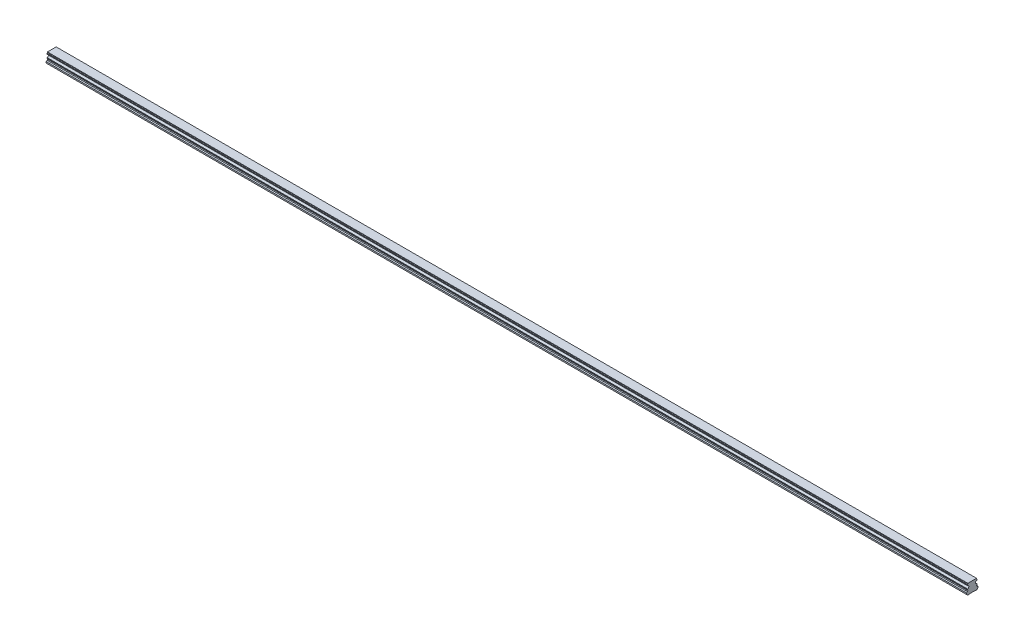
ISO-10303-21;
HEADER;
FILE_DESCRIPTION(('STEP AP214'),'2;1');
FILE_NAME('part.step','',(''),(''),'','','');
FILE_SCHEMA(('AUTOMOTIVE_DESIGN { 1 0 10303 214 1 1 1 1 }'));
ENDSEC;
DATA;
#1=APPLICATION_CONTEXT('core data for automotive mechanical design processes');
#2=APPLICATION_PROTOCOL_DEFINITION('international standard','automotive_design',2000,#1);
#3=PRODUCT_CONTEXT('',#1,'mechanical');
#4=PRODUCT('Part','Part','',(#3));
#5=PRODUCT_RELATED_PRODUCT_CATEGORY('part','',(#4));
#6=PRODUCT_DEFINITION_FORMATION('','',#4);
#7=PRODUCT_DEFINITION_CONTEXT('part definition',#1,'design');
#8=PRODUCT_DEFINITION('design','',#6,#7);
#9=PRODUCT_DEFINITION_SHAPE('','',#8);
#10=(LENGTH_UNIT() NAMED_UNIT(*) SI_UNIT(.MILLI.,.METRE.));
#11=(NAMED_UNIT(*) PLANE_ANGLE_UNIT() SI_UNIT($,.RADIAN.));
#12=(NAMED_UNIT(*) SI_UNIT($,.STERADIAN.) SOLID_ANGLE_UNIT());
#13=UNCERTAINTY_MEASURE_WITH_UNIT(LENGTH_MEASURE(1.E-05),#10,'distance_accuracy_value','');
#14=(GEOMETRIC_REPRESENTATION_CONTEXT(3) GLOBAL_UNCERTAINTY_ASSIGNED_CONTEXT((#13)) GLOBAL_UNIT_ASSIGNED_CONTEXT((#10,
#11,#12)) REPRESENTATION_CONTEXT('',''));
#15=CARTESIAN_POINT('',(0.,0.,0.));
#16=DIRECTION('',(0.,0.,1.));
#17=DIRECTION('',(1.,0.,0.));
#18=AXIS2_PLACEMENT_3D('',#15,#16,#17);
#19=CARTESIAN_POINT('',(1950.,0.499999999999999,0.));
#20=DIRECTION('',(0.,-1.,0.));
#21=DIRECTION('',(0.,0.,-1.));
#22=AXIS2_PLACEMENT_3D('',#19,#20,#21);
#23=CONICAL_SURFACE('',#22,3.5,0.785398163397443);
#24=CARTESIAN_POINT('',(1950.,1.00000000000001,0.));
#25=DIRECTION('',(0.,1.,0.));
#26=DIRECTION('',(0.,0.,1.));
#27=AXIS2_PLACEMENT_3D('',#24,#25,#26);
#28=CIRCLE('',#27,3.);
#29=CARTESIAN_POINT('',(1950.,1.00000000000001,3.));
#30=VERTEX_POINT('',#29);
#31=EDGE_CURVE('E11',#30,#30,#28,.F.);
#32=ORIENTED_EDGE('',*,*,#31,.F.);
#33=EDGE_LOOP('',(#32));
#34=FACE_BOUND('',#33,.T.);
#35=CARTESIAN_POINT('',(1950.,0.499999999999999,0.));
#36=DIRECTION('',(0.,1.,0.));
#37=DIRECTION('',(0.,0.,1.));
#38=AXIS2_PLACEMENT_3D('',#35,#36,#37);
#39=CIRCLE('',#38,3.5);
#40=CARTESIAN_POINT('',(1950.,0.5,3.5));
#41=VERTEX_POINT('',#40);
#42=EDGE_CURVE('E795',#41,#41,#39,.T.);
#43=ORIENTED_EDGE('',*,*,#42,.F.);
#44=EDGE_LOOP('',(#43));
#45=FACE_BOUND('',#44,.T.);
#46=ADVANCED_FACE('F39',(#34,#45),#23,.F.);
#47=CARTESIAN_POINT('',(1950.,12.,0.));
#48=DIRECTION('',(0.,-1.,0.));
#49=DIRECTION('',(0.,0.,-1.));
#50=AXIS2_PLACEMENT_3D('',#47,#48,#49);
#51=CYLINDRICAL_SURFACE('',#50,3.);
#52=ORIENTED_EDGE('',*,*,#31,.T.);
#53=EDGE_LOOP('',(#52));
#54=FACE_BOUND('',#53,.T.);
#55=CARTESIAN_POINT('',(1950.,12.,0.));
#56=DIRECTION('',(0.,-1.,0.));
#57=DIRECTION('',(0.,0.,-1.));
#58=AXIS2_PLACEMENT_3D('',#55,#56,#57);
#59=CIRCLE('',#58,3.);
#60=CARTESIAN_POINT('',(1950.,12.,-3.));
#61=VERTEX_POINT('',#60);
#62=EDGE_CURVE('E49',#61,#61,#59,.T.);
#63=ORIENTED_EDGE('',*,*,#62,.F.);
#64=EDGE_LOOP('',(#63));
#65=FACE_BOUND('',#64,.T.);
#66=ADVANCED_FACE('F1167',(#54,#65),#51,.F.);
#67=CARTESIAN_POINT('',(1950.,12.,0.));
#68=DIRECTION('',(0.,-1.,0.));
#69=DIRECTION('',(0.,0.,-1.));
#70=AXIS2_PLACEMENT_3D('',#67,#68,#69);
#71=PLANE('',#70);
#72=CARTESIAN_POINT('',(1950.,12.,0.));
#73=DIRECTION('',(0.,-1.,0.));
#74=DIRECTION('',(0.,0.,-1.));
#75=AXIS2_PLACEMENT_3D('',#72,#73,#74);
#76=CIRCLE('',#75,2.5);
#77=CARTESIAN_POINT('',(1950.,12.,-2.5));
#78=VERTEX_POINT('',#77);
#79=EDGE_CURVE('E42',#78,#78,#76,.T.);
#80=ORIENTED_EDGE('',*,*,#79,.F.);
#81=EDGE_LOOP('',(#80));
#82=FACE_BOUND('',#81,.T.);
#83=ORIENTED_EDGE('',*,*,#62,.T.);
#84=EDGE_LOOP('',(#83));
#85=FACE_BOUND('',#84,.T.);
#86=ADVANCED_FACE('F1172',(#82,#85),#71,.T.);
#87=CARTESIAN_POINT('',(1890.,0.499999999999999,0.));
#88=DIRECTION('',(0.,-1.,0.));
#89=DIRECTION('',(0.,0.,-1.));
#90=AXIS2_PLACEMENT_3D('',#87,#88,#89);
#91=CONICAL_SURFACE('',#90,3.5,0.785398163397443);
#92=CARTESIAN_POINT('',(1890.,1.00000000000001,0.));
#93=DIRECTION('',(0.,1.,0.));
#94=DIRECTION('',(0.,0.,1.));
#95=AXIS2_PLACEMENT_3D('',#92,#93,#94);
#96=CIRCLE('',#95,3.);
#97=CARTESIAN_POINT('',(1890.,1.00000000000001,3.));
#98=VERTEX_POINT('',#97);
#99=EDGE_CURVE('E791',#98,#98,#96,.F.);
#100=ORIENTED_EDGE('',*,*,#99,.F.);
#101=EDGE_LOOP('',(#100));
#102=FACE_BOUND('',#101,.T.);
#103=CARTESIAN_POINT('',(1890.,0.499999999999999,0.));
#104=DIRECTION('',(0.,1.,0.));
#105=DIRECTION('',(0.,0.,1.));
#106=AXIS2_PLACEMENT_3D('',#103,#104,#105);
#107=CIRCLE('',#106,3.5);
#108=CARTESIAN_POINT('',(1890.,0.5,3.5));
#109=VERTEX_POINT('',#108);
#110=EDGE_CURVE('E783',#109,#109,#107,.T.);
#111=ORIENTED_EDGE('',*,*,#110,.F.);
#112=EDGE_LOOP('',(#111));
#113=FACE_BOUND('',#112,.T.);
#114=ADVANCED_FACE('F1607',(#102,#113),#91,.F.);
#115=CARTESIAN_POINT('',(1890.,12.,0.));
#116=DIRECTION('',(0.,-1.,0.));
#117=DIRECTION('',(0.,0.,-1.));
#118=AXIS2_PLACEMENT_3D('',#115,#116,#117);
#119=CYLINDRICAL_SURFACE('',#118,3.);
#120=ORIENTED_EDGE('',*,*,#99,.T.);
#121=EDGE_LOOP('',(#120));
#122=FACE_BOUND('',#121,.T.);
#123=CARTESIAN_POINT('',(1890.,12.,0.));
#124=DIRECTION('',(0.,-1.,0.));
#125=DIRECTION('',(0.,0.,-1.));
#126=AXIS2_PLACEMENT_3D('',#123,#124,#125);
#127=CIRCLE('',#126,3.);
#128=CARTESIAN_POINT('',(1890.,12.,-3.));
#129=VERTEX_POINT('',#128);
#130=EDGE_CURVE('E787',#129,#129,#127,.T.);
#131=ORIENTED_EDGE('',*,*,#130,.F.);
#132=EDGE_LOOP('',(#131));
#133=FACE_BOUND('',#132,.T.);
#134=ADVANCED_FACE('F1603',(#122,#133),#119,.F.);
#135=CARTESIAN_POINT('',(1890.,12.,0.));
#136=DIRECTION('',(0.,-1.,0.));
#137=DIRECTION('',(0.,0.,-1.));
#138=AXIS2_PLACEMENT_3D('',#135,#136,#137);
#139=PLANE('',#138);
#140=CARTESIAN_POINT('',(1890.,12.,0.));
#141=DIRECTION('',(0.,-1.,0.));
#142=DIRECTION('',(0.,0.,-1.));
#143=AXIS2_PLACEMENT_3D('',#140,#141,#142);
#144=CIRCLE('',#143,2.5);
#145=CARTESIAN_POINT('',(1890.,12.,-2.5));
#146=VERTEX_POINT('',#145);
#147=EDGE_CURVE('E922',#146,#146,#144,.T.);
#148=ORIENTED_EDGE('',*,*,#147,.F.);
#149=EDGE_LOOP('',(#148));
#150=FACE_BOUND('',#149,.T.);
#151=ORIENTED_EDGE('',*,*,#130,.T.);
#152=EDGE_LOOP('',(#151));
#153=FACE_BOUND('',#152,.T.);
#154=ADVANCED_FACE('F1599',(#150,#153),#139,.T.);
#155=CARTESIAN_POINT('',(1830.,0.499999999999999,0.));
#156=DIRECTION('',(0.,-1.,0.));
#157=DIRECTION('',(0.,0.,-1.));
#158=AXIS2_PLACEMENT_3D('',#155,#156,#157);
#159=CONICAL_SURFACE('',#158,3.5,0.785398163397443);
#160=CARTESIAN_POINT('',(1830.,1.00000000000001,0.));
#161=DIRECTION('',(0.,1.,0.));
#162=DIRECTION('',(0.,0.,1.));
#163=AXIS2_PLACEMENT_3D('',#160,#161,#162);
#164=CIRCLE('',#163,3.);
#165=CARTESIAN_POINT('',(1830.,1.00000000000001,3.));
#166=VERTEX_POINT('',#165);
#167=EDGE_CURVE('E779',#166,#166,#164,.F.);
#168=ORIENTED_EDGE('',*,*,#167,.F.);
#169=EDGE_LOOP('',(#168));
#170=FACE_BOUND('',#169,.T.);
#171=CARTESIAN_POINT('',(1830.,0.499999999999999,0.));
#172=DIRECTION('',(0.,1.,0.));
#173=DIRECTION('',(0.,0.,1.));
#174=AXIS2_PLACEMENT_3D('',#171,#172,#173);
#175=CIRCLE('',#174,3.5);
#176=CARTESIAN_POINT('',(1830.,0.5,3.5));
#177=VERTEX_POINT('',#176);
#178=EDGE_CURVE('E771',#177,#177,#175,.T.);
#179=ORIENTED_EDGE('',*,*,#178,.F.);
#180=EDGE_LOOP('',(#179));
#181=FACE_BOUND('',#180,.T.);
#182=ADVANCED_FACE('F1595',(#170,#181),#159,.F.);
#183=CARTESIAN_POINT('',(1830.,12.,0.));
#184=DIRECTION('',(0.,-1.,0.));
#185=DIRECTION('',(0.,0.,-1.));
#186=AXIS2_PLACEMENT_3D('',#183,#184,#185);
#187=CYLINDRICAL_SURFACE('',#186,3.);
#188=ORIENTED_EDGE('',*,*,#167,.T.);
#189=EDGE_LOOP('',(#188));
#190=FACE_BOUND('',#189,.T.);
#191=CARTESIAN_POINT('',(1830.,12.,0.));
#192=DIRECTION('',(0.,-1.,0.));
#193=DIRECTION('',(0.,0.,-1.));
#194=AXIS2_PLACEMENT_3D('',#191,#192,#193);
#195=CIRCLE('',#194,3.);
#196=CARTESIAN_POINT('',(1830.,12.,-3.));
#197=VERTEX_POINT('',#196);
#198=EDGE_CURVE('E775',#197,#197,#195,.T.);
#199=ORIENTED_EDGE('',*,*,#198,.F.);
#200=EDGE_LOOP('',(#199));
#201=FACE_BOUND('',#200,.T.);
#202=ADVANCED_FACE('F1591',(#190,#201),#187,.F.);
#203=CARTESIAN_POINT('',(1830.,12.,0.));
#204=DIRECTION('',(0.,-1.,0.));
#205=DIRECTION('',(0.,0.,-1.));
#206=AXIS2_PLACEMENT_3D('',#203,#204,#205);
#207=PLANE('',#206);
#208=CARTESIAN_POINT('',(1830.,12.,0.));
#209=DIRECTION('',(0.,-1.,0.));
#210=DIRECTION('',(0.,0.,-1.));
#211=AXIS2_PLACEMENT_3D('',#208,#209,#210);
#212=CIRCLE('',#211,2.5);
#213=CARTESIAN_POINT('',(1830.,12.,-2.5));
#214=VERTEX_POINT('',#213);
#215=EDGE_CURVE('E919',#214,#214,#212,.T.);
#216=ORIENTED_EDGE('',*,*,#215,.F.);
#217=EDGE_LOOP('',(#216));
#218=FACE_BOUND('',#217,.T.);
#219=ORIENTED_EDGE('',*,*,#198,.T.);
#220=EDGE_LOOP('',(#219));
#221=FACE_BOUND('',#220,.T.);
#222=ADVANCED_FACE('F1587',(#218,#221),#207,.T.);
#223=CARTESIAN_POINT('',(1770.,0.499999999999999,0.));
#224=DIRECTION('',(0.,-1.,0.));
#225=DIRECTION('',(0.,0.,-1.));
#226=AXIS2_PLACEMENT_3D('',#223,#224,#225);
#227=CONICAL_SURFACE('',#226,3.5,0.785398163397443);
#228=CARTESIAN_POINT('',(1770.,1.00000000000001,0.));
#229=DIRECTION('',(0.,1.,0.));
#230=DIRECTION('',(0.,0.,1.));
#231=AXIS2_PLACEMENT_3D('',#228,#229,#230);
#232=CIRCLE('',#231,3.);
#233=CARTESIAN_POINT('',(1770.,1.00000000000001,3.));
#234=VERTEX_POINT('',#233);
#235=EDGE_CURVE('E767',#234,#234,#232,.F.);
#236=ORIENTED_EDGE('',*,*,#235,.F.);
#237=EDGE_LOOP('',(#236));
#238=FACE_BOUND('',#237,.T.);
#239=CARTESIAN_POINT('',(1770.,0.499999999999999,0.));
#240=DIRECTION('',(0.,1.,0.));
#241=DIRECTION('',(0.,0.,1.));
#242=AXIS2_PLACEMENT_3D('',#239,#240,#241);
#243=CIRCLE('',#242,3.5);
#244=CARTESIAN_POINT('',(1770.,0.5,3.5));
#245=VERTEX_POINT('',#244);
#246=EDGE_CURVE('E759',#245,#245,#243,.T.);
#247=ORIENTED_EDGE('',*,*,#246,.F.);
#248=EDGE_LOOP('',(#247));
#249=FACE_BOUND('',#248,.T.);
#250=ADVANCED_FACE('F1583',(#238,#249),#227,.F.);
#251=CARTESIAN_POINT('',(1770.,12.,0.));
#252=DIRECTION('',(0.,-1.,0.));
#253=DIRECTION('',(0.,0.,-1.));
#254=AXIS2_PLACEMENT_3D('',#251,#252,#253);
#255=CYLINDRICAL_SURFACE('',#254,3.);
#256=ORIENTED_EDGE('',*,*,#235,.T.);
#257=EDGE_LOOP('',(#256));
#258=FACE_BOUND('',#257,.T.);
#259=CARTESIAN_POINT('',(1770.,12.,0.));
#260=DIRECTION('',(0.,-1.,0.));
#261=DIRECTION('',(0.,0.,-1.));
#262=AXIS2_PLACEMENT_3D('',#259,#260,#261);
#263=CIRCLE('',#262,3.);
#264=CARTESIAN_POINT('',(1770.,12.,-3.));
#265=VERTEX_POINT('',#264);
#266=EDGE_CURVE('E763',#265,#265,#263,.T.);
#267=ORIENTED_EDGE('',*,*,#266,.F.);
#268=EDGE_LOOP('',(#267));
#269=FACE_BOUND('',#268,.T.);
#270=ADVANCED_FACE('F1579',(#258,#269),#255,.F.);
#271=CARTESIAN_POINT('',(1770.,12.,0.));
#272=DIRECTION('',(0.,-1.,0.));
#273=DIRECTION('',(0.,0.,-1.));
#274=AXIS2_PLACEMENT_3D('',#271,#272,#273);
#275=PLANE('',#274);
#276=CARTESIAN_POINT('',(1770.,12.,0.));
#277=DIRECTION('',(0.,-1.,0.));
#278=DIRECTION('',(0.,0.,-1.));
#279=AXIS2_PLACEMENT_3D('',#276,#277,#278);
#280=CIRCLE('',#279,2.5);
#281=CARTESIAN_POINT('',(1770.,12.,-2.5));
#282=VERTEX_POINT('',#281);
#283=EDGE_CURVE('E915',#282,#282,#280,.T.);
#284=ORIENTED_EDGE('',*,*,#283,.F.);
#285=EDGE_LOOP('',(#284));
#286=FACE_BOUND('',#285,.T.);
#287=ORIENTED_EDGE('',*,*,#266,.T.);
#288=EDGE_LOOP('',(#287));
#289=FACE_BOUND('',#288,.T.);
#290=ADVANCED_FACE('F1575',(#286,#289),#275,.T.);
#291=CARTESIAN_POINT('',(1710.,0.499999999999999,0.));
#292=DIRECTION('',(0.,-1.,0.));
#293=DIRECTION('',(0.,0.,-1.));
#294=AXIS2_PLACEMENT_3D('',#291,#292,#293);
#295=CONICAL_SURFACE('',#294,3.5,0.785398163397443);
#296=CARTESIAN_POINT('',(1710.,1.00000000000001,0.));
#297=DIRECTION('',(0.,1.,0.));
#298=DIRECTION('',(0.,0.,1.));
#299=AXIS2_PLACEMENT_3D('',#296,#297,#298);
#300=CIRCLE('',#299,3.);
#301=CARTESIAN_POINT('',(1710.,1.00000000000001,3.));
#302=VERTEX_POINT('',#301);
#303=EDGE_CURVE('E755',#302,#302,#300,.F.);
#304=ORIENTED_EDGE('',*,*,#303,.F.);
#305=EDGE_LOOP('',(#304));
#306=FACE_BOUND('',#305,.T.);
#307=CARTESIAN_POINT('',(1710.,0.499999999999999,0.));
#308=DIRECTION('',(0.,1.,0.));
#309=DIRECTION('',(0.,0.,1.));
#310=AXIS2_PLACEMENT_3D('',#307,#308,#309);
#311=CIRCLE('',#310,3.5);
#312=CARTESIAN_POINT('',(1710.,0.5,3.5));
#313=VERTEX_POINT('',#312);
#314=EDGE_CURVE('E747',#313,#313,#311,.T.);
#315=ORIENTED_EDGE('',*,*,#314,.F.);
#316=EDGE_LOOP('',(#315));
#317=FACE_BOUND('',#316,.T.);
#318=ADVANCED_FACE('F1571',(#306,#317),#295,.F.);
#319=CARTESIAN_POINT('',(1710.,12.,0.));
#320=DIRECTION('',(0.,-1.,0.));
#321=DIRECTION('',(0.,0.,-1.));
#322=AXIS2_PLACEMENT_3D('',#319,#320,#321);
#323=CYLINDRICAL_SURFACE('',#322,3.);
#324=ORIENTED_EDGE('',*,*,#303,.T.);
#325=EDGE_LOOP('',(#324));
#326=FACE_BOUND('',#325,.T.);
#327=CARTESIAN_POINT('',(1710.,12.,0.));
#328=DIRECTION('',(0.,-1.,0.));
#329=DIRECTION('',(0.,0.,-1.));
#330=AXIS2_PLACEMENT_3D('',#327,#328,#329);
#331=CIRCLE('',#330,3.);
#332=CARTESIAN_POINT('',(1710.,12.,-3.));
#333=VERTEX_POINT('',#332);
#334=EDGE_CURVE('E751',#333,#333,#331,.T.);
#335=ORIENTED_EDGE('',*,*,#334,.F.);
#336=EDGE_LOOP('',(#335));
#337=FACE_BOUND('',#336,.T.);
#338=ADVANCED_FACE('F1567',(#326,#337),#323,.F.);
#339=CARTESIAN_POINT('',(1710.,12.,0.));
#340=DIRECTION('',(0.,-1.,0.));
#341=DIRECTION('',(0.,0.,-1.));
#342=AXIS2_PLACEMENT_3D('',#339,#340,#341);
#343=PLANE('',#342);
#344=CARTESIAN_POINT('',(1710.,12.,0.));
#345=DIRECTION('',(0.,-1.,0.));
#346=DIRECTION('',(0.,0.,-1.));
#347=AXIS2_PLACEMENT_3D('',#344,#345,#346);
#348=CIRCLE('',#347,2.5);
#349=CARTESIAN_POINT('',(1710.,12.,-2.5));
#350=VERTEX_POINT('',#349);
#351=EDGE_CURVE('E911',#350,#350,#348,.T.);
#352=ORIENTED_EDGE('',*,*,#351,.F.);
#353=EDGE_LOOP('',(#352));
#354=FACE_BOUND('',#353,.T.);
#355=ORIENTED_EDGE('',*,*,#334,.T.);
#356=EDGE_LOOP('',(#355));
#357=FACE_BOUND('',#356,.T.);
#358=ADVANCED_FACE('F1563',(#354,#357),#343,.T.);
#359=CARTESIAN_POINT('',(1650.,0.499999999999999,0.));
#360=DIRECTION('',(0.,-1.,0.));
#361=DIRECTION('',(0.,0.,-1.));
#362=AXIS2_PLACEMENT_3D('',#359,#360,#361);
#363=CONICAL_SURFACE('',#362,3.5,0.785398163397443);
#364=CARTESIAN_POINT('',(1650.,1.00000000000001,0.));
#365=DIRECTION('',(0.,1.,0.));
#366=DIRECTION('',(0.,0.,1.));
#367=AXIS2_PLACEMENT_3D('',#364,#365,#366);
#368=CIRCLE('',#367,3.);
#369=CARTESIAN_POINT('',(1650.,1.00000000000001,3.));
#370=VERTEX_POINT('',#369);
#371=EDGE_CURVE('E743',#370,#370,#368,.F.);
#372=ORIENTED_EDGE('',*,*,#371,.F.);
#373=EDGE_LOOP('',(#372));
#374=FACE_BOUND('',#373,.T.);
#375=CARTESIAN_POINT('',(1650.,0.499999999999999,0.));
#376=DIRECTION('',(0.,1.,0.));
#377=DIRECTION('',(0.,0.,1.));
#378=AXIS2_PLACEMENT_3D('',#375,#376,#377);
#379=CIRCLE('',#378,3.5);
#380=CARTESIAN_POINT('',(1650.,0.5,3.5));
#381=VERTEX_POINT('',#380);
#382=EDGE_CURVE('E735',#381,#381,#379,.T.);
#383=ORIENTED_EDGE('',*,*,#382,.F.);
#384=EDGE_LOOP('',(#383));
#385=FACE_BOUND('',#384,.T.);
#386=ADVANCED_FACE('F1559',(#374,#385),#363,.F.);
#387=CARTESIAN_POINT('',(1650.,12.,0.));
#388=DIRECTION('',(0.,-1.,0.));
#389=DIRECTION('',(0.,0.,-1.));
#390=AXIS2_PLACEMENT_3D('',#387,#388,#389);
#391=CYLINDRICAL_SURFACE('',#390,3.);
#392=ORIENTED_EDGE('',*,*,#371,.T.);
#393=EDGE_LOOP('',(#392));
#394=FACE_BOUND('',#393,.T.);
#395=CARTESIAN_POINT('',(1650.,12.,0.));
#396=DIRECTION('',(0.,-1.,0.));
#397=DIRECTION('',(0.,0.,-1.));
#398=AXIS2_PLACEMENT_3D('',#395,#396,#397);
#399=CIRCLE('',#398,3.);
#400=CARTESIAN_POINT('',(1650.,12.,-3.));
#401=VERTEX_POINT('',#400);
#402=EDGE_CURVE('E739',#401,#401,#399,.T.);
#403=ORIENTED_EDGE('',*,*,#402,.F.);
#404=EDGE_LOOP('',(#403));
#405=FACE_BOUND('',#404,.T.);
#406=ADVANCED_FACE('F1555',(#394,#405),#391,.F.);
#407=CARTESIAN_POINT('',(1650.,12.,0.));
#408=DIRECTION('',(0.,-1.,0.));
#409=DIRECTION('',(0.,0.,-1.));
#410=AXIS2_PLACEMENT_3D('',#407,#408,#409);
#411=PLANE('',#410);
#412=CARTESIAN_POINT('',(1650.,12.,0.));
#413=DIRECTION('',(0.,-1.,0.));
#414=DIRECTION('',(0.,0.,-1.));
#415=AXIS2_PLACEMENT_3D('',#412,#413,#414);
#416=CIRCLE('',#415,2.5);
#417=CARTESIAN_POINT('',(1650.,12.,-2.5));
#418=VERTEX_POINT('',#417);
#419=EDGE_CURVE('E907',#418,#418,#416,.T.);
#420=ORIENTED_EDGE('',*,*,#419,.F.);
#421=EDGE_LOOP('',(#420));
#422=FACE_BOUND('',#421,.T.);
#423=ORIENTED_EDGE('',*,*,#402,.T.);
#424=EDGE_LOOP('',(#423));
#425=FACE_BOUND('',#424,.T.);
#426=ADVANCED_FACE('F1551',(#422,#425),#411,.T.);
#427=CARTESIAN_POINT('',(1590.,0.499999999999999,0.));
#428=DIRECTION('',(0.,-1.,0.));
#429=DIRECTION('',(0.,0.,-1.));
#430=AXIS2_PLACEMENT_3D('',#427,#428,#429);
#431=CONICAL_SURFACE('',#430,3.5,0.785398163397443);
#432=CARTESIAN_POINT('',(1590.,1.00000000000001,0.));
#433=DIRECTION('',(0.,1.,0.));
#434=DIRECTION('',(0.,0.,1.));
#435=AXIS2_PLACEMENT_3D('',#432,#433,#434);
#436=CIRCLE('',#435,3.);
#437=CARTESIAN_POINT('',(1590.,1.00000000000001,3.));
#438=VERTEX_POINT('',#437);
#439=EDGE_CURVE('E731',#438,#438,#436,.F.);
#440=ORIENTED_EDGE('',*,*,#439,.F.);
#441=EDGE_LOOP('',(#440));
#442=FACE_BOUND('',#441,.T.);
#443=CARTESIAN_POINT('',(1590.,0.499999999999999,0.));
#444=DIRECTION('',(0.,1.,0.));
#445=DIRECTION('',(0.,0.,1.));
#446=AXIS2_PLACEMENT_3D('',#443,#444,#445);
#447=CIRCLE('',#446,3.5);
#448=CARTESIAN_POINT('',(1590.,0.5,3.5));
#449=VERTEX_POINT('',#448);
#450=EDGE_CURVE('E723',#449,#449,#447,.T.);
#451=ORIENTED_EDGE('',*,*,#450,.F.);
#452=EDGE_LOOP('',(#451));
#453=FACE_BOUND('',#452,.T.);
#454=ADVANCED_FACE('F1547',(#442,#453),#431,.F.);
#455=CARTESIAN_POINT('',(1590.,12.,0.));
#456=DIRECTION('',(0.,-1.,0.));
#457=DIRECTION('',(0.,0.,-1.));
#458=AXIS2_PLACEMENT_3D('',#455,#456,#457);
#459=CYLINDRICAL_SURFACE('',#458,3.);
#460=ORIENTED_EDGE('',*,*,#439,.T.);
#461=EDGE_LOOP('',(#460));
#462=FACE_BOUND('',#461,.T.);
#463=CARTESIAN_POINT('',(1590.,12.,0.));
#464=DIRECTION('',(0.,-1.,0.));
#465=DIRECTION('',(0.,0.,-1.));
#466=AXIS2_PLACEMENT_3D('',#463,#464,#465);
#467=CIRCLE('',#466,3.);
#468=CARTESIAN_POINT('',(1590.,12.,-3.));
#469=VERTEX_POINT('',#468);
#470=EDGE_CURVE('E727',#469,#469,#467,.T.);
#471=ORIENTED_EDGE('',*,*,#470,.F.);
#472=EDGE_LOOP('',(#471));
#473=FACE_BOUND('',#472,.T.);
#474=ADVANCED_FACE('F1543',(#462,#473),#459,.F.);
#475=CARTESIAN_POINT('',(1590.,12.,0.));
#476=DIRECTION('',(0.,-1.,0.));
#477=DIRECTION('',(0.,0.,-1.));
#478=AXIS2_PLACEMENT_3D('',#475,#476,#477);
#479=PLANE('',#478);
#480=CARTESIAN_POINT('',(1590.,12.,0.));
#481=DIRECTION('',(0.,-1.,0.));
#482=DIRECTION('',(0.,0.,-1.));
#483=AXIS2_PLACEMENT_3D('',#480,#481,#482);
#484=CIRCLE('',#483,2.5);
#485=CARTESIAN_POINT('',(1590.,12.,-2.5));
#486=VERTEX_POINT('',#485);
#487=EDGE_CURVE('E903',#486,#486,#484,.T.);
#488=ORIENTED_EDGE('',*,*,#487,.F.);
#489=EDGE_LOOP('',(#488));
#490=FACE_BOUND('',#489,.T.);
#491=ORIENTED_EDGE('',*,*,#470,.T.);
#492=EDGE_LOOP('',(#491));
#493=FACE_BOUND('',#492,.T.);
#494=ADVANCED_FACE('F1539',(#490,#493),#479,.T.);
#495=CARTESIAN_POINT('',(1530.,0.499999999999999,0.));
#496=DIRECTION('',(0.,-1.,0.));
#497=DIRECTION('',(0.,0.,-1.));
#498=AXIS2_PLACEMENT_3D('',#495,#496,#497);
#499=CONICAL_SURFACE('',#498,3.5,0.785398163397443);
#500=CARTESIAN_POINT('',(1530.,1.00000000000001,0.));
#501=DIRECTION('',(0.,1.,0.));
#502=DIRECTION('',(0.,0.,1.));
#503=AXIS2_PLACEMENT_3D('',#500,#501,#502);
#504=CIRCLE('',#503,3.);
#505=CARTESIAN_POINT('',(1530.,1.00000000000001,3.));
#506=VERTEX_POINT('',#505);
#507=EDGE_CURVE('E719',#506,#506,#504,.F.);
#508=ORIENTED_EDGE('',*,*,#507,.F.);
#509=EDGE_LOOP('',(#508));
#510=FACE_BOUND('',#509,.T.);
#511=CARTESIAN_POINT('',(1530.,0.499999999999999,0.));
#512=DIRECTION('',(0.,1.,0.));
#513=DIRECTION('',(0.,0.,1.));
#514=AXIS2_PLACEMENT_3D('',#511,#512,#513);
#515=CIRCLE('',#514,3.5);
#516=CARTESIAN_POINT('',(1530.,0.5,3.5));
#517=VERTEX_POINT('',#516);
#518=EDGE_CURVE('E711',#517,#517,#515,.T.);
#519=ORIENTED_EDGE('',*,*,#518,.F.);
#520=EDGE_LOOP('',(#519));
#521=FACE_BOUND('',#520,.T.);
#522=ADVANCED_FACE('F1535',(#510,#521),#499,.F.);
#523=CARTESIAN_POINT('',(1530.,12.,0.));
#524=DIRECTION('',(0.,-1.,0.));
#525=DIRECTION('',(0.,0.,-1.));
#526=AXIS2_PLACEMENT_3D('',#523,#524,#525);
#527=CYLINDRICAL_SURFACE('',#526,3.);
#528=ORIENTED_EDGE('',*,*,#507,.T.);
#529=EDGE_LOOP('',(#528));
#530=FACE_BOUND('',#529,.T.);
#531=CARTESIAN_POINT('',(1530.,12.,0.));
#532=DIRECTION('',(0.,-1.,0.));
#533=DIRECTION('',(0.,0.,-1.));
#534=AXIS2_PLACEMENT_3D('',#531,#532,#533);
#535=CIRCLE('',#534,3.);
#536=CARTESIAN_POINT('',(1530.,12.,-3.));
#537=VERTEX_POINT('',#536);
#538=EDGE_CURVE('E715',#537,#537,#535,.T.);
#539=ORIENTED_EDGE('',*,*,#538,.F.);
#540=EDGE_LOOP('',(#539));
#541=FACE_BOUND('',#540,.T.);
#542=ADVANCED_FACE('F1531',(#530,#541),#527,.F.);
#543=CARTESIAN_POINT('',(1530.,12.,0.));
#544=DIRECTION('',(0.,-1.,0.));
#545=DIRECTION('',(0.,0.,-1.));
#546=AXIS2_PLACEMENT_3D('',#543,#544,#545);
#547=PLANE('',#546);
#548=CARTESIAN_POINT('',(1530.,12.,0.));
#549=DIRECTION('',(0.,-1.,0.));
#550=DIRECTION('',(0.,0.,-1.));
#551=AXIS2_PLACEMENT_3D('',#548,#549,#550);
#552=CIRCLE('',#551,2.5);
#553=CARTESIAN_POINT('',(1530.,12.,-2.5));
#554=VERTEX_POINT('',#553);
#555=EDGE_CURVE('E899',#554,#554,#552,.T.);
#556=ORIENTED_EDGE('',*,*,#555,.F.);
#557=EDGE_LOOP('',(#556));
#558=FACE_BOUND('',#557,.T.);
#559=ORIENTED_EDGE('',*,*,#538,.T.);
#560=EDGE_LOOP('',(#559));
#561=FACE_BOUND('',#560,.T.);
#562=ADVANCED_FACE('F1527',(#558,#561),#547,.T.);
#563=CARTESIAN_POINT('',(1470.,0.499999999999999,0.));
#564=DIRECTION('',(0.,-1.,0.));
#565=DIRECTION('',(0.,0.,-1.));
#566=AXIS2_PLACEMENT_3D('',#563,#564,#565);
#567=CONICAL_SURFACE('',#566,3.5,0.785398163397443);
#568=CARTESIAN_POINT('',(1470.,1.00000000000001,0.));
#569=DIRECTION('',(0.,1.,0.));
#570=DIRECTION('',(0.,0.,1.));
#571=AXIS2_PLACEMENT_3D('',#568,#569,#570);
#572=CIRCLE('',#571,3.);
#573=CARTESIAN_POINT('',(1470.,1.00000000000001,3.));
#574=VERTEX_POINT('',#573);
#575=EDGE_CURVE('E707',#574,#574,#572,.F.);
#576=ORIENTED_EDGE('',*,*,#575,.F.);
#577=EDGE_LOOP('',(#576));
#578=FACE_BOUND('',#577,.T.);
#579=CARTESIAN_POINT('',(1470.,0.499999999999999,0.));
#580=DIRECTION('',(0.,1.,0.));
#581=DIRECTION('',(0.,0.,1.));
#582=AXIS2_PLACEMENT_3D('',#579,#580,#581);
#583=CIRCLE('',#582,3.5);
#584=CARTESIAN_POINT('',(1470.,0.5,3.5));
#585=VERTEX_POINT('',#584);
#586=EDGE_CURVE('E699',#585,#585,#583,.T.);
#587=ORIENTED_EDGE('',*,*,#586,.F.);
#588=EDGE_LOOP('',(#587));
#589=FACE_BOUND('',#588,.T.);
#590=ADVANCED_FACE('F1523',(#578,#589),#567,.F.);
#591=CARTESIAN_POINT('',(1470.,12.,0.));
#592=DIRECTION('',(0.,-1.,0.));
#593=DIRECTION('',(0.,0.,-1.));
#594=AXIS2_PLACEMENT_3D('',#591,#592,#593);
#595=CYLINDRICAL_SURFACE('',#594,3.);
#596=ORIENTED_EDGE('',*,*,#575,.T.);
#597=EDGE_LOOP('',(#596));
#598=FACE_BOUND('',#597,.T.);
#599=CARTESIAN_POINT('',(1470.,12.,0.));
#600=DIRECTION('',(0.,-1.,0.));
#601=DIRECTION('',(0.,0.,-1.));
#602=AXIS2_PLACEMENT_3D('',#599,#600,#601);
#603=CIRCLE('',#602,3.);
#604=CARTESIAN_POINT('',(1470.,12.,-3.));
#605=VERTEX_POINT('',#604);
#606=EDGE_CURVE('E703',#605,#605,#603,.T.);
#607=ORIENTED_EDGE('',*,*,#606,.F.);
#608=EDGE_LOOP('',(#607));
#609=FACE_BOUND('',#608,.T.);
#610=ADVANCED_FACE('F1519',(#598,#609),#595,.F.);
#611=CARTESIAN_POINT('',(1470.,12.,0.));
#612=DIRECTION('',(0.,-1.,0.));
#613=DIRECTION('',(0.,0.,-1.));
#614=AXIS2_PLACEMENT_3D('',#611,#612,#613);
#615=PLANE('',#614);
#616=CARTESIAN_POINT('',(1470.,12.,0.));
#617=DIRECTION('',(0.,-1.,0.));
#618=DIRECTION('',(0.,0.,-1.));
#619=AXIS2_PLACEMENT_3D('',#616,#617,#618);
#620=CIRCLE('',#619,2.5);
#621=CARTESIAN_POINT('',(1470.,12.,-2.5));
#622=VERTEX_POINT('',#621);
#623=EDGE_CURVE('E895',#622,#622,#620,.T.);
#624=ORIENTED_EDGE('',*,*,#623,.F.);
#625=EDGE_LOOP('',(#624));
#626=FACE_BOUND('',#625,.T.);
#627=ORIENTED_EDGE('',*,*,#606,.T.);
#628=EDGE_LOOP('',(#627));
#629=FACE_BOUND('',#628,.T.);
#630=ADVANCED_FACE('F1515',(#626,#629),#615,.T.);
#631=CARTESIAN_POINT('',(1410.,0.499999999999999,0.));
#632=DIRECTION('',(0.,-1.,0.));
#633=DIRECTION('',(0.,0.,-1.));
#634=AXIS2_PLACEMENT_3D('',#631,#632,#633);
#635=CONICAL_SURFACE('',#634,3.5,0.785398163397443);
#636=CARTESIAN_POINT('',(1410.,1.00000000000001,0.));
#637=DIRECTION('',(0.,1.,0.));
#638=DIRECTION('',(0.,0.,1.));
#639=AXIS2_PLACEMENT_3D('',#636,#637,#638);
#640=CIRCLE('',#639,3.);
#641=CARTESIAN_POINT('',(1410.,1.00000000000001,3.));
#642=VERTEX_POINT('',#641);
#643=EDGE_CURVE('E695',#642,#642,#640,.F.);
#644=ORIENTED_EDGE('',*,*,#643,.F.);
#645=EDGE_LOOP('',(#644));
#646=FACE_BOUND('',#645,.T.);
#647=CARTESIAN_POINT('',(1410.,0.499999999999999,0.));
#648=DIRECTION('',(0.,1.,0.));
#649=DIRECTION('',(0.,0.,1.));
#650=AXIS2_PLACEMENT_3D('',#647,#648,#649);
#651=CIRCLE('',#650,3.5);
#652=CARTESIAN_POINT('',(1410.,0.5,3.5));
#653=VERTEX_POINT('',#652);
#654=EDGE_CURVE('E687',#653,#653,#651,.T.);
#655=ORIENTED_EDGE('',*,*,#654,.F.);
#656=EDGE_LOOP('',(#655));
#657=FACE_BOUND('',#656,.T.);
#658=ADVANCED_FACE('F1511',(#646,#657),#635,.F.);
#659=CARTESIAN_POINT('',(1410.,12.,0.));
#660=DIRECTION('',(0.,-1.,0.));
#661=DIRECTION('',(0.,0.,-1.));
#662=AXIS2_PLACEMENT_3D('',#659,#660,#661);
#663=CYLINDRICAL_SURFACE('',#662,3.);
#664=ORIENTED_EDGE('',*,*,#643,.T.);
#665=EDGE_LOOP('',(#664));
#666=FACE_BOUND('',#665,.T.);
#667=CARTESIAN_POINT('',(1410.,12.,0.));
#668=DIRECTION('',(0.,-1.,0.));
#669=DIRECTION('',(0.,0.,-1.));
#670=AXIS2_PLACEMENT_3D('',#667,#668,#669);
#671=CIRCLE('',#670,3.);
#672=CARTESIAN_POINT('',(1410.,12.,-3.));
#673=VERTEX_POINT('',#672);
#674=EDGE_CURVE('E691',#673,#673,#671,.T.);
#675=ORIENTED_EDGE('',*,*,#674,.F.);
#676=EDGE_LOOP('',(#675));
#677=FACE_BOUND('',#676,.T.);
#678=ADVANCED_FACE('F1507',(#666,#677),#663,.F.);
#679=CARTESIAN_POINT('',(1410.,12.,0.));
#680=DIRECTION('',(0.,-1.,0.));
#681=DIRECTION('',(0.,0.,-1.));
#682=AXIS2_PLACEMENT_3D('',#679,#680,#681);
#683=PLANE('',#682);
#684=CARTESIAN_POINT('',(1410.,12.,0.));
#685=DIRECTION('',(0.,-1.,0.));
#686=DIRECTION('',(0.,0.,-1.));
#687=AXIS2_PLACEMENT_3D('',#684,#685,#686);
#688=CIRCLE('',#687,2.5);
#689=CARTESIAN_POINT('',(1410.,12.,-2.5));
#690=VERTEX_POINT('',#689);
#691=EDGE_CURVE('E891',#690,#690,#688,.T.);
#692=ORIENTED_EDGE('',*,*,#691,.F.);
#693=EDGE_LOOP('',(#692));
#694=FACE_BOUND('',#693,.T.);
#695=ORIENTED_EDGE('',*,*,#674,.T.);
#696=EDGE_LOOP('',(#695));
#697=FACE_BOUND('',#696,.T.);
#698=ADVANCED_FACE('F1503',(#694,#697),#683,.T.);
#699=CARTESIAN_POINT('',(1350.,0.499999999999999,0.));
#700=DIRECTION('',(0.,-1.,0.));
#701=DIRECTION('',(0.,0.,-1.));
#702=AXIS2_PLACEMENT_3D('',#699,#700,#701);
#703=CONICAL_SURFACE('',#702,3.5,0.785398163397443);
#704=CARTESIAN_POINT('',(1350.,1.00000000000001,0.));
#705=DIRECTION('',(0.,1.,0.));
#706=DIRECTION('',(0.,0.,1.));
#707=AXIS2_PLACEMENT_3D('',#704,#705,#706);
#708=CIRCLE('',#707,3.);
#709=CARTESIAN_POINT('',(1350.,1.00000000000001,3.));
#710=VERTEX_POINT('',#709);
#711=EDGE_CURVE('E683',#710,#710,#708,.F.);
#712=ORIENTED_EDGE('',*,*,#711,.F.);
#713=EDGE_LOOP('',(#712));
#714=FACE_BOUND('',#713,.T.);
#715=CARTESIAN_POINT('',(1350.,0.499999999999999,0.));
#716=DIRECTION('',(0.,1.,0.));
#717=DIRECTION('',(0.,0.,1.));
#718=AXIS2_PLACEMENT_3D('',#715,#716,#717);
#719=CIRCLE('',#718,3.5);
#720=CARTESIAN_POINT('',(1350.,0.5,3.5));
#721=VERTEX_POINT('',#720);
#722=EDGE_CURVE('E675',#721,#721,#719,.T.);
#723=ORIENTED_EDGE('',*,*,#722,.F.);
#724=EDGE_LOOP('',(#723));
#725=FACE_BOUND('',#724,.T.);
#726=ADVANCED_FACE('F1499',(#714,#725),#703,.F.);
#727=CARTESIAN_POINT('',(1350.,12.,0.));
#728=DIRECTION('',(0.,-1.,0.));
#729=DIRECTION('',(0.,0.,-1.));
#730=AXIS2_PLACEMENT_3D('',#727,#728,#729);
#731=CYLINDRICAL_SURFACE('',#730,3.);
#732=ORIENTED_EDGE('',*,*,#711,.T.);
#733=EDGE_LOOP('',(#732));
#734=FACE_BOUND('',#733,.T.);
#735=CARTESIAN_POINT('',(1350.,12.,0.));
#736=DIRECTION('',(0.,-1.,0.));
#737=DIRECTION('',(0.,0.,-1.));
#738=AXIS2_PLACEMENT_3D('',#735,#736,#737);
#739=CIRCLE('',#738,3.);
#740=CARTESIAN_POINT('',(1350.,12.,-3.));
#741=VERTEX_POINT('',#740);
#742=EDGE_CURVE('E679',#741,#741,#739,.T.);
#743=ORIENTED_EDGE('',*,*,#742,.F.);
#744=EDGE_LOOP('',(#743));
#745=FACE_BOUND('',#744,.T.);
#746=ADVANCED_FACE('F1495',(#734,#745),#731,.F.);
#747=CARTESIAN_POINT('',(1350.,12.,0.));
#748=DIRECTION('',(0.,-1.,0.));
#749=DIRECTION('',(0.,0.,-1.));
#750=AXIS2_PLACEMENT_3D('',#747,#748,#749);
#751=PLANE('',#750);
#752=CARTESIAN_POINT('',(1350.,12.,0.));
#753=DIRECTION('',(0.,-1.,0.));
#754=DIRECTION('',(0.,0.,-1.));
#755=AXIS2_PLACEMENT_3D('',#752,#753,#754);
#756=CIRCLE('',#755,2.5);
#757=CARTESIAN_POINT('',(1350.,12.,-2.5));
#758=VERTEX_POINT('',#757);
#759=EDGE_CURVE('E887',#758,#758,#756,.T.);
#760=ORIENTED_EDGE('',*,*,#759,.F.);
#761=EDGE_LOOP('',(#760));
#762=FACE_BOUND('',#761,.T.);
#763=ORIENTED_EDGE('',*,*,#742,.T.);
#764=EDGE_LOOP('',(#763));
#765=FACE_BOUND('',#764,.T.);
#766=ADVANCED_FACE('F1491',(#762,#765),#751,.T.);
#767=CARTESIAN_POINT('',(1290.,0.499999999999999,0.));
#768=DIRECTION('',(0.,-1.,0.));
#769=DIRECTION('',(0.,0.,-1.));
#770=AXIS2_PLACEMENT_3D('',#767,#768,#769);
#771=CONICAL_SURFACE('',#770,3.5,0.785398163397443);
#772=CARTESIAN_POINT('',(1290.,1.00000000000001,0.));
#773=DIRECTION('',(0.,1.,0.));
#774=DIRECTION('',(0.,0.,1.));
#775=AXIS2_PLACEMENT_3D('',#772,#773,#774);
#776=CIRCLE('',#775,3.);
#777=CARTESIAN_POINT('',(1290.,1.00000000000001,3.));
#778=VERTEX_POINT('',#777);
#779=EDGE_CURVE('E671',#778,#778,#776,.F.);
#780=ORIENTED_EDGE('',*,*,#779,.F.);
#781=EDGE_LOOP('',(#780));
#782=FACE_BOUND('',#781,.T.);
#783=CARTESIAN_POINT('',(1290.,0.499999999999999,0.));
#784=DIRECTION('',(0.,1.,0.));
#785=DIRECTION('',(0.,0.,1.));
#786=AXIS2_PLACEMENT_3D('',#783,#784,#785);
#787=CIRCLE('',#786,3.5);
#788=CARTESIAN_POINT('',(1290.,0.5,3.5));
#789=VERTEX_POINT('',#788);
#790=EDGE_CURVE('E663',#789,#789,#787,.T.);
#791=ORIENTED_EDGE('',*,*,#790,.F.);
#792=EDGE_LOOP('',(#791));
#793=FACE_BOUND('',#792,.T.);
#794=ADVANCED_FACE('F1487',(#782,#793),#771,.F.);
#795=CARTESIAN_POINT('',(1290.,12.,0.));
#796=DIRECTION('',(0.,-1.,0.));
#797=DIRECTION('',(0.,0.,-1.));
#798=AXIS2_PLACEMENT_3D('',#795,#796,#797);
#799=CYLINDRICAL_SURFACE('',#798,3.);
#800=ORIENTED_EDGE('',*,*,#779,.T.);
#801=EDGE_LOOP('',(#800));
#802=FACE_BOUND('',#801,.T.);
#803=CARTESIAN_POINT('',(1290.,12.,0.));
#804=DIRECTION('',(0.,-1.,0.));
#805=DIRECTION('',(0.,0.,-1.));
#806=AXIS2_PLACEMENT_3D('',#803,#804,#805);
#807=CIRCLE('',#806,3.);
#808=CARTESIAN_POINT('',(1290.,12.,-3.));
#809=VERTEX_POINT('',#808);
#810=EDGE_CURVE('E667',#809,#809,#807,.T.);
#811=ORIENTED_EDGE('',*,*,#810,.F.);
#812=EDGE_LOOP('',(#811));
#813=FACE_BOUND('',#812,.T.);
#814=ADVANCED_FACE('F1483',(#802,#813),#799,.F.);
#815=CARTESIAN_POINT('',(1290.,12.,0.));
#816=DIRECTION('',(0.,-1.,0.));
#817=DIRECTION('',(0.,0.,-1.));
#818=AXIS2_PLACEMENT_3D('',#815,#816,#817);
#819=PLANE('',#818);
#820=CARTESIAN_POINT('',(1290.,12.,0.));
#821=DIRECTION('',(0.,-1.,0.));
#822=DIRECTION('',(0.,0.,-1.));
#823=AXIS2_PLACEMENT_3D('',#820,#821,#822);
#824=CIRCLE('',#823,2.5);
#825=CARTESIAN_POINT('',(1290.,12.,-2.5));
#826=VERTEX_POINT('',#825);
#827=EDGE_CURVE('E883',#826,#826,#824,.T.);
#828=ORIENTED_EDGE('',*,*,#827,.F.);
#829=EDGE_LOOP('',(#828));
#830=FACE_BOUND('',#829,.T.);
#831=ORIENTED_EDGE('',*,*,#810,.T.);
#832=EDGE_LOOP('',(#831));
#833=FACE_BOUND('',#832,.T.);
#834=ADVANCED_FACE('F1479',(#830,#833),#819,.T.);
#835=CARTESIAN_POINT('',(1230.,0.499999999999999,0.));
#836=DIRECTION('',(0.,-1.,0.));
#837=DIRECTION('',(0.,0.,-1.));
#838=AXIS2_PLACEMENT_3D('',#835,#836,#837);
#839=CONICAL_SURFACE('',#838,3.5,0.785398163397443);
#840=CARTESIAN_POINT('',(1230.,1.00000000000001,0.));
#841=DIRECTION('',(0.,1.,0.));
#842=DIRECTION('',(0.,0.,1.));
#843=AXIS2_PLACEMENT_3D('',#840,#841,#842);
#844=CIRCLE('',#843,3.);
#845=CARTESIAN_POINT('',(1230.,1.00000000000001,3.));
#846=VERTEX_POINT('',#845);
#847=EDGE_CURVE('E659',#846,#846,#844,.F.);
#848=ORIENTED_EDGE('',*,*,#847,.F.);
#849=EDGE_LOOP('',(#848));
#850=FACE_BOUND('',#849,.T.);
#851=CARTESIAN_POINT('',(1230.,0.499999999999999,0.));
#852=DIRECTION('',(0.,1.,0.));
#853=DIRECTION('',(0.,0.,1.));
#854=AXIS2_PLACEMENT_3D('',#851,#852,#853);
#855=CIRCLE('',#854,3.5);
#856=CARTESIAN_POINT('',(1230.,0.5,3.5));
#857=VERTEX_POINT('',#856);
#858=EDGE_CURVE('E651',#857,#857,#855,.T.);
#859=ORIENTED_EDGE('',*,*,#858,.F.);
#860=EDGE_LOOP('',(#859));
#861=FACE_BOUND('',#860,.T.);
#862=ADVANCED_FACE('F1475',(#850,#861),#839,.F.);
#863=CARTESIAN_POINT('',(1230.,12.,0.));
#864=DIRECTION('',(0.,-1.,0.));
#865=DIRECTION('',(0.,0.,-1.));
#866=AXIS2_PLACEMENT_3D('',#863,#864,#865);
#867=CYLINDRICAL_SURFACE('',#866,3.);
#868=ORIENTED_EDGE('',*,*,#847,.T.);
#869=EDGE_LOOP('',(#868));
#870=FACE_BOUND('',#869,.T.);
#871=CARTESIAN_POINT('',(1230.,12.,0.));
#872=DIRECTION('',(0.,-1.,0.));
#873=DIRECTION('',(0.,0.,-1.));
#874=AXIS2_PLACEMENT_3D('',#871,#872,#873);
#875=CIRCLE('',#874,3.);
#876=CARTESIAN_POINT('',(1230.,12.,-3.));
#877=VERTEX_POINT('',#876);
#878=EDGE_CURVE('E655',#877,#877,#875,.T.);
#879=ORIENTED_EDGE('',*,*,#878,.F.);
#880=EDGE_LOOP('',(#879));
#881=FACE_BOUND('',#880,.T.);
#882=ADVANCED_FACE('F1471',(#870,#881),#867,.F.);
#883=CARTESIAN_POINT('',(1230.,12.,0.));
#884=DIRECTION('',(0.,-1.,0.));
#885=DIRECTION('',(0.,0.,-1.));
#886=AXIS2_PLACEMENT_3D('',#883,#884,#885);
#887=PLANE('',#886);
#888=CARTESIAN_POINT('',(1230.,12.,0.));
#889=DIRECTION('',(0.,-1.,0.));
#890=DIRECTION('',(0.,0.,-1.));
#891=AXIS2_PLACEMENT_3D('',#888,#889,#890);
#892=CIRCLE('',#891,2.5);
#893=CARTESIAN_POINT('',(1230.,12.,-2.5));
#894=VERTEX_POINT('',#893);
#895=EDGE_CURVE('E879',#894,#894,#892,.T.);
#896=ORIENTED_EDGE('',*,*,#895,.F.);
#897=EDGE_LOOP('',(#896));
#898=FACE_BOUND('',#897,.T.);
#899=ORIENTED_EDGE('',*,*,#878,.T.);
#900=EDGE_LOOP('',(#899));
#901=FACE_BOUND('',#900,.T.);
#902=ADVANCED_FACE('F1467',(#898,#901),#887,.T.);
#903=CARTESIAN_POINT('',(1170.,0.499999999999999,0.));
#904=DIRECTION('',(0.,-1.,0.));
#905=DIRECTION('',(0.,0.,-1.));
#906=AXIS2_PLACEMENT_3D('',#903,#904,#905);
#907=CONICAL_SURFACE('',#906,3.5,0.785398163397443);
#908=CARTESIAN_POINT('',(1170.,1.00000000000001,0.));
#909=DIRECTION('',(0.,1.,0.));
#910=DIRECTION('',(0.,0.,1.));
#911=AXIS2_PLACEMENT_3D('',#908,#909,#910);
#912=CIRCLE('',#911,3.);
#913=CARTESIAN_POINT('',(1170.,1.00000000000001,3.));
#914=VERTEX_POINT('',#913);
#915=EDGE_CURVE('E647',#914,#914,#912,.F.);
#916=ORIENTED_EDGE('',*,*,#915,.F.);
#917=EDGE_LOOP('',(#916));
#918=FACE_BOUND('',#917,.T.);
#919=CARTESIAN_POINT('',(1170.,0.499999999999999,0.));
#920=DIRECTION('',(0.,1.,0.));
#921=DIRECTION('',(0.,0.,1.));
#922=AXIS2_PLACEMENT_3D('',#919,#920,#921);
#923=CIRCLE('',#922,3.5);
#924=CARTESIAN_POINT('',(1170.,0.5,3.5));
#925=VERTEX_POINT('',#924);
#926=EDGE_CURVE('E639',#925,#925,#923,.T.);
#927=ORIENTED_EDGE('',*,*,#926,.F.);
#928=EDGE_LOOP('',(#927));
#929=FACE_BOUND('',#928,.T.);
#930=ADVANCED_FACE('F1463',(#918,#929),#907,.F.);
#931=CARTESIAN_POINT('',(1170.,12.,0.));
#932=DIRECTION('',(0.,-1.,0.));
#933=DIRECTION('',(0.,0.,-1.));
#934=AXIS2_PLACEMENT_3D('',#931,#932,#933);
#935=CYLINDRICAL_SURFACE('',#934,3.);
#936=ORIENTED_EDGE('',*,*,#915,.T.);
#937=EDGE_LOOP('',(#936));
#938=FACE_BOUND('',#937,.T.);
#939=CARTESIAN_POINT('',(1170.,12.,0.));
#940=DIRECTION('',(0.,-1.,0.));
#941=DIRECTION('',(0.,0.,-1.));
#942=AXIS2_PLACEMENT_3D('',#939,#940,#941);
#943=CIRCLE('',#942,3.);
#944=CARTESIAN_POINT('',(1170.,12.,-3.));
#945=VERTEX_POINT('',#944);
#946=EDGE_CURVE('E643',#945,#945,#943,.T.);
#947=ORIENTED_EDGE('',*,*,#946,.F.);
#948=EDGE_LOOP('',(#947));
#949=FACE_BOUND('',#948,.T.);
#950=ADVANCED_FACE('F1459',(#938,#949),#935,.F.);
#951=CARTESIAN_POINT('',(1170.,12.,0.));
#952=DIRECTION('',(0.,-1.,0.));
#953=DIRECTION('',(0.,0.,-1.));
#954=AXIS2_PLACEMENT_3D('',#951,#952,#953);
#955=PLANE('',#954);
#956=CARTESIAN_POINT('',(1170.,12.,0.));
#957=DIRECTION('',(0.,-1.,0.));
#958=DIRECTION('',(0.,0.,-1.));
#959=AXIS2_PLACEMENT_3D('',#956,#957,#958);
#960=CIRCLE('',#959,2.5);
#961=CARTESIAN_POINT('',(1170.,12.,-2.5));
#962=VERTEX_POINT('',#961);
#963=EDGE_CURVE('E875',#962,#962,#960,.T.);
#964=ORIENTED_EDGE('',*,*,#963,.F.);
#965=EDGE_LOOP('',(#964));
#966=FACE_BOUND('',#965,.T.);
#967=ORIENTED_EDGE('',*,*,#946,.T.);
#968=EDGE_LOOP('',(#967));
#969=FACE_BOUND('',#968,.T.);
#970=ADVANCED_FACE('F1455',(#966,#969),#955,.T.);
#971=CARTESIAN_POINT('',(1110.,0.499999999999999,0.));
#972=DIRECTION('',(0.,-1.,0.));
#973=DIRECTION('',(0.,0.,-1.));
#974=AXIS2_PLACEMENT_3D('',#971,#972,#973);
#975=CONICAL_SURFACE('',#974,3.5,0.785398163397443);
#976=CARTESIAN_POINT('',(1110.,1.00000000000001,0.));
#977=DIRECTION('',(0.,1.,0.));
#978=DIRECTION('',(0.,0.,1.));
#979=AXIS2_PLACEMENT_3D('',#976,#977,#978);
#980=CIRCLE('',#979,3.);
#981=CARTESIAN_POINT('',(1110.,1.00000000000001,3.));
#982=VERTEX_POINT('',#981);
#983=EDGE_CURVE('E635',#982,#982,#980,.F.);
#984=ORIENTED_EDGE('',*,*,#983,.F.);
#985=EDGE_LOOP('',(#984));
#986=FACE_BOUND('',#985,.T.);
#987=CARTESIAN_POINT('',(1110.,0.499999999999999,0.));
#988=DIRECTION('',(0.,1.,0.));
#989=DIRECTION('',(0.,0.,1.));
#990=AXIS2_PLACEMENT_3D('',#987,#988,#989);
#991=CIRCLE('',#990,3.5);
#992=CARTESIAN_POINT('',(1110.,0.5,3.5));
#993=VERTEX_POINT('',#992);
#994=EDGE_CURVE('E627',#993,#993,#991,.T.);
#995=ORIENTED_EDGE('',*,*,#994,.F.);
#996=EDGE_LOOP('',(#995));
#997=FACE_BOUND('',#996,.T.);
#998=ADVANCED_FACE('F1451',(#986,#997),#975,.F.);
#999=CARTESIAN_POINT('',(1110.,12.,0.));
#1000=DIRECTION('',(0.,-1.,0.));
#1001=DIRECTION('',(0.,0.,-1.));
#1002=AXIS2_PLACEMENT_3D('',#999,#1000,#1001);
#1003=CYLINDRICAL_SURFACE('',#1002,3.);
#1004=ORIENTED_EDGE('',*,*,#983,.T.);
#1005=EDGE_LOOP('',(#1004));
#1006=FACE_BOUND('',#1005,.T.);
#1007=CARTESIAN_POINT('',(1110.,12.,0.));
#1008=DIRECTION('',(0.,-1.,0.));
#1009=DIRECTION('',(0.,0.,-1.));
#1010=AXIS2_PLACEMENT_3D('',#1007,#1008,#1009);
#1011=CIRCLE('',#1010,3.);
#1012=CARTESIAN_POINT('',(1110.,12.,-3.));
#1013=VERTEX_POINT('',#1012);
#1014=EDGE_CURVE('E631',#1013,#1013,#1011,.T.);
#1015=ORIENTED_EDGE('',*,*,#1014,.F.);
#1016=EDGE_LOOP('',(#1015));
#1017=FACE_BOUND('',#1016,.T.);
#1018=ADVANCED_FACE('F1447',(#1006,#1017),#1003,.F.);
#1019=CARTESIAN_POINT('',(1110.,12.,0.));
#1020=DIRECTION('',(0.,-1.,0.));
#1021=DIRECTION('',(0.,0.,-1.));
#1022=AXIS2_PLACEMENT_3D('',#1019,#1020,#1021);
#1023=PLANE('',#1022);
#1024=CARTESIAN_POINT('',(1110.,12.,0.));
#1025=DIRECTION('',(0.,-1.,0.));
#1026=DIRECTION('',(0.,0.,-1.));
#1027=AXIS2_PLACEMENT_3D('',#1024,#1025,#1026);
#1028=CIRCLE('',#1027,2.5);
#1029=CARTESIAN_POINT('',(1110.,12.,-2.5));
#1030=VERTEX_POINT('',#1029);
#1031=EDGE_CURVE('E871',#1030,#1030,#1028,.T.);
#1032=ORIENTED_EDGE('',*,*,#1031,.F.);
#1033=EDGE_LOOP('',(#1032));
#1034=FACE_BOUND('',#1033,.T.);
#1035=ORIENTED_EDGE('',*,*,#1014,.T.);
#1036=EDGE_LOOP('',(#1035));
#1037=FACE_BOUND('',#1036,.T.);
#1038=ADVANCED_FACE('F1443',(#1034,#1037),#1023,.T.);
#1039=CARTESIAN_POINT('',(1050.,0.499999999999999,0.));
#1040=DIRECTION('',(0.,-1.,0.));
#1041=DIRECTION('',(0.,0.,-1.));
#1042=AXIS2_PLACEMENT_3D('',#1039,#1040,#1041);
#1043=CONICAL_SURFACE('',#1042,3.5,0.785398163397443);
#1044=CARTESIAN_POINT('',(1050.,1.00000000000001,0.));
#1045=DIRECTION('',(0.,1.,0.));
#1046=DIRECTION('',(0.,0.,1.));
#1047=AXIS2_PLACEMENT_3D('',#1044,#1045,#1046);
#1048=CIRCLE('',#1047,3.);
#1049=CARTESIAN_POINT('',(1050.,1.00000000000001,3.));
#1050=VERTEX_POINT('',#1049);
#1051=EDGE_CURVE('E623',#1050,#1050,#1048,.F.);
#1052=ORIENTED_EDGE('',*,*,#1051,.F.);
#1053=EDGE_LOOP('',(#1052));
#1054=FACE_BOUND('',#1053,.T.);
#1055=CARTESIAN_POINT('',(1050.,0.499999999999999,0.));
#1056=DIRECTION('',(0.,1.,0.));
#1057=DIRECTION('',(0.,0.,1.));
#1058=AXIS2_PLACEMENT_3D('',#1055,#1056,#1057);
#1059=CIRCLE('',#1058,3.5);
#1060=CARTESIAN_POINT('',(1050.,0.5,3.5));
#1061=VERTEX_POINT('',#1060);
#1062=EDGE_CURVE('E615',#1061,#1061,#1059,.T.);
#1063=ORIENTED_EDGE('',*,*,#1062,.F.);
#1064=EDGE_LOOP('',(#1063));
#1065=FACE_BOUND('',#1064,.T.);
#1066=ADVANCED_FACE('F1439',(#1054,#1065),#1043,.F.);
#1067=CARTESIAN_POINT('',(1050.,12.,0.));
#1068=DIRECTION('',(0.,-1.,0.));
#1069=DIRECTION('',(0.,0.,-1.));
#1070=AXIS2_PLACEMENT_3D('',#1067,#1068,#1069);
#1071=CYLINDRICAL_SURFACE('',#1070,3.);
#1072=ORIENTED_EDGE('',*,*,#1051,.T.);
#1073=EDGE_LOOP('',(#1072));
#1074=FACE_BOUND('',#1073,.T.);
#1075=CARTESIAN_POINT('',(1050.,12.,0.));
#1076=DIRECTION('',(0.,-1.,0.));
#1077=DIRECTION('',(0.,0.,-1.));
#1078=AXIS2_PLACEMENT_3D('',#1075,#1076,#1077);
#1079=CIRCLE('',#1078,3.);
#1080=CARTESIAN_POINT('',(1050.,12.,-3.));
#1081=VERTEX_POINT('',#1080);
#1082=EDGE_CURVE('E619',#1081,#1081,#1079,.T.);
#1083=ORIENTED_EDGE('',*,*,#1082,.F.);
#1084=EDGE_LOOP('',(#1083));
#1085=FACE_BOUND('',#1084,.T.);
#1086=ADVANCED_FACE('F1435',(#1074,#1085),#1071,.F.);
#1087=CARTESIAN_POINT('',(1050.,12.,0.));
#1088=DIRECTION('',(0.,-1.,0.));
#1089=DIRECTION('',(0.,0.,-1.));
#1090=AXIS2_PLACEMENT_3D('',#1087,#1088,#1089);
#1091=PLANE('',#1090);
#1092=CARTESIAN_POINT('',(1050.,12.,0.));
#1093=DIRECTION('',(0.,-1.,0.));
#1094=DIRECTION('',(0.,0.,-1.));
#1095=AXIS2_PLACEMENT_3D('',#1092,#1093,#1094);
#1096=CIRCLE('',#1095,2.5);
#1097=CARTESIAN_POINT('',(1050.,12.,-2.5));
#1098=VERTEX_POINT('',#1097);
#1099=EDGE_CURVE('E867',#1098,#1098,#1096,.T.);
#1100=ORIENTED_EDGE('',*,*,#1099,.F.);
#1101=EDGE_LOOP('',(#1100));
#1102=FACE_BOUND('',#1101,.T.);
#1103=ORIENTED_EDGE('',*,*,#1082,.T.);
#1104=EDGE_LOOP('',(#1103));
#1105=FACE_BOUND('',#1104,.T.);
#1106=ADVANCED_FACE('F1431',(#1102,#1105),#1091,.T.);
#1107=CARTESIAN_POINT('',(990.,0.499999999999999,0.));
#1108=DIRECTION('',(0.,-1.,0.));
#1109=DIRECTION('',(0.,0.,-1.));
#1110=AXIS2_PLACEMENT_3D('',#1107,#1108,#1109);
#1111=CONICAL_SURFACE('',#1110,3.5,0.785398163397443);
#1112=CARTESIAN_POINT('',(990.,1.00000000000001,0.));
#1113=DIRECTION('',(0.,1.,0.));
#1114=DIRECTION('',(0.,0.,1.));
#1115=AXIS2_PLACEMENT_3D('',#1112,#1113,#1114);
#1116=CIRCLE('',#1115,3.);
#1117=CARTESIAN_POINT('',(990.,1.00000000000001,3.));
#1118=VERTEX_POINT('',#1117);
#1119=EDGE_CURVE('E611',#1118,#1118,#1116,.F.);
#1120=ORIENTED_EDGE('',*,*,#1119,.F.);
#1121=EDGE_LOOP('',(#1120));
#1122=FACE_BOUND('',#1121,.T.);
#1123=CARTESIAN_POINT('',(990.,0.499999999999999,0.));
#1124=DIRECTION('',(0.,1.,0.));
#1125=DIRECTION('',(0.,0.,1.));
#1126=AXIS2_PLACEMENT_3D('',#1123,#1124,#1125);
#1127=CIRCLE('',#1126,3.5);
#1128=CARTESIAN_POINT('',(990.,0.5,3.5));
#1129=VERTEX_POINT('',#1128);
#1130=EDGE_CURVE('E603',#1129,#1129,#1127,.T.);
#1131=ORIENTED_EDGE('',*,*,#1130,.F.);
#1132=EDGE_LOOP('',(#1131));
#1133=FACE_BOUND('',#1132,.T.);
#1134=ADVANCED_FACE('F1427',(#1122,#1133),#1111,.F.);
#1135=CARTESIAN_POINT('',(990.,12.,0.));
#1136=DIRECTION('',(0.,-1.,0.));
#1137=DIRECTION('',(0.,0.,-1.));
#1138=AXIS2_PLACEMENT_3D('',#1135,#1136,#1137);
#1139=CYLINDRICAL_SURFACE('',#1138,3.);
#1140=ORIENTED_EDGE('',*,*,#1119,.T.);
#1141=EDGE_LOOP('',(#1140));
#1142=FACE_BOUND('',#1141,.T.);
#1143=CARTESIAN_POINT('',(990.,12.,0.));
#1144=DIRECTION('',(0.,-1.,0.));
#1145=DIRECTION('',(0.,0.,-1.));
#1146=AXIS2_PLACEMENT_3D('',#1143,#1144,#1145);
#1147=CIRCLE('',#1146,3.);
#1148=CARTESIAN_POINT('',(990.,12.,-3.));
#1149=VERTEX_POINT('',#1148);
#1150=EDGE_CURVE('E607',#1149,#1149,#1147,.T.);
#1151=ORIENTED_EDGE('',*,*,#1150,.F.);
#1152=EDGE_LOOP('',(#1151));
#1153=FACE_BOUND('',#1152,.T.);
#1154=ADVANCED_FACE('F1423',(#1142,#1153),#1139,.F.);
#1155=CARTESIAN_POINT('',(990.,12.,0.));
#1156=DIRECTION('',(0.,-1.,0.));
#1157=DIRECTION('',(0.,0.,-1.));
#1158=AXIS2_PLACEMENT_3D('',#1155,#1156,#1157);
#1159=PLANE('',#1158);
#1160=CARTESIAN_POINT('',(990.,12.,0.));
#1161=DIRECTION('',(0.,-1.,0.));
#1162=DIRECTION('',(0.,0.,-1.));
#1163=AXIS2_PLACEMENT_3D('',#1160,#1161,#1162);
#1164=CIRCLE('',#1163,2.5);
#1165=CARTESIAN_POINT('',(990.,12.,-2.5));
#1166=VERTEX_POINT('',#1165);
#1167=EDGE_CURVE('E863',#1166,#1166,#1164,.T.);
#1168=ORIENTED_EDGE('',*,*,#1167,.F.);
#1169=EDGE_LOOP('',(#1168));
#1170=FACE_BOUND('',#1169,.T.);
#1171=ORIENTED_EDGE('',*,*,#1150,.T.);
#1172=EDGE_LOOP('',(#1171));
#1173=FACE_BOUND('',#1172,.T.);
#1174=ADVANCED_FACE('F1419',(#1170,#1173),#1159,.T.);
#1175=CARTESIAN_POINT('',(930.,0.499999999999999,0.));
#1176=DIRECTION('',(0.,-1.,0.));
#1177=DIRECTION('',(0.,0.,-1.));
#1178=AXIS2_PLACEMENT_3D('',#1175,#1176,#1177);
#1179=CONICAL_SURFACE('',#1178,3.5,0.785398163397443);
#1180=CARTESIAN_POINT('',(930.,1.00000000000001,0.));
#1181=DIRECTION('',(0.,1.,0.));
#1182=DIRECTION('',(0.,0.,1.));
#1183=AXIS2_PLACEMENT_3D('',#1180,#1181,#1182);
#1184=CIRCLE('',#1183,3.);
#1185=CARTESIAN_POINT('',(930.,1.00000000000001,3.));
#1186=VERTEX_POINT('',#1185);
#1187=EDGE_CURVE('E599',#1186,#1186,#1184,.F.);
#1188=ORIENTED_EDGE('',*,*,#1187,.F.);
#1189=EDGE_LOOP('',(#1188));
#1190=FACE_BOUND('',#1189,.T.);
#1191=CARTESIAN_POINT('',(930.,0.499999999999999,0.));
#1192=DIRECTION('',(0.,1.,0.));
#1193=DIRECTION('',(0.,0.,1.));
#1194=AXIS2_PLACEMENT_3D('',#1191,#1192,#1193);
#1195=CIRCLE('',#1194,3.5);
#1196=CARTESIAN_POINT('',(930.,0.5,3.5));
#1197=VERTEX_POINT('',#1196);
#1198=EDGE_CURVE('E591',#1197,#1197,#1195,.T.);
#1199=ORIENTED_EDGE('',*,*,#1198,.F.);
#1200=EDGE_LOOP('',(#1199));
#1201=FACE_BOUND('',#1200,.T.);
#1202=ADVANCED_FACE('F1415',(#1190,#1201),#1179,.F.);
#1203=CARTESIAN_POINT('',(930.,12.,0.));
#1204=DIRECTION('',(0.,-1.,0.));
#1205=DIRECTION('',(0.,0.,-1.));
#1206=AXIS2_PLACEMENT_3D('',#1203,#1204,#1205);
#1207=CYLINDRICAL_SURFACE('',#1206,3.);
#1208=ORIENTED_EDGE('',*,*,#1187,.T.);
#1209=EDGE_LOOP('',(#1208));
#1210=FACE_BOUND('',#1209,.T.);
#1211=CARTESIAN_POINT('',(930.,12.,0.));
#1212=DIRECTION('',(0.,-1.,0.));
#1213=DIRECTION('',(0.,0.,-1.));
#1214=AXIS2_PLACEMENT_3D('',#1211,#1212,#1213);
#1215=CIRCLE('',#1214,3.);
#1216=CARTESIAN_POINT('',(930.,12.,-3.));
#1217=VERTEX_POINT('',#1216);
#1218=EDGE_CURVE('E595',#1217,#1217,#1215,.T.);
#1219=ORIENTED_EDGE('',*,*,#1218,.F.);
#1220=EDGE_LOOP('',(#1219));
#1221=FACE_BOUND('',#1220,.T.);
#1222=ADVANCED_FACE('F1411',(#1210,#1221),#1207,.F.);
#1223=CARTESIAN_POINT('',(930.,12.,0.));
#1224=DIRECTION('',(0.,-1.,0.));
#1225=DIRECTION('',(0.,0.,-1.));
#1226=AXIS2_PLACEMENT_3D('',#1223,#1224,#1225);
#1227=PLANE('',#1226);
#1228=CARTESIAN_POINT('',(930.,12.,0.));
#1229=DIRECTION('',(0.,-1.,0.));
#1230=DIRECTION('',(0.,0.,-1.));
#1231=AXIS2_PLACEMENT_3D('',#1228,#1229,#1230);
#1232=CIRCLE('',#1231,2.5);
#1233=CARTESIAN_POINT('',(930.,12.,-2.5));
#1234=VERTEX_POINT('',#1233);
#1235=EDGE_CURVE('E859',#1234,#1234,#1232,.T.);
#1236=ORIENTED_EDGE('',*,*,#1235,.F.);
#1237=EDGE_LOOP('',(#1236));
#1238=FACE_BOUND('',#1237,.T.);
#1239=ORIENTED_EDGE('',*,*,#1218,.T.);
#1240=EDGE_LOOP('',(#1239));
#1241=FACE_BOUND('',#1240,.T.);
#1242=ADVANCED_FACE('F1407',(#1238,#1241),#1227,.T.);
#1243=CARTESIAN_POINT('',(870.,0.499999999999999,0.));
#1244=DIRECTION('',(0.,-1.,0.));
#1245=DIRECTION('',(0.,0.,-1.));
#1246=AXIS2_PLACEMENT_3D('',#1243,#1244,#1245);
#1247=CONICAL_SURFACE('',#1246,3.5,0.785398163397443);
#1248=CARTESIAN_POINT('',(870.,1.00000000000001,0.));
#1249=DIRECTION('',(0.,1.,0.));
#1250=DIRECTION('',(0.,0.,1.));
#1251=AXIS2_PLACEMENT_3D('',#1248,#1249,#1250);
#1252=CIRCLE('',#1251,3.);
#1253=CARTESIAN_POINT('',(870.,1.00000000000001,3.));
#1254=VERTEX_POINT('',#1253);
#1255=EDGE_CURVE('E587',#1254,#1254,#1252,.F.);
#1256=ORIENTED_EDGE('',*,*,#1255,.F.);
#1257=EDGE_LOOP('',(#1256));
#1258=FACE_BOUND('',#1257,.T.);
#1259=CARTESIAN_POINT('',(870.,0.499999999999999,0.));
#1260=DIRECTION('',(0.,1.,0.));
#1261=DIRECTION('',(0.,0.,1.));
#1262=AXIS2_PLACEMENT_3D('',#1259,#1260,#1261);
#1263=CIRCLE('',#1262,3.5);
#1264=CARTESIAN_POINT('',(870.,0.5,3.5));
#1265=VERTEX_POINT('',#1264);
#1266=EDGE_CURVE('E579',#1265,#1265,#1263,.T.);
#1267=ORIENTED_EDGE('',*,*,#1266,.F.);
#1268=EDGE_LOOP('',(#1267));
#1269=FACE_BOUND('',#1268,.T.);
#1270=ADVANCED_FACE('F1403',(#1258,#1269),#1247,.F.);
#1271=CARTESIAN_POINT('',(870.,12.,0.));
#1272=DIRECTION('',(0.,-1.,0.));
#1273=DIRECTION('',(0.,0.,-1.));
#1274=AXIS2_PLACEMENT_3D('',#1271,#1272,#1273);
#1275=CYLINDRICAL_SURFACE('',#1274,3.);
#1276=ORIENTED_EDGE('',*,*,#1255,.T.);
#1277=EDGE_LOOP('',(#1276));
#1278=FACE_BOUND('',#1277,.T.);
#1279=CARTESIAN_POINT('',(870.,12.,0.));
#1280=DIRECTION('',(0.,-1.,0.));
#1281=DIRECTION('',(0.,0.,-1.));
#1282=AXIS2_PLACEMENT_3D('',#1279,#1280,#1281);
#1283=CIRCLE('',#1282,3.);
#1284=CARTESIAN_POINT('',(870.,12.,-3.));
#1285=VERTEX_POINT('',#1284);
#1286=EDGE_CURVE('E583',#1285,#1285,#1283,.T.);
#1287=ORIENTED_EDGE('',*,*,#1286,.F.);
#1288=EDGE_LOOP('',(#1287));
#1289=FACE_BOUND('',#1288,.T.);
#1290=ADVANCED_FACE('F1399',(#1278,#1289),#1275,.F.);
#1291=CARTESIAN_POINT('',(870.,12.,0.));
#1292=DIRECTION('',(0.,-1.,0.));
#1293=DIRECTION('',(0.,0.,-1.));
#1294=AXIS2_PLACEMENT_3D('',#1291,#1292,#1293);
#1295=PLANE('',#1294);
#1296=CARTESIAN_POINT('',(870.,12.,0.));
#1297=DIRECTION('',(0.,-1.,0.));
#1298=DIRECTION('',(0.,0.,-1.));
#1299=AXIS2_PLACEMENT_3D('',#1296,#1297,#1298);
#1300=CIRCLE('',#1299,2.5);
#1301=CARTESIAN_POINT('',(870.,12.,-2.5));
#1302=VERTEX_POINT('',#1301);
#1303=EDGE_CURVE('E855',#1302,#1302,#1300,.T.);
#1304=ORIENTED_EDGE('',*,*,#1303,.F.);
#1305=EDGE_LOOP('',(#1304));
#1306=FACE_BOUND('',#1305,.T.);
#1307=ORIENTED_EDGE('',*,*,#1286,.T.);
#1308=EDGE_LOOP('',(#1307));
#1309=FACE_BOUND('',#1308,.T.);
#1310=ADVANCED_FACE('F1395',(#1306,#1309),#1295,.T.);
#1311=CARTESIAN_POINT('',(810.,0.499999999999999,0.));
#1312=DIRECTION('',(0.,-1.,0.));
#1313=DIRECTION('',(0.,0.,-1.));
#1314=AXIS2_PLACEMENT_3D('',#1311,#1312,#1313);
#1315=CONICAL_SURFACE('',#1314,3.5,0.785398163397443);
#1316=CARTESIAN_POINT('',(810.,1.00000000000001,0.));
#1317=DIRECTION('',(0.,1.,0.));
#1318=DIRECTION('',(0.,0.,1.));
#1319=AXIS2_PLACEMENT_3D('',#1316,#1317,#1318);
#1320=CIRCLE('',#1319,3.);
#1321=CARTESIAN_POINT('',(810.,1.00000000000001,3.));
#1322=VERTEX_POINT('',#1321);
#1323=EDGE_CURVE('E575',#1322,#1322,#1320,.F.);
#1324=ORIENTED_EDGE('',*,*,#1323,.F.);
#1325=EDGE_LOOP('',(#1324));
#1326=FACE_BOUND('',#1325,.T.);
#1327=CARTESIAN_POINT('',(810.,0.499999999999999,0.));
#1328=DIRECTION('',(0.,1.,0.));
#1329=DIRECTION('',(0.,0.,1.));
#1330=AXIS2_PLACEMENT_3D('',#1327,#1328,#1329);
#1331=CIRCLE('',#1330,3.5);
#1332=CARTESIAN_POINT('',(810.,0.5,3.5));
#1333=VERTEX_POINT('',#1332);
#1334=EDGE_CURVE('E567',#1333,#1333,#1331,.T.);
#1335=ORIENTED_EDGE('',*,*,#1334,.F.);
#1336=EDGE_LOOP('',(#1335));
#1337=FACE_BOUND('',#1336,.T.);
#1338=ADVANCED_FACE('F1391',(#1326,#1337),#1315,.F.);
#1339=CARTESIAN_POINT('',(810.,12.,0.));
#1340=DIRECTION('',(0.,-1.,0.));
#1341=DIRECTION('',(0.,0.,-1.));
#1342=AXIS2_PLACEMENT_3D('',#1339,#1340,#1341);
#1343=CYLINDRICAL_SURFACE('',#1342,3.);
#1344=ORIENTED_EDGE('',*,*,#1323,.T.);
#1345=EDGE_LOOP('',(#1344));
#1346=FACE_BOUND('',#1345,.T.);
#1347=CARTESIAN_POINT('',(810.,12.,0.));
#1348=DIRECTION('',(0.,-1.,0.));
#1349=DIRECTION('',(0.,0.,-1.));
#1350=AXIS2_PLACEMENT_3D('',#1347,#1348,#1349);
#1351=CIRCLE('',#1350,3.);
#1352=CARTESIAN_POINT('',(810.,12.,-3.));
#1353=VERTEX_POINT('',#1352);
#1354=EDGE_CURVE('E571',#1353,#1353,#1351,.T.);
#1355=ORIENTED_EDGE('',*,*,#1354,.F.);
#1356=EDGE_LOOP('',(#1355));
#1357=FACE_BOUND('',#1356,.T.);
#1358=ADVANCED_FACE('F1387',(#1346,#1357),#1343,.F.);
#1359=CARTESIAN_POINT('',(810.,12.,0.));
#1360=DIRECTION('',(0.,-1.,0.));
#1361=DIRECTION('',(0.,0.,-1.));
#1362=AXIS2_PLACEMENT_3D('',#1359,#1360,#1361);
#1363=PLANE('',#1362);
#1364=CARTESIAN_POINT('',(810.,12.,0.));
#1365=DIRECTION('',(0.,-1.,0.));
#1366=DIRECTION('',(0.,0.,-1.));
#1367=AXIS2_PLACEMENT_3D('',#1364,#1365,#1366);
#1368=CIRCLE('',#1367,2.5);
#1369=CARTESIAN_POINT('',(810.,12.,-2.5));
#1370=VERTEX_POINT('',#1369);
#1371=EDGE_CURVE('E851',#1370,#1370,#1368,.T.);
#1372=ORIENTED_EDGE('',*,*,#1371,.F.);
#1373=EDGE_LOOP('',(#1372));
#1374=FACE_BOUND('',#1373,.T.);
#1375=ORIENTED_EDGE('',*,*,#1354,.T.);
#1376=EDGE_LOOP('',(#1375));
#1377=FACE_BOUND('',#1376,.T.);
#1378=ADVANCED_FACE('F1383',(#1374,#1377),#1363,.T.);
#1379=CARTESIAN_POINT('',(750.,0.499999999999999,0.));
#1380=DIRECTION('',(0.,-1.,0.));
#1381=DIRECTION('',(0.,0.,-1.));
#1382=AXIS2_PLACEMENT_3D('',#1379,#1380,#1381);
#1383=CONICAL_SURFACE('',#1382,3.5,0.785398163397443);
#1384=CARTESIAN_POINT('',(750.,1.00000000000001,0.));
#1385=DIRECTION('',(0.,1.,0.));
#1386=DIRECTION('',(0.,0.,1.));
#1387=AXIS2_PLACEMENT_3D('',#1384,#1385,#1386);
#1388=CIRCLE('',#1387,3.);
#1389=CARTESIAN_POINT('',(750.,1.00000000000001,3.));
#1390=VERTEX_POINT('',#1389);
#1391=EDGE_CURVE('E563',#1390,#1390,#1388,.F.);
#1392=ORIENTED_EDGE('',*,*,#1391,.F.);
#1393=EDGE_LOOP('',(#1392));
#1394=FACE_BOUND('',#1393,.T.);
#1395=CARTESIAN_POINT('',(750.,0.499999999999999,0.));
#1396=DIRECTION('',(0.,1.,0.));
#1397=DIRECTION('',(0.,0.,1.));
#1398=AXIS2_PLACEMENT_3D('',#1395,#1396,#1397);
#1399=CIRCLE('',#1398,3.5);
#1400=CARTESIAN_POINT('',(750.,0.5,3.5));
#1401=VERTEX_POINT('',#1400);
#1402=EDGE_CURVE('E555',#1401,#1401,#1399,.T.);
#1403=ORIENTED_EDGE('',*,*,#1402,.F.);
#1404=EDGE_LOOP('',(#1403));
#1405=FACE_BOUND('',#1404,.T.);
#1406=ADVANCED_FACE('F1379',(#1394,#1405),#1383,.F.);
#1407=CARTESIAN_POINT('',(750.,12.,0.));
#1408=DIRECTION('',(0.,-1.,0.));
#1409=DIRECTION('',(0.,0.,-1.));
#1410=AXIS2_PLACEMENT_3D('',#1407,#1408,#1409);
#1411=CYLINDRICAL_SURFACE('',#1410,3.);
#1412=ORIENTED_EDGE('',*,*,#1391,.T.);
#1413=EDGE_LOOP('',(#1412));
#1414=FACE_BOUND('',#1413,.T.);
#1415=CARTESIAN_POINT('',(750.,12.,0.));
#1416=DIRECTION('',(0.,-1.,0.));
#1417=DIRECTION('',(0.,0.,-1.));
#1418=AXIS2_PLACEMENT_3D('',#1415,#1416,#1417);
#1419=CIRCLE('',#1418,3.);
#1420=CARTESIAN_POINT('',(750.,12.,-3.));
#1421=VERTEX_POINT('',#1420);
#1422=EDGE_CURVE('E559',#1421,#1421,#1419,.T.);
#1423=ORIENTED_EDGE('',*,*,#1422,.F.);
#1424=EDGE_LOOP('',(#1423));
#1425=FACE_BOUND('',#1424,.T.);
#1426=ADVANCED_FACE('F1375',(#1414,#1425),#1411,.F.);
#1427=CARTESIAN_POINT('',(750.,12.,0.));
#1428=DIRECTION('',(0.,-1.,0.));
#1429=DIRECTION('',(0.,0.,-1.));
#1430=AXIS2_PLACEMENT_3D('',#1427,#1428,#1429);
#1431=PLANE('',#1430);
#1432=CARTESIAN_POINT('',(750.,12.,0.));
#1433=DIRECTION('',(0.,-1.,0.));
#1434=DIRECTION('',(0.,0.,-1.));
#1435=AXIS2_PLACEMENT_3D('',#1432,#1433,#1434);
#1436=CIRCLE('',#1435,2.5);
#1437=CARTESIAN_POINT('',(750.,12.,-2.5));
#1438=VERTEX_POINT('',#1437);
#1439=EDGE_CURVE('E847',#1438,#1438,#1436,.T.);
#1440=ORIENTED_EDGE('',*,*,#1439,.F.);
#1441=EDGE_LOOP('',(#1440));
#1442=FACE_BOUND('',#1441,.T.);
#1443=ORIENTED_EDGE('',*,*,#1422,.T.);
#1444=EDGE_LOOP('',(#1443));
#1445=FACE_BOUND('',#1444,.T.);
#1446=ADVANCED_FACE('F1371',(#1442,#1445),#1431,.T.);
#1447=CARTESIAN_POINT('',(690.,0.499999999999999,0.));
#1448=DIRECTION('',(0.,-1.,0.));
#1449=DIRECTION('',(0.,0.,-1.));
#1450=AXIS2_PLACEMENT_3D('',#1447,#1448,#1449);
#1451=CONICAL_SURFACE('',#1450,3.5,0.785398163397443);
#1452=CARTESIAN_POINT('',(690.,1.00000000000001,0.));
#1453=DIRECTION('',(0.,1.,0.));
#1454=DIRECTION('',(0.,0.,1.));
#1455=AXIS2_PLACEMENT_3D('',#1452,#1453,#1454);
#1456=CIRCLE('',#1455,3.);
#1457=CARTESIAN_POINT('',(690.,1.00000000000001,3.));
#1458=VERTEX_POINT('',#1457);
#1459=EDGE_CURVE('E551',#1458,#1458,#1456,.F.);
#1460=ORIENTED_EDGE('',*,*,#1459,.F.);
#1461=EDGE_LOOP('',(#1460));
#1462=FACE_BOUND('',#1461,.T.);
#1463=CARTESIAN_POINT('',(690.,0.499999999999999,0.));
#1464=DIRECTION('',(0.,1.,0.));
#1465=DIRECTION('',(0.,0.,1.));
#1466=AXIS2_PLACEMENT_3D('',#1463,#1464,#1465);
#1467=CIRCLE('',#1466,3.5);
#1468=CARTESIAN_POINT('',(690.,0.5,3.5));
#1469=VERTEX_POINT('',#1468);
#1470=EDGE_CURVE('E543',#1469,#1469,#1467,.T.);
#1471=ORIENTED_EDGE('',*,*,#1470,.F.);
#1472=EDGE_LOOP('',(#1471));
#1473=FACE_BOUND('',#1472,.T.);
#1474=ADVANCED_FACE('F1367',(#1462,#1473),#1451,.F.);
#1475=CARTESIAN_POINT('',(690.,12.,0.));
#1476=DIRECTION('',(0.,-1.,0.));
#1477=DIRECTION('',(0.,0.,-1.));
#1478=AXIS2_PLACEMENT_3D('',#1475,#1476,#1477);
#1479=CYLINDRICAL_SURFACE('',#1478,3.);
#1480=ORIENTED_EDGE('',*,*,#1459,.T.);
#1481=EDGE_LOOP('',(#1480));
#1482=FACE_BOUND('',#1481,.T.);
#1483=CARTESIAN_POINT('',(690.,12.,0.));
#1484=DIRECTION('',(0.,-1.,0.));
#1485=DIRECTION('',(0.,0.,-1.));
#1486=AXIS2_PLACEMENT_3D('',#1483,#1484,#1485);
#1487=CIRCLE('',#1486,3.);
#1488=CARTESIAN_POINT('',(690.,12.,-3.));
#1489=VERTEX_POINT('',#1488);
#1490=EDGE_CURVE('E547',#1489,#1489,#1487,.T.);
#1491=ORIENTED_EDGE('',*,*,#1490,.F.);
#1492=EDGE_LOOP('',(#1491));
#1493=FACE_BOUND('',#1492,.T.);
#1494=ADVANCED_FACE('F1363',(#1482,#1493),#1479,.F.);
#1495=CARTESIAN_POINT('',(690.,12.,0.));
#1496=DIRECTION('',(0.,-1.,0.));
#1497=DIRECTION('',(0.,0.,-1.));
#1498=AXIS2_PLACEMENT_3D('',#1495,#1496,#1497);
#1499=PLANE('',#1498);
#1500=CARTESIAN_POINT('',(690.,12.,0.));
#1501=DIRECTION('',(0.,-1.,0.));
#1502=DIRECTION('',(0.,0.,-1.));
#1503=AXIS2_PLACEMENT_3D('',#1500,#1501,#1502);
#1504=CIRCLE('',#1503,2.5);
#1505=CARTESIAN_POINT('',(690.,12.,-2.5));
#1506=VERTEX_POINT('',#1505);
#1507=EDGE_CURVE('E843',#1506,#1506,#1504,.T.);
#1508=ORIENTED_EDGE('',*,*,#1507,.F.);
#1509=EDGE_LOOP('',(#1508));
#1510=FACE_BOUND('',#1509,.T.);
#1511=ORIENTED_EDGE('',*,*,#1490,.T.);
#1512=EDGE_LOOP('',(#1511));
#1513=FACE_BOUND('',#1512,.T.);
#1514=ADVANCED_FACE('F1359',(#1510,#1513),#1499,.T.);
#1515=CARTESIAN_POINT('',(630.,0.499999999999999,0.));
#1516=DIRECTION('',(0.,-1.,0.));
#1517=DIRECTION('',(0.,0.,-1.));
#1518=AXIS2_PLACEMENT_3D('',#1515,#1516,#1517);
#1519=CONICAL_SURFACE('',#1518,3.5,0.785398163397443);
#1520=CARTESIAN_POINT('',(630.,1.00000000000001,0.));
#1521=DIRECTION('',(0.,1.,0.));
#1522=DIRECTION('',(0.,0.,1.));
#1523=AXIS2_PLACEMENT_3D('',#1520,#1521,#1522);
#1524=CIRCLE('',#1523,3.);
#1525=CARTESIAN_POINT('',(630.,1.00000000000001,3.));
#1526=VERTEX_POINT('',#1525);
#1527=EDGE_CURVE('E539',#1526,#1526,#1524,.F.);
#1528=ORIENTED_EDGE('',*,*,#1527,.F.);
#1529=EDGE_LOOP('',(#1528));
#1530=FACE_BOUND('',#1529,.T.);
#1531=CARTESIAN_POINT('',(630.,0.499999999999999,0.));
#1532=DIRECTION('',(0.,1.,0.));
#1533=DIRECTION('',(0.,0.,1.));
#1534=AXIS2_PLACEMENT_3D('',#1531,#1532,#1533);
#1535=CIRCLE('',#1534,3.5);
#1536=CARTESIAN_POINT('',(630.,0.5,3.5));
#1537=VERTEX_POINT('',#1536);
#1538=EDGE_CURVE('E531',#1537,#1537,#1535,.T.);
#1539=ORIENTED_EDGE('',*,*,#1538,.F.);
#1540=EDGE_LOOP('',(#1539));
#1541=FACE_BOUND('',#1540,.T.);
#1542=ADVANCED_FACE('F1355',(#1530,#1541),#1519,.F.);
#1543=CARTESIAN_POINT('',(630.,12.,0.));
#1544=DIRECTION('',(0.,-1.,0.));
#1545=DIRECTION('',(0.,0.,-1.));
#1546=AXIS2_PLACEMENT_3D('',#1543,#1544,#1545);
#1547=CYLINDRICAL_SURFACE('',#1546,3.);
#1548=ORIENTED_EDGE('',*,*,#1527,.T.);
#1549=EDGE_LOOP('',(#1548));
#1550=FACE_BOUND('',#1549,.T.);
#1551=CARTESIAN_POINT('',(630.,12.,0.));
#1552=DIRECTION('',(0.,-1.,0.));
#1553=DIRECTION('',(0.,0.,-1.));
#1554=AXIS2_PLACEMENT_3D('',#1551,#1552,#1553);
#1555=CIRCLE('',#1554,3.);
#1556=CARTESIAN_POINT('',(630.,12.,-3.));
#1557=VERTEX_POINT('',#1556);
#1558=EDGE_CURVE('E535',#1557,#1557,#1555,.T.);
#1559=ORIENTED_EDGE('',*,*,#1558,.F.);
#1560=EDGE_LOOP('',(#1559));
#1561=FACE_BOUND('',#1560,.T.);
#1562=ADVANCED_FACE('F1351',(#1550,#1561),#1547,.F.);
#1563=CARTESIAN_POINT('',(630.,12.,0.));
#1564=DIRECTION('',(0.,-1.,0.));
#1565=DIRECTION('',(0.,0.,-1.));
#1566=AXIS2_PLACEMENT_3D('',#1563,#1564,#1565);
#1567=PLANE('',#1566);
#1568=CARTESIAN_POINT('',(630.,12.,0.));
#1569=DIRECTION('',(0.,-1.,0.));
#1570=DIRECTION('',(0.,0.,-1.));
#1571=AXIS2_PLACEMENT_3D('',#1568,#1569,#1570);
#1572=CIRCLE('',#1571,2.5);
#1573=CARTESIAN_POINT('',(630.,12.,-2.5));
#1574=VERTEX_POINT('',#1573);
#1575=EDGE_CURVE('E839',#1574,#1574,#1572,.T.);
#1576=ORIENTED_EDGE('',*,*,#1575,.F.);
#1577=EDGE_LOOP('',(#1576));
#1578=FACE_BOUND('',#1577,.T.);
#1579=ORIENTED_EDGE('',*,*,#1558,.T.);
#1580=EDGE_LOOP('',(#1579));
#1581=FACE_BOUND('',#1580,.T.);
#1582=ADVANCED_FACE('F1347',(#1578,#1581),#1567,.T.);
#1583=CARTESIAN_POINT('',(570.,0.499999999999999,0.));
#1584=DIRECTION('',(0.,-1.,0.));
#1585=DIRECTION('',(0.,0.,-1.));
#1586=AXIS2_PLACEMENT_3D('',#1583,#1584,#1585);
#1587=CONICAL_SURFACE('',#1586,3.5,0.785398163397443);
#1588=CARTESIAN_POINT('',(570.,1.00000000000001,0.));
#1589=DIRECTION('',(0.,1.,0.));
#1590=DIRECTION('',(0.,0.,1.));
#1591=AXIS2_PLACEMENT_3D('',#1588,#1589,#1590);
#1592=CIRCLE('',#1591,3.);
#1593=CARTESIAN_POINT('',(570.,1.00000000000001,3.));
#1594=VERTEX_POINT('',#1593);
#1595=EDGE_CURVE('E527',#1594,#1594,#1592,.F.);
#1596=ORIENTED_EDGE('',*,*,#1595,.F.);
#1597=EDGE_LOOP('',(#1596));
#1598=FACE_BOUND('',#1597,.T.);
#1599=CARTESIAN_POINT('',(570.,0.499999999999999,0.));
#1600=DIRECTION('',(0.,1.,0.));
#1601=DIRECTION('',(0.,0.,1.));
#1602=AXIS2_PLACEMENT_3D('',#1599,#1600,#1601);
#1603=CIRCLE('',#1602,3.5);
#1604=CARTESIAN_POINT('',(570.,0.5,3.5));
#1605=VERTEX_POINT('',#1604);
#1606=EDGE_CURVE('E519',#1605,#1605,#1603,.T.);
#1607=ORIENTED_EDGE('',*,*,#1606,.F.);
#1608=EDGE_LOOP('',(#1607));
#1609=FACE_BOUND('',#1608,.T.);
#1610=ADVANCED_FACE('F1343',(#1598,#1609),#1587,.F.);
#1611=CARTESIAN_POINT('',(570.,12.,0.));
#1612=DIRECTION('',(0.,-1.,0.));
#1613=DIRECTION('',(0.,0.,-1.));
#1614=AXIS2_PLACEMENT_3D('',#1611,#1612,#1613);
#1615=CYLINDRICAL_SURFACE('',#1614,3.);
#1616=ORIENTED_EDGE('',*,*,#1595,.T.);
#1617=EDGE_LOOP('',(#1616));
#1618=FACE_BOUND('',#1617,.T.);
#1619=CARTESIAN_POINT('',(570.,12.,0.));
#1620=DIRECTION('',(0.,-1.,0.));
#1621=DIRECTION('',(0.,0.,-1.));
#1622=AXIS2_PLACEMENT_3D('',#1619,#1620,#1621);
#1623=CIRCLE('',#1622,3.);
#1624=CARTESIAN_POINT('',(570.,12.,-3.));
#1625=VERTEX_POINT('',#1624);
#1626=EDGE_CURVE('E523',#1625,#1625,#1623,.T.);
#1627=ORIENTED_EDGE('',*,*,#1626,.F.);
#1628=EDGE_LOOP('',(#1627));
#1629=FACE_BOUND('',#1628,.T.);
#1630=ADVANCED_FACE('F1339',(#1618,#1629),#1615,.F.);
#1631=CARTESIAN_POINT('',(570.,12.,0.));
#1632=DIRECTION('',(0.,-1.,0.));
#1633=DIRECTION('',(0.,0.,-1.));
#1634=AXIS2_PLACEMENT_3D('',#1631,#1632,#1633);
#1635=PLANE('',#1634);
#1636=CARTESIAN_POINT('',(570.,12.,0.));
#1637=DIRECTION('',(0.,-1.,0.));
#1638=DIRECTION('',(0.,0.,-1.));
#1639=AXIS2_PLACEMENT_3D('',#1636,#1637,#1638);
#1640=CIRCLE('',#1639,2.5);
#1641=CARTESIAN_POINT('',(570.,12.,-2.5));
#1642=VERTEX_POINT('',#1641);
#1643=EDGE_CURVE('E835',#1642,#1642,#1640,.T.);
#1644=ORIENTED_EDGE('',*,*,#1643,.F.);
#1645=EDGE_LOOP('',(#1644));
#1646=FACE_BOUND('',#1645,.T.);
#1647=ORIENTED_EDGE('',*,*,#1626,.T.);
#1648=EDGE_LOOP('',(#1647));
#1649=FACE_BOUND('',#1648,.T.);
#1650=ADVANCED_FACE('F1335',(#1646,#1649),#1635,.T.);
#1651=CARTESIAN_POINT('',(510.,0.499999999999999,0.));
#1652=DIRECTION('',(0.,-1.,0.));
#1653=DIRECTION('',(0.,0.,-1.));
#1654=AXIS2_PLACEMENT_3D('',#1651,#1652,#1653);
#1655=CONICAL_SURFACE('',#1654,3.5,0.785398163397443);
#1656=CARTESIAN_POINT('',(510.,1.00000000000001,0.));
#1657=DIRECTION('',(0.,1.,0.));
#1658=DIRECTION('',(0.,0.,1.));
#1659=AXIS2_PLACEMENT_3D('',#1656,#1657,#1658);
#1660=CIRCLE('',#1659,3.);
#1661=CARTESIAN_POINT('',(510.,1.00000000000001,3.));
#1662=VERTEX_POINT('',#1661);
#1663=EDGE_CURVE('E515',#1662,#1662,#1660,.F.);
#1664=ORIENTED_EDGE('',*,*,#1663,.F.);
#1665=EDGE_LOOP('',(#1664));
#1666=FACE_BOUND('',#1665,.T.);
#1667=CARTESIAN_POINT('',(510.,0.499999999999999,0.));
#1668=DIRECTION('',(0.,1.,0.));
#1669=DIRECTION('',(0.,0.,1.));
#1670=AXIS2_PLACEMENT_3D('',#1667,#1668,#1669);
#1671=CIRCLE('',#1670,3.5);
#1672=CARTESIAN_POINT('',(510.,0.5,3.5));
#1673=VERTEX_POINT('',#1672);
#1674=EDGE_CURVE('E507',#1673,#1673,#1671,.T.);
#1675=ORIENTED_EDGE('',*,*,#1674,.F.);
#1676=EDGE_LOOP('',(#1675));
#1677=FACE_BOUND('',#1676,.T.);
#1678=ADVANCED_FACE('F1331',(#1666,#1677),#1655,.F.);
#1679=CARTESIAN_POINT('',(510.,12.,0.));
#1680=DIRECTION('',(0.,-1.,0.));
#1681=DIRECTION('',(0.,0.,-1.));
#1682=AXIS2_PLACEMENT_3D('',#1679,#1680,#1681);
#1683=CYLINDRICAL_SURFACE('',#1682,3.);
#1684=ORIENTED_EDGE('',*,*,#1663,.T.);
#1685=EDGE_LOOP('',(#1684));
#1686=FACE_BOUND('',#1685,.T.);
#1687=CARTESIAN_POINT('',(510.,12.,0.));
#1688=DIRECTION('',(0.,-1.,0.));
#1689=DIRECTION('',(0.,0.,-1.));
#1690=AXIS2_PLACEMENT_3D('',#1687,#1688,#1689);
#1691=CIRCLE('',#1690,3.);
#1692=CARTESIAN_POINT('',(510.,12.,-3.));
#1693=VERTEX_POINT('',#1692);
#1694=EDGE_CURVE('E511',#1693,#1693,#1691,.T.);
#1695=ORIENTED_EDGE('',*,*,#1694,.F.);
#1696=EDGE_LOOP('',(#1695));
#1697=FACE_BOUND('',#1696,.T.);
#1698=ADVANCED_FACE('F1327',(#1686,#1697),#1683,.F.);
#1699=CARTESIAN_POINT('',(510.,12.,0.));
#1700=DIRECTION('',(0.,-1.,0.));
#1701=DIRECTION('',(0.,0.,-1.));
#1702=AXIS2_PLACEMENT_3D('',#1699,#1700,#1701);
#1703=PLANE('',#1702);
#1704=CARTESIAN_POINT('',(510.,12.,0.));
#1705=DIRECTION('',(0.,-1.,0.));
#1706=DIRECTION('',(0.,0.,-1.));
#1707=AXIS2_PLACEMENT_3D('',#1704,#1705,#1706);
#1708=CIRCLE('',#1707,2.5);
#1709=CARTESIAN_POINT('',(510.,12.,-2.5));
#1710=VERTEX_POINT('',#1709);
#1711=EDGE_CURVE('E831',#1710,#1710,#1708,.T.);
#1712=ORIENTED_EDGE('',*,*,#1711,.F.);
#1713=EDGE_LOOP('',(#1712));
#1714=FACE_BOUND('',#1713,.T.);
#1715=ORIENTED_EDGE('',*,*,#1694,.T.);
#1716=EDGE_LOOP('',(#1715));
#1717=FACE_BOUND('',#1716,.T.);
#1718=ADVANCED_FACE('F1323',(#1714,#1717),#1703,.T.);
#1719=CARTESIAN_POINT('',(450.,0.499999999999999,0.));
#1720=DIRECTION('',(0.,-1.,0.));
#1721=DIRECTION('',(0.,0.,-1.));
#1722=AXIS2_PLACEMENT_3D('',#1719,#1720,#1721);
#1723=CONICAL_SURFACE('',#1722,3.5,0.785398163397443);
#1724=CARTESIAN_POINT('',(450.,1.00000000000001,0.));
#1725=DIRECTION('',(0.,1.,0.));
#1726=DIRECTION('',(0.,0.,1.));
#1727=AXIS2_PLACEMENT_3D('',#1724,#1725,#1726);
#1728=CIRCLE('',#1727,3.);
#1729=CARTESIAN_POINT('',(450.,1.00000000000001,3.));
#1730=VERTEX_POINT('',#1729);
#1731=EDGE_CURVE('E503',#1730,#1730,#1728,.F.);
#1732=ORIENTED_EDGE('',*,*,#1731,.F.);
#1733=EDGE_LOOP('',(#1732));
#1734=FACE_BOUND('',#1733,.T.);
#1735=CARTESIAN_POINT('',(450.,0.499999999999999,0.));
#1736=DIRECTION('',(0.,1.,0.));
#1737=DIRECTION('',(0.,0.,1.));
#1738=AXIS2_PLACEMENT_3D('',#1735,#1736,#1737);
#1739=CIRCLE('',#1738,3.5);
#1740=CARTESIAN_POINT('',(450.,0.5,3.5));
#1741=VERTEX_POINT('',#1740);
#1742=EDGE_CURVE('E495',#1741,#1741,#1739,.T.);
#1743=ORIENTED_EDGE('',*,*,#1742,.F.);
#1744=EDGE_LOOP('',(#1743));
#1745=FACE_BOUND('',#1744,.T.);
#1746=ADVANCED_FACE('F1319',(#1734,#1745),#1723,.F.);
#1747=CARTESIAN_POINT('',(450.,12.,0.));
#1748=DIRECTION('',(0.,-1.,0.));
#1749=DIRECTION('',(0.,0.,-1.));
#1750=AXIS2_PLACEMENT_3D('',#1747,#1748,#1749);
#1751=CYLINDRICAL_SURFACE('',#1750,3.);
#1752=ORIENTED_EDGE('',*,*,#1731,.T.);
#1753=EDGE_LOOP('',(#1752));
#1754=FACE_BOUND('',#1753,.T.);
#1755=CARTESIAN_POINT('',(450.,12.,0.));
#1756=DIRECTION('',(0.,-1.,0.));
#1757=DIRECTION('',(0.,0.,-1.));
#1758=AXIS2_PLACEMENT_3D('',#1755,#1756,#1757);
#1759=CIRCLE('',#1758,3.);
#1760=CARTESIAN_POINT('',(450.,12.,-3.));
#1761=VERTEX_POINT('',#1760);
#1762=EDGE_CURVE('E499',#1761,#1761,#1759,.T.);
#1763=ORIENTED_EDGE('',*,*,#1762,.F.);
#1764=EDGE_LOOP('',(#1763));
#1765=FACE_BOUND('',#1764,.T.);
#1766=ADVANCED_FACE('F1315',(#1754,#1765),#1751,.F.);
#1767=CARTESIAN_POINT('',(450.,12.,0.));
#1768=DIRECTION('',(0.,-1.,0.));
#1769=DIRECTION('',(0.,0.,-1.));
#1770=AXIS2_PLACEMENT_3D('',#1767,#1768,#1769);
#1771=PLANE('',#1770);
#1772=CARTESIAN_POINT('',(450.,12.,0.));
#1773=DIRECTION('',(0.,-1.,0.));
#1774=DIRECTION('',(0.,0.,-1.));
#1775=AXIS2_PLACEMENT_3D('',#1772,#1773,#1774);
#1776=CIRCLE('',#1775,2.5);
#1777=CARTESIAN_POINT('',(450.,12.,-2.5));
#1778=VERTEX_POINT('',#1777);
#1779=EDGE_CURVE('E827',#1778,#1778,#1776,.T.);
#1780=ORIENTED_EDGE('',*,*,#1779,.F.);
#1781=EDGE_LOOP('',(#1780));
#1782=FACE_BOUND('',#1781,.T.);
#1783=ORIENTED_EDGE('',*,*,#1762,.T.);
#1784=EDGE_LOOP('',(#1783));
#1785=FACE_BOUND('',#1784,.T.);
#1786=ADVANCED_FACE('F1311',(#1782,#1785),#1771,.T.);
#1787=CARTESIAN_POINT('',(390.,0.499999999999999,0.));
#1788=DIRECTION('',(0.,-1.,0.));
#1789=DIRECTION('',(0.,0.,-1.));
#1790=AXIS2_PLACEMENT_3D('',#1787,#1788,#1789);
#1791=CONICAL_SURFACE('',#1790,3.5,0.785398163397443);
#1792=CARTESIAN_POINT('',(390.,1.00000000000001,0.));
#1793=DIRECTION('',(0.,1.,0.));
#1794=DIRECTION('',(0.,0.,1.));
#1795=AXIS2_PLACEMENT_3D('',#1792,#1793,#1794);
#1796=CIRCLE('',#1795,3.);
#1797=CARTESIAN_POINT('',(390.,1.00000000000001,3.));
#1798=VERTEX_POINT('',#1797);
#1799=EDGE_CURVE('E491',#1798,#1798,#1796,.F.);
#1800=ORIENTED_EDGE('',*,*,#1799,.F.);
#1801=EDGE_LOOP('',(#1800));
#1802=FACE_BOUND('',#1801,.T.);
#1803=CARTESIAN_POINT('',(390.,0.499999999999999,0.));
#1804=DIRECTION('',(0.,1.,0.));
#1805=DIRECTION('',(0.,0.,1.));
#1806=AXIS2_PLACEMENT_3D('',#1803,#1804,#1805);
#1807=CIRCLE('',#1806,3.5);
#1808=CARTESIAN_POINT('',(390.,0.5,3.5));
#1809=VERTEX_POINT('',#1808);
#1810=EDGE_CURVE('E483',#1809,#1809,#1807,.T.);
#1811=ORIENTED_EDGE('',*,*,#1810,.F.);
#1812=EDGE_LOOP('',(#1811));
#1813=FACE_BOUND('',#1812,.T.);
#1814=ADVANCED_FACE('F1307',(#1802,#1813),#1791,.F.);
#1815=CARTESIAN_POINT('',(390.,12.,0.));
#1816=DIRECTION('',(0.,-1.,0.));
#1817=DIRECTION('',(0.,0.,-1.));
#1818=AXIS2_PLACEMENT_3D('',#1815,#1816,#1817);
#1819=CYLINDRICAL_SURFACE('',#1818,3.);
#1820=ORIENTED_EDGE('',*,*,#1799,.T.);
#1821=EDGE_LOOP('',(#1820));
#1822=FACE_BOUND('',#1821,.T.);
#1823=CARTESIAN_POINT('',(390.,12.,0.));
#1824=DIRECTION('',(0.,-1.,0.));
#1825=DIRECTION('',(0.,0.,-1.));
#1826=AXIS2_PLACEMENT_3D('',#1823,#1824,#1825);
#1827=CIRCLE('',#1826,3.);
#1828=CARTESIAN_POINT('',(390.,12.,-3.));
#1829=VERTEX_POINT('',#1828);
#1830=EDGE_CURVE('E487',#1829,#1829,#1827,.T.);
#1831=ORIENTED_EDGE('',*,*,#1830,.F.);
#1832=EDGE_LOOP('',(#1831));
#1833=FACE_BOUND('',#1832,.T.);
#1834=ADVANCED_FACE('F1303',(#1822,#1833),#1819,.F.);
#1835=CARTESIAN_POINT('',(390.,12.,0.));
#1836=DIRECTION('',(0.,-1.,0.));
#1837=DIRECTION('',(0.,0.,-1.));
#1838=AXIS2_PLACEMENT_3D('',#1835,#1836,#1837);
#1839=PLANE('',#1838);
#1840=CARTESIAN_POINT('',(390.,12.,0.));
#1841=DIRECTION('',(0.,-1.,0.));
#1842=DIRECTION('',(0.,0.,-1.));
#1843=AXIS2_PLACEMENT_3D('',#1840,#1841,#1842);
#1844=CIRCLE('',#1843,2.5);
#1845=CARTESIAN_POINT('',(390.,12.,-2.5));
#1846=VERTEX_POINT('',#1845);
#1847=EDGE_CURVE('E823',#1846,#1846,#1844,.T.);
#1848=ORIENTED_EDGE('',*,*,#1847,.F.);
#1849=EDGE_LOOP('',(#1848));
#1850=FACE_BOUND('',#1849,.T.);
#1851=ORIENTED_EDGE('',*,*,#1830,.T.);
#1852=EDGE_LOOP('',(#1851));
#1853=FACE_BOUND('',#1852,.T.);
#1854=ADVANCED_FACE('F1299',(#1850,#1853),#1839,.T.);
#1855=CARTESIAN_POINT('',(330.,0.499999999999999,0.));
#1856=DIRECTION('',(0.,-1.,0.));
#1857=DIRECTION('',(0.,0.,-1.));
#1858=AXIS2_PLACEMENT_3D('',#1855,#1856,#1857);
#1859=CONICAL_SURFACE('',#1858,3.5,0.785398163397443);
#1860=CARTESIAN_POINT('',(330.,1.00000000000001,0.));
#1861=DIRECTION('',(0.,1.,0.));
#1862=DIRECTION('',(0.,0.,1.));
#1863=AXIS2_PLACEMENT_3D('',#1860,#1861,#1862);
#1864=CIRCLE('',#1863,3.);
#1865=CARTESIAN_POINT('',(330.,1.00000000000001,3.));
#1866=VERTEX_POINT('',#1865);
#1867=EDGE_CURVE('E479',#1866,#1866,#1864,.F.);
#1868=ORIENTED_EDGE('',*,*,#1867,.F.);
#1869=EDGE_LOOP('',(#1868));
#1870=FACE_BOUND('',#1869,.T.);
#1871=CARTESIAN_POINT('',(330.,0.499999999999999,0.));
#1872=DIRECTION('',(0.,1.,0.));
#1873=DIRECTION('',(0.,0.,1.));
#1874=AXIS2_PLACEMENT_3D('',#1871,#1872,#1873);
#1875=CIRCLE('',#1874,3.5);
#1876=CARTESIAN_POINT('',(330.,0.5,3.5));
#1877=VERTEX_POINT('',#1876);
#1878=EDGE_CURVE('E471',#1877,#1877,#1875,.T.);
#1879=ORIENTED_EDGE('',*,*,#1878,.F.);
#1880=EDGE_LOOP('',(#1879));
#1881=FACE_BOUND('',#1880,.T.);
#1882=ADVANCED_FACE('F1295',(#1870,#1881),#1859,.F.);
#1883=CARTESIAN_POINT('',(330.,12.,0.));
#1884=DIRECTION('',(0.,-1.,0.));
#1885=DIRECTION('',(0.,0.,-1.));
#1886=AXIS2_PLACEMENT_3D('',#1883,#1884,#1885);
#1887=CYLINDRICAL_SURFACE('',#1886,3.);
#1888=ORIENTED_EDGE('',*,*,#1867,.T.);
#1889=EDGE_LOOP('',(#1888));
#1890=FACE_BOUND('',#1889,.T.);
#1891=CARTESIAN_POINT('',(330.,12.,0.));
#1892=DIRECTION('',(0.,-1.,0.));
#1893=DIRECTION('',(0.,0.,-1.));
#1894=AXIS2_PLACEMENT_3D('',#1891,#1892,#1893);
#1895=CIRCLE('',#1894,3.);
#1896=CARTESIAN_POINT('',(330.,12.,-3.));
#1897=VERTEX_POINT('',#1896);
#1898=EDGE_CURVE('E475',#1897,#1897,#1895,.T.);
#1899=ORIENTED_EDGE('',*,*,#1898,.F.);
#1900=EDGE_LOOP('',(#1899));
#1901=FACE_BOUND('',#1900,.T.);
#1902=ADVANCED_FACE('F1291',(#1890,#1901),#1887,.F.);
#1903=CARTESIAN_POINT('',(330.,12.,0.));
#1904=DIRECTION('',(0.,-1.,0.));
#1905=DIRECTION('',(0.,0.,-1.));
#1906=AXIS2_PLACEMENT_3D('',#1903,#1904,#1905);
#1907=PLANE('',#1906);
#1908=CARTESIAN_POINT('',(330.,12.,0.));
#1909=DIRECTION('',(0.,-1.,0.));
#1910=DIRECTION('',(0.,0.,-1.));
#1911=AXIS2_PLACEMENT_3D('',#1908,#1909,#1910);
#1912=CIRCLE('',#1911,2.5);
#1913=CARTESIAN_POINT('',(330.,12.,-2.5));
#1914=VERTEX_POINT('',#1913);
#1915=EDGE_CURVE('E819',#1914,#1914,#1912,.T.);
#1916=ORIENTED_EDGE('',*,*,#1915,.F.);
#1917=EDGE_LOOP('',(#1916));
#1918=FACE_BOUND('',#1917,.T.);
#1919=ORIENTED_EDGE('',*,*,#1898,.T.);
#1920=EDGE_LOOP('',(#1919));
#1921=FACE_BOUND('',#1920,.T.);
#1922=ADVANCED_FACE('F1287',(#1918,#1921),#1907,.T.);
#1923=CARTESIAN_POINT('',(270.,0.499999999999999,0.));
#1924=DIRECTION('',(0.,-1.,0.));
#1925=DIRECTION('',(0.,0.,-1.));
#1926=AXIS2_PLACEMENT_3D('',#1923,#1924,#1925);
#1927=CONICAL_SURFACE('',#1926,3.5,0.785398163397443);
#1928=CARTESIAN_POINT('',(270.,1.00000000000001,0.));
#1929=DIRECTION('',(0.,1.,0.));
#1930=DIRECTION('',(0.,0.,1.));
#1931=AXIS2_PLACEMENT_3D('',#1928,#1929,#1930);
#1932=CIRCLE('',#1931,3.);
#1933=CARTESIAN_POINT('',(270.,1.00000000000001,3.));
#1934=VERTEX_POINT('',#1933);
#1935=EDGE_CURVE('E467',#1934,#1934,#1932,.F.);
#1936=ORIENTED_EDGE('',*,*,#1935,.F.);
#1937=EDGE_LOOP('',(#1936));
#1938=FACE_BOUND('',#1937,.T.);
#1939=CARTESIAN_POINT('',(270.,0.499999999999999,0.));
#1940=DIRECTION('',(0.,1.,0.));
#1941=DIRECTION('',(0.,0.,1.));
#1942=AXIS2_PLACEMENT_3D('',#1939,#1940,#1941);
#1943=CIRCLE('',#1942,3.5);
#1944=CARTESIAN_POINT('',(270.,0.5,3.5));
#1945=VERTEX_POINT('',#1944);
#1946=EDGE_CURVE('E459',#1945,#1945,#1943,.T.);
#1947=ORIENTED_EDGE('',*,*,#1946,.F.);
#1948=EDGE_LOOP('',(#1947));
#1949=FACE_BOUND('',#1948,.T.);
#1950=ADVANCED_FACE('F1283',(#1938,#1949),#1927,.F.);
#1951=CARTESIAN_POINT('',(270.,12.,0.));
#1952=DIRECTION('',(0.,-1.,0.));
#1953=DIRECTION('',(0.,0.,-1.));
#1954=AXIS2_PLACEMENT_3D('',#1951,#1952,#1953);
#1955=CYLINDRICAL_SURFACE('',#1954,3.);
#1956=ORIENTED_EDGE('',*,*,#1935,.T.);
#1957=EDGE_LOOP('',(#1956));
#1958=FACE_BOUND('',#1957,.T.);
#1959=CARTESIAN_POINT('',(270.,12.,0.));
#1960=DIRECTION('',(0.,-1.,0.));
#1961=DIRECTION('',(0.,0.,-1.));
#1962=AXIS2_PLACEMENT_3D('',#1959,#1960,#1961);
#1963=CIRCLE('',#1962,3.);
#1964=CARTESIAN_POINT('',(270.,12.,-3.));
#1965=VERTEX_POINT('',#1964);
#1966=EDGE_CURVE('E463',#1965,#1965,#1963,.T.);
#1967=ORIENTED_EDGE('',*,*,#1966,.F.);
#1968=EDGE_LOOP('',(#1967));
#1969=FACE_BOUND('',#1968,.T.);
#1970=ADVANCED_FACE('F1279',(#1958,#1969),#1955,.F.);
#1971=CARTESIAN_POINT('',(270.,12.,0.));
#1972=DIRECTION('',(0.,-1.,0.));
#1973=DIRECTION('',(0.,0.,-1.));
#1974=AXIS2_PLACEMENT_3D('',#1971,#1972,#1973);
#1975=PLANE('',#1974);
#1976=CARTESIAN_POINT('',(270.,12.,0.));
#1977=DIRECTION('',(0.,-1.,0.));
#1978=DIRECTION('',(0.,0.,-1.));
#1979=AXIS2_PLACEMENT_3D('',#1976,#1977,#1978);
#1980=CIRCLE('',#1979,2.5);
#1981=CARTESIAN_POINT('',(270.,12.,-2.5));
#1982=VERTEX_POINT('',#1981);
#1983=EDGE_CURVE('E815',#1982,#1982,#1980,.T.);
#1984=ORIENTED_EDGE('',*,*,#1983,.F.);
#1985=EDGE_LOOP('',(#1984));
#1986=FACE_BOUND('',#1985,.T.);
#1987=ORIENTED_EDGE('',*,*,#1966,.T.);
#1988=EDGE_LOOP('',(#1987));
#1989=FACE_BOUND('',#1988,.T.);
#1990=ADVANCED_FACE('F1275',(#1986,#1989),#1975,.T.);
#1991=CARTESIAN_POINT('',(210.,0.499999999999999,0.));
#1992=DIRECTION('',(0.,-1.,0.));
#1993=DIRECTION('',(0.,0.,-1.));
#1994=AXIS2_PLACEMENT_3D('',#1991,#1992,#1993);
#1995=CONICAL_SURFACE('',#1994,3.5,0.785398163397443);
#1996=CARTESIAN_POINT('',(210.,1.00000000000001,0.));
#1997=DIRECTION('',(0.,1.,0.));
#1998=DIRECTION('',(0.,0.,1.));
#1999=AXIS2_PLACEMENT_3D('',#1996,#1997,#1998);
#2000=CIRCLE('',#1999,3.);
#2001=CARTESIAN_POINT('',(210.,1.00000000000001,3.));
#2002=VERTEX_POINT('',#2001);
#2003=EDGE_CURVE('E455',#2002,#2002,#2000,.F.);
#2004=ORIENTED_EDGE('',*,*,#2003,.F.);
#2005=EDGE_LOOP('',(#2004));
#2006=FACE_BOUND('',#2005,.T.);
#2007=CARTESIAN_POINT('',(210.,0.499999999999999,0.));
#2008=DIRECTION('',(0.,1.,0.));
#2009=DIRECTION('',(0.,0.,1.));
#2010=AXIS2_PLACEMENT_3D('',#2007,#2008,#2009);
#2011=CIRCLE('',#2010,3.5);
#2012=CARTESIAN_POINT('',(210.,0.5,3.5));
#2013=VERTEX_POINT('',#2012);
#2014=EDGE_CURVE('E447',#2013,#2013,#2011,.T.);
#2015=ORIENTED_EDGE('',*,*,#2014,.F.);
#2016=EDGE_LOOP('',(#2015));
#2017=FACE_BOUND('',#2016,.T.);
#2018=ADVANCED_FACE('F1271',(#2006,#2017),#1995,.F.);
#2019=CARTESIAN_POINT('',(210.,12.,0.));
#2020=DIRECTION('',(0.,-1.,0.));
#2021=DIRECTION('',(0.,0.,-1.));
#2022=AXIS2_PLACEMENT_3D('',#2019,#2020,#2021);
#2023=CYLINDRICAL_SURFACE('',#2022,3.);
#2024=ORIENTED_EDGE('',*,*,#2003,.T.);
#2025=EDGE_LOOP('',(#2024));
#2026=FACE_BOUND('',#2025,.T.);
#2027=CARTESIAN_POINT('',(210.,12.,0.));
#2028=DIRECTION('',(0.,-1.,0.));
#2029=DIRECTION('',(0.,0.,-1.));
#2030=AXIS2_PLACEMENT_3D('',#2027,#2028,#2029);
#2031=CIRCLE('',#2030,3.);
#2032=CARTESIAN_POINT('',(210.,12.,-3.));
#2033=VERTEX_POINT('',#2032);
#2034=EDGE_CURVE('E451',#2033,#2033,#2031,.T.);
#2035=ORIENTED_EDGE('',*,*,#2034,.F.);
#2036=EDGE_LOOP('',(#2035));
#2037=FACE_BOUND('',#2036,.T.);
#2038=ADVANCED_FACE('F1267',(#2026,#2037),#2023,.F.);
#2039=CARTESIAN_POINT('',(210.,12.,0.));
#2040=DIRECTION('',(0.,-1.,0.));
#2041=DIRECTION('',(0.,0.,-1.));
#2042=AXIS2_PLACEMENT_3D('',#2039,#2040,#2041);
#2043=PLANE('',#2042);
#2044=CARTESIAN_POINT('',(210.,12.,0.));
#2045=DIRECTION('',(0.,-1.,0.));
#2046=DIRECTION('',(0.,0.,-1.));
#2047=AXIS2_PLACEMENT_3D('',#2044,#2045,#2046);
#2048=CIRCLE('',#2047,2.5);
#2049=CARTESIAN_POINT('',(210.,12.,-2.5));
#2050=VERTEX_POINT('',#2049);
#2051=EDGE_CURVE('E811',#2050,#2050,#2048,.T.);
#2052=ORIENTED_EDGE('',*,*,#2051,.F.);
#2053=EDGE_LOOP('',(#2052));
#2054=FACE_BOUND('',#2053,.T.);
#2055=ORIENTED_EDGE('',*,*,#2034,.T.);
#2056=EDGE_LOOP('',(#2055));
#2057=FACE_BOUND('',#2056,.T.);
#2058=ADVANCED_FACE('F1263',(#2054,#2057),#2043,.T.);
#2059=CARTESIAN_POINT('',(150.,0.499999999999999,0.));
#2060=DIRECTION('',(0.,-1.,0.));
#2061=DIRECTION('',(0.,0.,-1.));
#2062=AXIS2_PLACEMENT_3D('',#2059,#2060,#2061);
#2063=CONICAL_SURFACE('',#2062,3.5,0.785398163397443);
#2064=CARTESIAN_POINT('',(150.,1.00000000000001,0.));
#2065=DIRECTION('',(0.,1.,0.));
#2066=DIRECTION('',(0.,0.,1.));
#2067=AXIS2_PLACEMENT_3D('',#2064,#2065,#2066);
#2068=CIRCLE('',#2067,3.);
#2069=CARTESIAN_POINT('',(150.,1.00000000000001,3.));
#2070=VERTEX_POINT('',#2069);
#2071=EDGE_CURVE('E443',#2070,#2070,#2068,.F.);
#2072=ORIENTED_EDGE('',*,*,#2071,.F.);
#2073=EDGE_LOOP('',(#2072));
#2074=FACE_BOUND('',#2073,.T.);
#2075=CARTESIAN_POINT('',(150.,0.499999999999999,0.));
#2076=DIRECTION('',(0.,1.,0.));
#2077=DIRECTION('',(0.,0.,1.));
#2078=AXIS2_PLACEMENT_3D('',#2075,#2076,#2077);
#2079=CIRCLE('',#2078,3.5);
#2080=CARTESIAN_POINT('',(150.,0.5,3.5));
#2081=VERTEX_POINT('',#2080);
#2082=EDGE_CURVE('E435',#2081,#2081,#2079,.T.);
#2083=ORIENTED_EDGE('',*,*,#2082,.F.);
#2084=EDGE_LOOP('',(#2083));
#2085=FACE_BOUND('',#2084,.T.);
#2086=ADVANCED_FACE('F1259',(#2074,#2085),#2063,.F.);
#2087=CARTESIAN_POINT('',(150.,12.,0.));
#2088=DIRECTION('',(0.,-1.,0.));
#2089=DIRECTION('',(0.,0.,-1.));
#2090=AXIS2_PLACEMENT_3D('',#2087,#2088,#2089);
#2091=CYLINDRICAL_SURFACE('',#2090,3.);
#2092=ORIENTED_EDGE('',*,*,#2071,.T.);
#2093=EDGE_LOOP('',(#2092));
#2094=FACE_BOUND('',#2093,.T.);
#2095=CARTESIAN_POINT('',(150.,12.,0.));
#2096=DIRECTION('',(0.,-1.,0.));
#2097=DIRECTION('',(0.,0.,-1.));
#2098=AXIS2_PLACEMENT_3D('',#2095,#2096,#2097);
#2099=CIRCLE('',#2098,3.);
#2100=CARTESIAN_POINT('',(150.,12.,-3.));
#2101=VERTEX_POINT('',#2100);
#2102=EDGE_CURVE('E439',#2101,#2101,#2099,.T.);
#2103=ORIENTED_EDGE('',*,*,#2102,.F.);
#2104=EDGE_LOOP('',(#2103));
#2105=FACE_BOUND('',#2104,.T.);
#2106=ADVANCED_FACE('F1255',(#2094,#2105),#2091,.F.);
#2107=CARTESIAN_POINT('',(150.,12.,0.));
#2108=DIRECTION('',(0.,-1.,0.));
#2109=DIRECTION('',(0.,0.,-1.));
#2110=AXIS2_PLACEMENT_3D('',#2107,#2108,#2109);
#2111=PLANE('',#2110);
#2112=CARTESIAN_POINT('',(150.,12.,0.));
#2113=DIRECTION('',(0.,-1.,0.));
#2114=DIRECTION('',(0.,0.,-1.));
#2115=AXIS2_PLACEMENT_3D('',#2112,#2113,#2114);
#2116=CIRCLE('',#2115,2.5);
#2117=CARTESIAN_POINT('',(150.,12.,-2.5));
#2118=VERTEX_POINT('',#2117);
#2119=EDGE_CURVE('E806',#2118,#2118,#2116,.T.);
#2120=ORIENTED_EDGE('',*,*,#2119,.F.);
#2121=EDGE_LOOP('',(#2120));
#2122=FACE_BOUND('',#2121,.T.);
#2123=ORIENTED_EDGE('',*,*,#2102,.T.);
#2124=EDGE_LOOP('',(#2123));
#2125=FACE_BOUND('',#2124,.T.);
#2126=ADVANCED_FACE('F1245',(#2122,#2125),#2111,.T.);
#2127=CARTESIAN_POINT('',(1980.,21.8,-9.375));
#2128=DIRECTION('',(0.,0.,1.));
#2129=DIRECTION('',(0.,-1.,0.));
#2130=AXIS2_PLACEMENT_3D('',#2127,#2128,#2129);
#2131=PLANE('',#2130);
#2132=DIRECTION('',(0.,1.,0.));
#2133=VECTOR('',#2132,1.);
#2134=CARTESIAN_POINT('',(0.,21.8,-9.375));
#2135=LINE('',#2134,#2133);
#2136=CARTESIAN_POINT('',(0.,20.756,-9.375));
#2137=VERTEX_POINT('',#2136);
#2138=CARTESIAN_POINT('',(0.,21.8,-9.375));
#2139=VERTEX_POINT('',#2138);
#2140=EDGE_CURVE('E256',#2137,#2139,#2135,.T.);
#2141=ORIENTED_EDGE('',*,*,#2140,.T.);
#2142=DIRECTION('',(-1.,0.,0.));
#2143=VECTOR('',#2142,1.);
#2144=CARTESIAN_POINT('',(1980.,21.8,-9.375));
#2145=LINE('',#2144,#2143);
#2146=CARTESIAN_POINT('',(1980.,21.8,-9.375));
#2147=VERTEX_POINT('',#2146);
#2148=EDGE_CURVE('E424',#2147,#2139,#2145,.T.);
#2149=ORIENTED_EDGE('',*,*,#2148,.F.);
#2150=DIRECTION('',(0.,1.,0.));
#2151=VECTOR('',#2150,1.);
#2152=CARTESIAN_POINT('',(1980.,21.8,-9.375));
#2153=LINE('',#2152,#2151);
#2154=CARTESIAN_POINT('',(1980.,20.756,-9.375));
#2155=VERTEX_POINT('',#2154);
#2156=EDGE_CURVE('E333',#2155,#2147,#2153,.T.);
#2157=ORIENTED_EDGE('',*,*,#2156,.F.);
#2158=DIRECTION('',(-1.,0.,0.));
#2159=VECTOR('',#2158,1.);
#2160=CARTESIAN_POINT('',(1980.,20.756,-9.375));
#2161=LINE('',#2160,#2159);
#2162=EDGE_CURVE('E252',#2155,#2137,#2161,.T.);
#2163=ORIENTED_EDGE('',*,*,#2162,.T.);
#2164=EDGE_LOOP('',(#2141,#2149,#2157,#2163));
#2165=FACE_BOUND('',#2164,.T.);
#2166=ADVANCED_FACE('F1242',(#2165),#2131,.F.);
#2167=CARTESIAN_POINT('',(1980.,21.8,-9.375));
#2168=DIRECTION('',(0.,-1.,0.));
#2169=DIRECTION('',(0.,0.,-1.));
#2170=AXIS2_PLACEMENT_3D('',#2167,#2168,#2169);
#2171=PLANE('',#2170);
#2172=DIRECTION('',(0.,0.,1.));
#2173=VECTOR('',#2172,1.);
#2174=CARTESIAN_POINT('',(0.,21.8,-9.375));
#2175=LINE('',#2174,#2173);
#2176=CARTESIAN_POINT('',(0.,21.8,9.375));
#2177=VERTEX_POINT('',#2176);
#2178=EDGE_CURVE('E260',#2139,#2177,#2175,.T.);
#2179=ORIENTED_EDGE('',*,*,#2178,.T.);
#2180=DIRECTION('',(-1.,0.,0.));
#2181=VECTOR('',#2180,1.);
#2182=CARTESIAN_POINT('',(1980.,21.8,9.375));
#2183=LINE('',#2182,#2181);
#2184=CARTESIAN_POINT('',(1980.,21.8,9.375));
#2185=VERTEX_POINT('',#2184);
#2186=EDGE_CURVE('E420',#2185,#2177,#2183,.T.);
#2187=ORIENTED_EDGE('',*,*,#2186,.F.);
#2188=DIRECTION('',(0.,0.,1.));
#2189=VECTOR('',#2188,1.);
#2190=CARTESIAN_POINT('',(1980.,21.8,-9.375));
#2191=LINE('',#2190,#2189);
#2192=EDGE_CURVE('E157',#2147,#2185,#2191,.T.);
#2193=ORIENTED_EDGE('',*,*,#2192,.F.);
#2194=ORIENTED_EDGE('',*,*,#2148,.T.);
#2195=EDGE_LOOP('',(#2179,#2187,#2193,#2194));
#2196=FACE_BOUND('',#2195,.T.);
#2197=ADVANCED_FACE('F1238',(#2196),#2171,.F.);
#2198=CARTESIAN_POINT('',(1980.,21.8,9.375));
#2199=DIRECTION('',(0.,0.,-1.));
#2200=DIRECTION('',(0.,1.,0.));
#2201=AXIS2_PLACEMENT_3D('',#2198,#2199,#2200);
#2202=PLANE('',#2201);
#2203=DIRECTION('',(0.,-1.,0.));
#2204=VECTOR('',#2203,1.);
#2205=CARTESIAN_POINT('',(0.,21.8,9.375));
#2206=LINE('',#2205,#2204);
#2207=CARTESIAN_POINT('',(0.,20.756,9.37499999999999));
#2208=VERTEX_POINT('',#2207);
#2209=EDGE_CURVE('E264',#2177,#2208,#2206,.T.);
#2210=ORIENTED_EDGE('',*,*,#2209,.T.);
#2211=DIRECTION('',(-1.,0.,0.));
#2212=VECTOR('',#2211,1.);
#2213=CARTESIAN_POINT('',(1980.,20.756,9.37499999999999));
#2214=LINE('',#2213,#2212);
#2215=CARTESIAN_POINT('',(1980.,20.756,9.37499999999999));
#2216=VERTEX_POINT('',#2215);
#2217=EDGE_CURVE('E416',#2216,#2208,#2214,.T.);
#2218=ORIENTED_EDGE('',*,*,#2217,.F.);
#2219=DIRECTION('',(0.,-1.,0.));
#2220=VECTOR('',#2219,1.);
#2221=CARTESIAN_POINT('',(1980.,21.8,9.375));
#2222=LINE('',#2221,#2220);
#2223=EDGE_CURVE('E967',#2185,#2216,#2222,.T.);
#2224=ORIENTED_EDGE('',*,*,#2223,.F.);
#2225=ORIENTED_EDGE('',*,*,#2186,.T.);
#2226=EDGE_LOOP('',(#2210,#2218,#2224,#2225));
#2227=FACE_BOUND('',#2226,.T.);
#2228=ADVANCED_FACE('F1234',(#2227),#2202,.F.);
#2229=CARTESIAN_POINT('',(1980.,20.756,9.37499999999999));
#2230=DIRECTION('',(0.,-0.422618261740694,-0.906307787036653));
#2231=DIRECTION('',(0.,0.906307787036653,-0.422618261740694));
#2232=AXIS2_PLACEMENT_3D('',#2229,#2230,#2231);
#2233=PLANE('',#2232);
#2234=DIRECTION('',(0.,-0.906307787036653,0.422618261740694));
#2235=VECTOR('',#2234,1.);
#2236=CARTESIAN_POINT('',(0.,20.756,9.37499999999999));
#2237=LINE('',#2236,#2235);
#2238=CARTESIAN_POINT('',(0.,19.4156831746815,10.));
#2239=VERTEX_POINT('',#2238);
#2240=EDGE_CURVE('E267',#2208,#2239,#2237,.T.);
#2241=ORIENTED_EDGE('',*,*,#2240,.T.);
#2242=DIRECTION('',(-1.,0.,0.));
#2243=VECTOR('',#2242,1.);
#2244=CARTESIAN_POINT('',(1980.,19.4156831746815,10.));
#2245=LINE('',#2244,#2243);
#2246=CARTESIAN_POINT('',(1980.,19.4156831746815,10.));
#2247=VERTEX_POINT('',#2246);
#2248=EDGE_CURVE('E412',#2247,#2239,#2245,.T.);
#2249=ORIENTED_EDGE('',*,*,#2248,.F.);
#2250=DIRECTION('',(0.,-0.906307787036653,0.422618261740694));
#2251=VECTOR('',#2250,1.);
#2252=CARTESIAN_POINT('',(1980.,20.756,9.37499999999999));
#2253=LINE('',#2252,#2251);
#2254=EDGE_CURVE('E970',#2216,#2247,#2253,.T.);
#2255=ORIENTED_EDGE('',*,*,#2254,.F.);
#2256=ORIENTED_EDGE('',*,*,#2217,.T.);
#2257=EDGE_LOOP('',(#2241,#2249,#2255,#2256));
#2258=FACE_BOUND('',#2257,.T.);
#2259=ADVANCED_FACE('F1230',(#2258),#2233,.F.);
#2260=CARTESIAN_POINT('',(1980.,19.4156831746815,10.));
#2261=DIRECTION('',(0.,0.,-1.));
#2262=DIRECTION('',(-1.,0.,0.));
#2263=AXIS2_PLACEMENT_3D('',#2260,#2261,#2262);
#2264=PLANE('',#2263);
#2265=DIRECTION('',(0.,-1.,0.));
#2266=VECTOR('',#2265,1.);
#2267=CARTESIAN_POINT('',(0.,19.4156831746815,10.));
#2268=LINE('',#2267,#2266);
#2269=CARTESIAN_POINT('',(0.,17.6854497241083,10.));
#2270=VERTEX_POINT('',#2269);
#2271=EDGE_CURVE('E270',#2239,#2270,#2268,.T.);
#2272=ORIENTED_EDGE('',*,*,#2271,.T.);
#2273=DIRECTION('',(-1.,0.,0.));
#2274=VECTOR('',#2273,1.);
#2275=CARTESIAN_POINT('',(1980.,17.6854497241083,10.));
#2276=LINE('',#2275,#2274);
#2277=CARTESIAN_POINT('',(1980.,17.6854497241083,10.));
#2278=VERTEX_POINT('',#2277);
#2279=EDGE_CURVE('E408',#2278,#2270,#2276,.T.);
#2280=ORIENTED_EDGE('',*,*,#2279,.F.);
#2281=DIRECTION('',(0.,-1.,0.));
#2282=VECTOR('',#2281,1.);
#2283=CARTESIAN_POINT('',(1980.,19.4156831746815,10.));
#2284=LINE('',#2283,#2282);
#2285=EDGE_CURVE('E973',#2247,#2278,#2284,.T.);
#2286=ORIENTED_EDGE('',*,*,#2285,.F.);
#2287=ORIENTED_EDGE('',*,*,#2248,.T.);
#2288=EDGE_LOOP('',(#2272,#2280,#2286,#2287));
#2289=FACE_BOUND('',#2288,.T.);
#2290=ADVANCED_FACE('F1226',(#2289),#2264,.F.);
#2291=CARTESIAN_POINT('',(1980.,14.6,10.3));
#2292=DIRECTION('',(-1.,0.,0.));
#2293=DIRECTION('',(0.,0.,1.));
#2294=AXIS2_PLACEMENT_3D('',#2291,#2292,#2293);
#2295=CYLINDRICAL_SURFACE('',#2294,3.1);
#2296=CARTESIAN_POINT('',(0.,14.6,10.3));
#2297=DIRECTION('',(-1.,0.,0.));
#2298=DIRECTION('',(0.,0.,-1.));
#2299=AXIS2_PLACEMENT_3D('',#2296,#2297,#2298);
#2300=CIRCLE('',#2299,3.1);
#2301=CARTESIAN_POINT('',(0.,11.5145502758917,10.));
#2302=VERTEX_POINT('',#2301);
#2303=EDGE_CURVE('E273',#2270,#2302,#2300,.T.);
#2304=ORIENTED_EDGE('',*,*,#2303,.T.);
#2305=DIRECTION('',(-1.,0.,0.));
#2306=VECTOR('',#2305,1.);
#2307=CARTESIAN_POINT('',(1980.,11.5145502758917,10.));
#2308=LINE('',#2307,#2306);
#2309=CARTESIAN_POINT('',(1980.,11.5145502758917,10.));
#2310=VERTEX_POINT('',#2309);
#2311=EDGE_CURVE('E404',#2310,#2302,#2308,.T.);
#2312=ORIENTED_EDGE('',*,*,#2311,.F.);
#2313=CARTESIAN_POINT('',(1980.,14.6,10.3));
#2314=DIRECTION('',(-1.,0.,0.));
#2315=DIRECTION('',(0.,0.,-1.));
#2316=AXIS2_PLACEMENT_3D('',#2313,#2314,#2315);
#2317=CIRCLE('',#2316,3.1);
#2318=EDGE_CURVE('E976',#2278,#2310,#2317,.T.);
#2319=ORIENTED_EDGE('',*,*,#2318,.F.);
#2320=ORIENTED_EDGE('',*,*,#2279,.T.);
#2321=EDGE_LOOP('',(#2304,#2312,#2319,#2320));
#2322=FACE_BOUND('',#2321,.T.);
#2323=ADVANCED_FACE('F1222',(#2322),#2295,.F.);
#2324=CARTESIAN_POINT('',(1980.,9.78431682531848,10.));
#2325=DIRECTION('',(0.,0.,-1.));
#2326=DIRECTION('',(0.,1.,0.));
#2327=AXIS2_PLACEMENT_3D('',#2324,#2325,#2326);
#2328=PLANE('',#2327);
#2329=DIRECTION('',(0.,-1.,0.));
#2330=VECTOR('',#2329,1.);
#2331=CARTESIAN_POINT('',(0.,9.78431682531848,10.));
#2332=LINE('',#2331,#2330);
#2333=CARTESIAN_POINT('',(0.,9.78431682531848,10.));
#2334=VERTEX_POINT('',#2333);
#2335=EDGE_CURVE('E276',#2302,#2334,#2332,.T.);
#2336=ORIENTED_EDGE('',*,*,#2335,.T.);
#2337=DIRECTION('',(-1.,0.,0.));
#2338=VECTOR('',#2337,1.);
#2339=CARTESIAN_POINT('',(1980.,9.78431682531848,10.));
#2340=LINE('',#2339,#2338);
#2341=CARTESIAN_POINT('',(1980.,9.78431682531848,10.));
#2342=VERTEX_POINT('',#2341);
#2343=EDGE_CURVE('E400',#2342,#2334,#2340,.T.);
#2344=ORIENTED_EDGE('',*,*,#2343,.F.);
#2345=DIRECTION('',(0.,-1.,0.));
#2346=VECTOR('',#2345,1.);
#2347=CARTESIAN_POINT('',(1980.,9.78431682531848,10.));
#2348=LINE('',#2347,#2346);
#2349=EDGE_CURVE('E979',#2310,#2342,#2348,.T.);
#2350=ORIENTED_EDGE('',*,*,#2349,.F.);
#2351=ORIENTED_EDGE('',*,*,#2311,.T.);
#2352=EDGE_LOOP('',(#2336,#2344,#2350,#2351));
#2353=FACE_BOUND('',#2352,.T.);
#2354=ADVANCED_FACE('F1218',(#2353),#2328,.F.);
#2355=CARTESIAN_POINT('',(1980.,8.44400000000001,9.375));
#2356=DIRECTION('',(0.,0.4226182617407,-0.90630778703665));
#2357=DIRECTION('',(0.,0.90630778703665,0.4226182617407));
#2358=AXIS2_PLACEMENT_3D('',#2355,#2356,#2357);
#2359=PLANE('',#2358);
#2360=DIRECTION('',(0.,-0.90630778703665,-0.4226182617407));
#2361=VECTOR('',#2360,1.);
#2362=CARTESIAN_POINT('',(0.,8.44400000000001,9.375));
#2363=LINE('',#2362,#2361);
#2364=CARTESIAN_POINT('',(0.,8.44400000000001,9.375));
#2365=VERTEX_POINT('',#2364);
#2366=EDGE_CURVE('E279',#2334,#2365,#2363,.T.);
#2367=ORIENTED_EDGE('',*,*,#2366,.T.);
#2368=DIRECTION('',(-1.,0.,0.));
#2369=VECTOR('',#2368,1.);
#2370=CARTESIAN_POINT('',(1980.,8.44400000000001,9.375));
#2371=LINE('',#2370,#2369);
#2372=CARTESIAN_POINT('',(1980.,8.44400000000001,9.375));
#2373=VERTEX_POINT('',#2372);
#2374=EDGE_CURVE('E396',#2373,#2365,#2371,.T.);
#2375=ORIENTED_EDGE('',*,*,#2374,.F.);
#2376=DIRECTION('',(0.,-0.90630778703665,-0.4226182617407));
#2377=VECTOR('',#2376,1.);
#2378=CARTESIAN_POINT('',(1980.,8.44400000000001,9.375));
#2379=LINE('',#2378,#2377);
#2380=EDGE_CURVE('E982',#2342,#2373,#2379,.T.);
#2381=ORIENTED_EDGE('',*,*,#2380,.F.);
#2382=ORIENTED_EDGE('',*,*,#2343,.T.);
#2383=EDGE_LOOP('',(#2367,#2375,#2381,#2382));
#2384=FACE_BOUND('',#2383,.T.);
#2385=ADVANCED_FACE('F1214',(#2384),#2359,.F.);
#2386=CARTESIAN_POINT('',(1980.,6.4,9.92268814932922));
#2387=DIRECTION('',(0.,-0.258819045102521,-0.965925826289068));
#2388=DIRECTION('',(0.,0.965925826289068,-0.258819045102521));
#2389=AXIS2_PLACEMENT_3D('',#2386,#2387,#2388);
#2390=PLANE('',#2389);
#2391=DIRECTION('',(0.,-0.965925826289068,0.258819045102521));
#2392=VECTOR('',#2391,1.);
#2393=CARTESIAN_POINT('',(0.,6.4,9.92268814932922));
#2394=LINE('',#2393,#2392);
#2395=CARTESIAN_POINT('',(0.,6.4,9.92268814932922));
#2396=VERTEX_POINT('',#2395);
#2397=EDGE_CURVE('E282',#2365,#2396,#2394,.T.);
#2398=ORIENTED_EDGE('',*,*,#2397,.T.);
#2399=DIRECTION('',(-1.,0.,0.));
#2400=VECTOR('',#2399,1.);
#2401=CARTESIAN_POINT('',(1980.,6.4,9.92268814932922));
#2402=LINE('',#2401,#2400);
#2403=CARTESIAN_POINT('',(1980.,6.4,9.92268814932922));
#2404=VERTEX_POINT('',#2403);
#2405=EDGE_CURVE('E392',#2404,#2396,#2402,.T.);
#2406=ORIENTED_EDGE('',*,*,#2405,.F.);
#2407=DIRECTION('',(0.,-0.965925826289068,0.258819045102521));
#2408=VECTOR('',#2407,1.);
#2409=CARTESIAN_POINT('',(1980.,6.4,9.92268814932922));
#2410=LINE('',#2409,#2408);
#2411=EDGE_CURVE('E985',#2373,#2404,#2410,.T.);
#2412=ORIENTED_EDGE('',*,*,#2411,.F.);
#2413=ORIENTED_EDGE('',*,*,#2374,.T.);
#2414=EDGE_LOOP('',(#2398,#2406,#2412,#2413));
#2415=FACE_BOUND('',#2414,.T.);
#2416=ADVANCED_FACE('F1210',(#2415),#2390,.F.);
#2417=CARTESIAN_POINT('',(1980.,5.48933857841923,12.5));
#2418=DIRECTION('',(0.,-0.942872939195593,-0.333152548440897));
#2419=DIRECTION('',(0.,0.333152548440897,-0.942872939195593));
#2420=AXIS2_PLACEMENT_3D('',#2417,#2418,#2419);
#2421=PLANE('',#2420);
#2422=DIRECTION('',(0.,-0.333152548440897,0.942872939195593));
#2423=VECTOR('',#2422,1.);
#2424=CARTESIAN_POINT('',(0.,5.48933857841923,12.5));
#2425=LINE('',#2424,#2423);
#2426=CARTESIAN_POINT('',(0.,5.48933857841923,12.5));
#2427=VERTEX_POINT('',#2426);
#2428=EDGE_CURVE('E285',#2396,#2427,#2425,.T.);
#2429=ORIENTED_EDGE('',*,*,#2428,.T.);
#2430=DIRECTION('',(-1.,0.,0.));
#2431=VECTOR('',#2430,1.);
#2432=CARTESIAN_POINT('',(1980.,5.48933857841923,12.5));
#2433=LINE('',#2432,#2431);
#2434=CARTESIAN_POINT('',(1980.,5.48933857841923,12.5));
#2435=VERTEX_POINT('',#2434);
#2436=EDGE_CURVE('E388',#2435,#2427,#2433,.T.);
#2437=ORIENTED_EDGE('',*,*,#2436,.F.);
#2438=DIRECTION('',(0.,-0.333152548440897,0.942872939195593));
#2439=VECTOR('',#2438,1.);
#2440=CARTESIAN_POINT('',(1980.,5.48933857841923,12.5));
#2441=LINE('',#2440,#2439);
#2442=EDGE_CURVE('E988',#2404,#2435,#2441,.T.);
#2443=ORIENTED_EDGE('',*,*,#2442,.F.);
#2444=ORIENTED_EDGE('',*,*,#2405,.T.);
#2445=EDGE_LOOP('',(#2429,#2437,#2443,#2444));
#2446=FACE_BOUND('',#2445,.T.);
#2447=ADVANCED_FACE('F1206',(#2446),#2421,.F.);
#2448=CARTESIAN_POINT('',(1980.,2.65,12.5));
#2449=DIRECTION('',(0.,0.,-1.));
#2450=DIRECTION('',(0.,1.,0.));
#2451=AXIS2_PLACEMENT_3D('',#2448,#2449,#2450);
#2452=PLANE('',#2451);
#2453=DIRECTION('',(0.,-1.,0.));
#2454=VECTOR('',#2453,1.);
#2455=CARTESIAN_POINT('',(0.,2.65,12.5));
#2456=LINE('',#2455,#2454);
#2457=CARTESIAN_POINT('',(0.,2.65,12.5));
#2458=VERTEX_POINT('',#2457);
#2459=EDGE_CURVE('E288',#2427,#2458,#2456,.T.);
#2460=ORIENTED_EDGE('',*,*,#2459,.T.);
#2461=DIRECTION('',(-1.,0.,0.));
#2462=VECTOR('',#2461,1.);
#2463=CARTESIAN_POINT('',(1980.,2.65,12.5));
#2464=LINE('',#2463,#2462);
#2465=CARTESIAN_POINT('',(1980.,2.65,12.5));
#2466=VERTEX_POINT('',#2465);
#2467=EDGE_CURVE('E384',#2466,#2458,#2464,.T.);
#2468=ORIENTED_EDGE('',*,*,#2467,.F.);
#2469=DIRECTION('',(0.,-1.,0.));
#2470=VECTOR('',#2469,1.);
#2471=CARTESIAN_POINT('',(1980.,2.65,12.5));
#2472=LINE('',#2471,#2470);
#2473=EDGE_CURVE('E991',#2435,#2466,#2472,.T.);
#2474=ORIENTED_EDGE('',*,*,#2473,.F.);
#2475=ORIENTED_EDGE('',*,*,#2436,.T.);
#2476=EDGE_LOOP('',(#2460,#2468,#2474,#2475));
#2477=FACE_BOUND('',#2476,.T.);
#2478=ADVANCED_FACE('F1202',(#2477),#2452,.F.);
#2479=CARTESIAN_POINT('',(1980.,0.,9.85));
#2480=DIRECTION('',(0.,0.707106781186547,-0.707106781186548));
#2481=DIRECTION('',(0.,0.707106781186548,0.707106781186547));
#2482=AXIS2_PLACEMENT_3D('',#2479,#2480,#2481);
#2483=PLANE('',#2482);
#2484=DIRECTION('',(0.,-0.707106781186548,-0.707106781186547));
#2485=VECTOR('',#2484,1.);
#2486=CARTESIAN_POINT('',(0.,0.,9.85));
#2487=LINE('',#2486,#2485);
#2488=CARTESIAN_POINT('',(0.,0.,9.85));
#2489=VERTEX_POINT('',#2488);
#2490=EDGE_CURVE('E291',#2458,#2489,#2487,.T.);
#2491=ORIENTED_EDGE('',*,*,#2490,.T.);
#2492=DIRECTION('',(-1.,0.,0.));
#2493=VECTOR('',#2492,1.);
#2494=CARTESIAN_POINT('',(1980.,0.,9.85));
#2495=LINE('',#2494,#2493);
#2496=CARTESIAN_POINT('',(1980.,0.,9.85));
#2497=VERTEX_POINT('',#2496);
#2498=EDGE_CURVE('E380',#2497,#2489,#2495,.T.);
#2499=ORIENTED_EDGE('',*,*,#2498,.F.);
#2500=DIRECTION('',(0.,-0.707106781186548,-0.707106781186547));
#2501=VECTOR('',#2500,1.);
#2502=CARTESIAN_POINT('',(1980.,0.,9.85));
#2503=LINE('',#2502,#2501);
#2504=EDGE_CURVE('E994',#2466,#2497,#2503,.T.);
#2505=ORIENTED_EDGE('',*,*,#2504,.F.);
#2506=ORIENTED_EDGE('',*,*,#2467,.T.);
#2507=EDGE_LOOP('',(#2491,#2499,#2505,#2506));
#2508=FACE_BOUND('',#2507,.T.);
#2509=ADVANCED_FACE('F1198',(#2508),#2483,.F.);
#2510=CARTESIAN_POINT('',(1980.,0.,5.5));
#2511=DIRECTION('',(0.,1.,0.));
#2512=DIRECTION('',(0.,0.,1.));
#2513=AXIS2_PLACEMENT_3D('',#2510,#2511,#2512);
#2514=PLANE('',#2513);
#2515=DIRECTION('',(0.,0.,-1.));
#2516=VECTOR('',#2515,1.);
#2517=CARTESIAN_POINT('',(0.,0.,5.5));
#2518=LINE('',#2517,#2516);
#2519=CARTESIAN_POINT('',(0.,0.,5.5));
#2520=VERTEX_POINT('',#2519);
#2521=EDGE_CURVE('E294',#2489,#2520,#2518,.T.);
#2522=ORIENTED_EDGE('',*,*,#2521,.T.);
#2523=DIRECTION('',(-1.,0.,0.));
#2524=VECTOR('',#2523,1.);
#2525=CARTESIAN_POINT('',(1980.,0.,5.5));
#2526=LINE('',#2525,#2524);
#2527=CARTESIAN_POINT('',(1980.,0.,5.5));
#2528=VERTEX_POINT('',#2527);
#2529=EDGE_CURVE('E376',#2528,#2520,#2526,.T.);
#2530=ORIENTED_EDGE('',*,*,#2529,.F.);
#2531=DIRECTION('',(0.,0.,-1.));
#2532=VECTOR('',#2531,1.);
#2533=CARTESIAN_POINT('',(1980.,0.,5.5));
#2534=LINE('',#2533,#2532);
#2535=EDGE_CURVE('E997',#2497,#2528,#2534,.T.);
#2536=ORIENTED_EDGE('',*,*,#2535,.F.);
#2537=ORIENTED_EDGE('',*,*,#2498,.T.);
#2538=EDGE_LOOP('',(#2522,#2530,#2536,#2537));
#2539=FACE_BOUND('',#2538,.T.);
#2540=ADVANCED_FACE('F1190',(#2539),#2514,.F.);
#2541=CARTESIAN_POINT('',(1980.,0.5,5.));
#2542=DIRECTION('',(0.,0.707106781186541,0.707106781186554));
#2543=DIRECTION('',(0.,-0.707106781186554,0.707106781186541));
#2544=AXIS2_PLACEMENT_3D('',#2541,#2542,#2543);
#2545=PLANE('',#2544);
#2546=DIRECTION('',(0.,0.707106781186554,-0.707106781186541));
#2547=VECTOR('',#2546,1.);
#2548=CARTESIAN_POINT('',(0.,0.5,5.));
#2549=LINE('',#2548,#2547);
#2550=CARTESIAN_POINT('',(0.,0.5,5.));
#2551=VERTEX_POINT('',#2550);
#2552=EDGE_CURVE('E297',#2520,#2551,#2549,.T.);
#2553=ORIENTED_EDGE('',*,*,#2552,.T.);
#2554=DIRECTION('',(-1.,0.,0.));
#2555=VECTOR('',#2554,1.);
#2556=CARTESIAN_POINT('',(1980.,0.5,5.));
#2557=LINE('',#2556,#2555);
#2558=CARTESIAN_POINT('',(1980.,0.5,5.));
#2559=VERTEX_POINT('',#2558);
#2560=EDGE_CURVE('E372',#2559,#2551,#2557,.T.);
#2561=ORIENTED_EDGE('',*,*,#2560,.F.);
#2562=DIRECTION('',(0.,0.707106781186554,-0.707106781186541));
#2563=VECTOR('',#2562,1.);
#2564=CARTESIAN_POINT('',(1980.,0.5,5.));
#2565=LINE('',#2564,#2563);
#2566=EDGE_CURVE('E1000',#2528,#2559,#2565,.T.);
#2567=ORIENTED_EDGE('',*,*,#2566,.F.);
#2568=ORIENTED_EDGE('',*,*,#2529,.T.);
#2569=EDGE_LOOP('',(#2553,#2561,#2567,#2568));
#2570=FACE_BOUND('',#2569,.T.);
#2571=ADVANCED_FACE('F1181',(#2570),#2545,.F.);
#2572=CARTESIAN_POINT('',(1980.,0.499999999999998,-5.));
#2573=DIRECTION('',(0.,1.,0.));
#2574=DIRECTION('',(0.,0.,1.));
#2575=AXIS2_PLACEMENT_3D('',#2572,#2573,#2574);
#2576=PLANE('',#2575);
#2577=CARTESIAN_POINT('',(90.,0.499999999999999,0.));
#2578=DIRECTION('',(0.,1.,0.));
#2579=DIRECTION('',(0.,0.,1.));
#2580=AXIS2_PLACEMENT_3D('',#2577,#2578,#2579);
#2581=CIRCLE('',#2580,3.5);
#2582=CARTESIAN_POINT('',(90.,0.5,3.5));
#2583=VERTEX_POINT('',#2582);
#2584=EDGE_CURVE('E930',#2583,#2583,#2581,.T.);
#2585=ORIENTED_EDGE('',*,*,#2584,.T.);
#2586=EDGE_LOOP('',(#2585));
#2587=FACE_BOUND('',#2586,.T.);
#2588=CARTESIAN_POINT('',(30.,0.499999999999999,0.));
#2589=DIRECTION('',(0.,1.,0.));
#2590=DIRECTION('',(0.,0.,1.));
#2591=AXIS2_PLACEMENT_3D('',#2588,#2589,#2590);
#2592=CIRCLE('',#2591,3.5);
#2593=CARTESIAN_POINT('',(30.,0.5,3.5));
#2594=VERTEX_POINT('',#2593);
#2595=EDGE_CURVE('E427',#2594,#2594,#2592,.T.);
#2596=ORIENTED_EDGE('',*,*,#2595,.T.);
#2597=EDGE_LOOP('',(#2596));
#2598=FACE_BOUND('',#2597,.T.);
#2599=DIRECTION('',(0.,0.,-1.));
#2600=VECTOR('',#2599,1.);
#2601=CARTESIAN_POINT('',(0.,0.499999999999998,-5.));
#2602=LINE('',#2601,#2600);
#2603=CARTESIAN_POINT('',(0.,0.499999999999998,-5.));
#2604=VERTEX_POINT('',#2603);
#2605=EDGE_CURVE('E300',#2551,#2604,#2602,.T.);
#2606=ORIENTED_EDGE('',*,*,#2605,.T.);
#2607=DIRECTION('',(-1.,0.,0.));
#2608=VECTOR('',#2607,1.);
#2609=CARTESIAN_POINT('',(1980.,0.499999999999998,-5.));
#2610=LINE('',#2609,#2608);
#2611=CARTESIAN_POINT('',(1980.,0.499999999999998,-5.));
#2612=VERTEX_POINT('',#2611);
#2613=EDGE_CURVE('E368',#2612,#2604,#2610,.T.);
#2614=ORIENTED_EDGE('',*,*,#2613,.F.);
#2615=DIRECTION('',(0.,0.,-1.));
#2616=VECTOR('',#2615,1.);
#2617=CARTESIAN_POINT('',(1980.,0.499999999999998,-5.));
#2618=LINE('',#2617,#2616);
#2619=EDGE_CURVE('E1003',#2559,#2612,#2618,.T.);
#2620=ORIENTED_EDGE('',*,*,#2619,.F.);
#2621=ORIENTED_EDGE('',*,*,#2560,.T.);
#2622=EDGE_LOOP('',(#2606,#2614,#2620,#2621));
#2623=FACE_BOUND('',#2622,.T.);
#2624=ORIENTED_EDGE('',*,*,#2082,.T.);
#2625=EDGE_LOOP('',(#2624));
#2626=FACE_BOUND('',#2625,.T.);
#2627=ORIENTED_EDGE('',*,*,#2014,.T.);
#2628=EDGE_LOOP('',(#2627));
#2629=FACE_BOUND('',#2628,.T.);
#2630=ORIENTED_EDGE('',*,*,#1946,.T.);
#2631=EDGE_LOOP('',(#2630));
#2632=FACE_BOUND('',#2631,.T.);
#2633=ORIENTED_EDGE('',*,*,#1878,.T.);
#2634=EDGE_LOOP('',(#2633));
#2635=FACE_BOUND('',#2634,.T.);
#2636=ORIENTED_EDGE('',*,*,#1810,.T.);
#2637=EDGE_LOOP('',(#2636));
#2638=FACE_BOUND('',#2637,.T.);
#2639=ORIENTED_EDGE('',*,*,#1742,.T.);
#2640=EDGE_LOOP('',(#2639));
#2641=FACE_BOUND('',#2640,.T.);
#2642=ORIENTED_EDGE('',*,*,#1674,.T.);
#2643=EDGE_LOOP('',(#2642));
#2644=FACE_BOUND('',#2643,.T.);
#2645=ORIENTED_EDGE('',*,*,#1606,.T.);
#2646=EDGE_LOOP('',(#2645));
#2647=FACE_BOUND('',#2646,.T.);
#2648=ORIENTED_EDGE('',*,*,#1538,.T.);
#2649=EDGE_LOOP('',(#2648));
#2650=FACE_BOUND('',#2649,.T.);
#2651=ORIENTED_EDGE('',*,*,#1470,.T.);
#2652=EDGE_LOOP('',(#2651));
#2653=FACE_BOUND('',#2652,.T.);
#2654=ORIENTED_EDGE('',*,*,#1402,.T.);
#2655=EDGE_LOOP('',(#2654));
#2656=FACE_BOUND('',#2655,.T.);
#2657=ORIENTED_EDGE('',*,*,#1334,.T.);
#2658=EDGE_LOOP('',(#2657));
#2659=FACE_BOUND('',#2658,.T.);
#2660=ORIENTED_EDGE('',*,*,#1266,.T.);
#2661=EDGE_LOOP('',(#2660));
#2662=FACE_BOUND('',#2661,.T.);
#2663=ORIENTED_EDGE('',*,*,#1198,.T.);
#2664=EDGE_LOOP('',(#2663));
#2665=FACE_BOUND('',#2664,.T.);
#2666=ORIENTED_EDGE('',*,*,#1130,.T.);
#2667=EDGE_LOOP('',(#2666));
#2668=FACE_BOUND('',#2667,.T.);
#2669=ORIENTED_EDGE('',*,*,#1062,.T.);
#2670=EDGE_LOOP('',(#2669));
#2671=FACE_BOUND('',#2670,.T.);
#2672=ORIENTED_EDGE('',*,*,#994,.T.);
#2673=EDGE_LOOP('',(#2672));
#2674=FACE_BOUND('',#2673,.T.);
#2675=ORIENTED_EDGE('',*,*,#926,.T.);
#2676=EDGE_LOOP('',(#2675));
#2677=FACE_BOUND('',#2676,.T.);
#2678=ORIENTED_EDGE('',*,*,#858,.T.);
#2679=EDGE_LOOP('',(#2678));
#2680=FACE_BOUND('',#2679,.T.);
#2681=ORIENTED_EDGE('',*,*,#790,.T.);
#2682=EDGE_LOOP('',(#2681));
#2683=FACE_BOUND('',#2682,.T.);
#2684=ORIENTED_EDGE('',*,*,#722,.T.);
#2685=EDGE_LOOP('',(#2684));
#2686=FACE_BOUND('',#2685,.T.);
#2687=ORIENTED_EDGE('',*,*,#654,.T.);
#2688=EDGE_LOOP('',(#2687));
#2689=FACE_BOUND('',#2688,.T.);
#2690=ORIENTED_EDGE('',*,*,#586,.T.);
#2691=EDGE_LOOP('',(#2690));
#2692=FACE_BOUND('',#2691,.T.);
#2693=ORIENTED_EDGE('',*,*,#518,.T.);
#2694=EDGE_LOOP('',(#2693));
#2695=FACE_BOUND('',#2694,.T.);
#2696=ORIENTED_EDGE('',*,*,#450,.T.);
#2697=EDGE_LOOP('',(#2696));
#2698=FACE_BOUND('',#2697,.T.);
#2699=ORIENTED_EDGE('',*,*,#382,.T.);
#2700=EDGE_LOOP('',(#2699));
#2701=FACE_BOUND('',#2700,.T.);
#2702=ORIENTED_EDGE('',*,*,#314,.T.);
#2703=EDGE_LOOP('',(#2702));
#2704=FACE_BOUND('',#2703,.T.);
#2705=ORIENTED_EDGE('',*,*,#246,.T.);
#2706=EDGE_LOOP('',(#2705));
#2707=FACE_BOUND('',#2706,.T.);
#2708=ORIENTED_EDGE('',*,*,#178,.T.);
#2709=EDGE_LOOP('',(#2708));
#2710=FACE_BOUND('',#2709,.T.);
#2711=ORIENTED_EDGE('',*,*,#110,.T.);
#2712=EDGE_LOOP('',(#2711));
#2713=FACE_BOUND('',#2712,.T.);
#2714=ORIENTED_EDGE('',*,*,#42,.T.);
#2715=EDGE_LOOP('',(#2714));
#2716=FACE_BOUND('',#2715,.T.);
#2717=ADVANCED_FACE('F1178',(#2587,#2598,#2623,#2626,#2629,#2632,#2635,#2638,#2641,#2644,#2647,
#2650,#2653,#2656,#2659,#2662,#2665,#2668,#2671,#2674,#2677,#2680,#2683,#2686,#2689,#2692,#2695,
#2698,#2701,#2704,#2707,#2710,#2713,#2716),#2576,.F.);
#2718=CARTESIAN_POINT('',(1980.,0.,-5.5));
#2719=DIRECTION('',(0.,0.707106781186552,-0.707106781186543));
#2720=DIRECTION('',(0.,0.707106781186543,0.707106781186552));
#2721=AXIS2_PLACEMENT_3D('',#2718,#2719,#2720);
#2722=PLANE('',#2721);
#2723=DIRECTION('',(0.,-0.707106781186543,-0.707106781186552));
#2724=VECTOR('',#2723,1.);
#2725=CARTESIAN_POINT('',(0.,0.,-5.5));
#2726=LINE('',#2725,#2724);
#2727=CARTESIAN_POINT('',(0.,0.,-5.5));
#2728=VERTEX_POINT('',#2727);
#2729=EDGE_CURVE('E303',#2604,#2728,#2726,.T.);
#2730=ORIENTED_EDGE('',*,*,#2729,.T.);
#2731=DIRECTION('',(-1.,0.,0.));
#2732=VECTOR('',#2731,1.);
#2733=CARTESIAN_POINT('',(1980.,0.,-5.5));
#2734=LINE('',#2733,#2732);
#2735=CARTESIAN_POINT('',(1980.,0.,-5.5));
#2736=VERTEX_POINT('',#2735);
#2737=EDGE_CURVE('E364',#2736,#2728,#2734,.T.);
#2738=ORIENTED_EDGE('',*,*,#2737,.F.);
#2739=DIRECTION('',(0.,-0.707106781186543,-0.707106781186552));
#2740=VECTOR('',#2739,1.);
#2741=CARTESIAN_POINT('',(1980.,0.,-5.5));
#2742=LINE('',#2741,#2740);
#2743=EDGE_CURVE('E1006',#2612,#2736,#2742,.T.);
#2744=ORIENTED_EDGE('',*,*,#2743,.F.);
#2745=ORIENTED_EDGE('',*,*,#2613,.T.);
#2746=EDGE_LOOP('',(#2730,#2738,#2744,#2745));
#2747=FACE_BOUND('',#2746,.T.);
#2748=ADVANCED_FACE('F1180',(#2747),#2722,.F.);
#2749=CARTESIAN_POINT('',(1980.,0.,-9.85));
#2750=DIRECTION('',(0.,1.,0.));
#2751=DIRECTION('',(0.,0.,1.));
#2752=AXIS2_PLACEMENT_3D('',#2749,#2750,#2751);
#2753=PLANE('',#2752);
#2754=DIRECTION('',(0.,0.,-1.));
#2755=VECTOR('',#2754,1.);
#2756=CARTESIAN_POINT('',(0.,0.,-9.85));
#2757=LINE('',#2756,#2755);
#2758=CARTESIAN_POINT('',(0.,0.,-9.85));
#2759=VERTEX_POINT('',#2758);
#2760=EDGE_CURVE('E306',#2728,#2759,#2757,.T.);
#2761=ORIENTED_EDGE('',*,*,#2760,.T.);
#2762=DIRECTION('',(-1.,0.,0.));
#2763=VECTOR('',#2762,1.);
#2764=CARTESIAN_POINT('',(1980.,0.,-9.85));
#2765=LINE('',#2764,#2763);
#2766=CARTESIAN_POINT('',(1980.,0.,-9.85));
#2767=VERTEX_POINT('',#2766);
#2768=EDGE_CURVE('E360',#2767,#2759,#2765,.T.);
#2769=ORIENTED_EDGE('',*,*,#2768,.F.);
#2770=DIRECTION('',(0.,0.,-1.));
#2771=VECTOR('',#2770,1.);
#2772=CARTESIAN_POINT('',(1980.,0.,-9.85));
#2773=LINE('',#2772,#2771);
#2774=EDGE_CURVE('E1009',#2736,#2767,#2773,.T.);
#2775=ORIENTED_EDGE('',*,*,#2774,.F.);
#2776=ORIENTED_EDGE('',*,*,#2737,.T.);
#2777=EDGE_LOOP('',(#2761,#2769,#2775,#2776));
#2778=FACE_BOUND('',#2777,.T.);
#2779=ADVANCED_FACE('F1187',(#2778),#2753,.F.);
#2780=CARTESIAN_POINT('',(1980.,2.65,-12.5));
#2781=DIRECTION('',(0.,0.707106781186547,0.707106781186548));
#2782=DIRECTION('',(0.,-0.707106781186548,0.707106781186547));
#2783=AXIS2_PLACEMENT_3D('',#2780,#2781,#2782);
#2784=PLANE('',#2783);
#2785=DIRECTION('',(0.,0.707106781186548,-0.707106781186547));
#2786=VECTOR('',#2785,1.);
#2787=CARTESIAN_POINT('',(0.,2.65,-12.5));
#2788=LINE('',#2787,#2786);
#2789=CARTESIAN_POINT('',(0.,2.65,-12.5));
#2790=VERTEX_POINT('',#2789);
#2791=EDGE_CURVE('E309',#2759,#2790,#2788,.T.);
#2792=ORIENTED_EDGE('',*,*,#2791,.T.);
#2793=DIRECTION('',(-1.,0.,0.));
#2794=VECTOR('',#2793,1.);
#2795=CARTESIAN_POINT('',(1980.,2.65,-12.5));
#2796=LINE('',#2795,#2794);
#2797=CARTESIAN_POINT('',(1980.,2.65,-12.5));
#2798=VERTEX_POINT('',#2797);
#2799=EDGE_CURVE('E356',#2798,#2790,#2796,.T.);
#2800=ORIENTED_EDGE('',*,*,#2799,.F.);
#2801=DIRECTION('',(0.,0.707106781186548,-0.707106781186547));
#2802=VECTOR('',#2801,1.);
#2803=CARTESIAN_POINT('',(1980.,2.65,-12.5));
#2804=LINE('',#2803,#2802);
#2805=EDGE_CURVE('E1012',#2767,#2798,#2804,.T.);
#2806=ORIENTED_EDGE('',*,*,#2805,.F.);
#2807=ORIENTED_EDGE('',*,*,#2768,.T.);
#2808=EDGE_LOOP('',(#2792,#2800,#2806,#2807));
#2809=FACE_BOUND('',#2808,.T.);
#2810=ADVANCED_FACE('F1949',(#2809),#2784,.F.);
#2811=CARTESIAN_POINT('',(1980.,5.48933857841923,-12.5));
#2812=DIRECTION('',(0.,0.,1.));
#2813=DIRECTION('',(0.,-1.,0.));
#2814=AXIS2_PLACEMENT_3D('',#2811,#2812,#2813);
#2815=PLANE('',#2814);
#2816=DIRECTION('',(0.,1.,0.));
#2817=VECTOR('',#2816,1.);
#2818=CARTESIAN_POINT('',(0.,5.48933857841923,-12.5));
#2819=LINE('',#2818,#2817);
#2820=CARTESIAN_POINT('',(0.,5.48933857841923,-12.5));
#2821=VERTEX_POINT('',#2820);
#2822=EDGE_CURVE('E312',#2790,#2821,#2819,.T.);
#2823=ORIENTED_EDGE('',*,*,#2822,.T.);
#2824=DIRECTION('',(-1.,0.,0.));
#2825=VECTOR('',#2824,1.);
#2826=CARTESIAN_POINT('',(1980.,5.48933857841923,-12.5));
#2827=LINE('',#2826,#2825);
#2828=CARTESIAN_POINT('',(1980.,5.48933857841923,-12.5));
#2829=VERTEX_POINT('',#2828);
#2830=EDGE_CURVE('E352',#2829,#2821,#2827,.T.);
#2831=ORIENTED_EDGE('',*,*,#2830,.F.);
#2832=DIRECTION('',(0.,1.,0.));
#2833=VECTOR('',#2832,1.);
#2834=CARTESIAN_POINT('',(1980.,5.48933857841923,-12.5));
#2835=LINE('',#2834,#2833);
#2836=EDGE_CURVE('E1015',#2798,#2829,#2835,.T.);
#2837=ORIENTED_EDGE('',*,*,#2836,.F.);
#2838=ORIENTED_EDGE('',*,*,#2799,.T.);
#2839=EDGE_LOOP('',(#2823,#2831,#2837,#2838));
#2840=FACE_BOUND('',#2839,.T.);
#2841=ADVANCED_FACE('F1957',(#2840),#2815,.F.);
#2842=CARTESIAN_POINT('',(1980.,6.39999999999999,-9.92268814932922));
#2843=DIRECTION('',(0.,-0.942872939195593,0.333152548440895));
#2844=DIRECTION('',(0.,-0.333152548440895,-0.942872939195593));
#2845=AXIS2_PLACEMENT_3D('',#2842,#2843,#2844);
#2846=PLANE('',#2845);
#2847=DIRECTION('',(0.,0.333152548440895,0.942872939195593));
#2848=VECTOR('',#2847,1.);
#2849=CARTESIAN_POINT('',(0.,6.39999999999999,-9.92268814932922));
#2850=LINE('',#2849,#2848);
#2851=CARTESIAN_POINT('',(0.,6.39999999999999,-9.92268814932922));
#2852=VERTEX_POINT('',#2851);
#2853=EDGE_CURVE('E315',#2821,#2852,#2850,.T.);
#2854=ORIENTED_EDGE('',*,*,#2853,.T.);
#2855=DIRECTION('',(-1.,0.,0.));
#2856=VECTOR('',#2855,1.);
#2857=CARTESIAN_POINT('',(1980.,6.39999999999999,-9.92268814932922));
#2858=LINE('',#2857,#2856);
#2859=CARTESIAN_POINT('',(1980.,6.39999999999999,-9.92268814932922));
#2860=VERTEX_POINT('',#2859);
#2861=EDGE_CURVE('E348',#2860,#2852,#2858,.T.);
#2862=ORIENTED_EDGE('',*,*,#2861,.F.);
#2863=DIRECTION('',(0.,0.333152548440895,0.942872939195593));
#2864=VECTOR('',#2863,1.);
#2865=CARTESIAN_POINT('',(1980.,6.39999999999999,-9.92268814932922));
#2866=LINE('',#2865,#2864);
#2867=EDGE_CURVE('E1018',#2829,#2860,#2866,.T.);
#2868=ORIENTED_EDGE('',*,*,#2867,.F.);
#2869=ORIENTED_EDGE('',*,*,#2830,.T.);
#2870=EDGE_LOOP('',(#2854,#2862,#2868,#2869));
#2871=FACE_BOUND('',#2870,.T.);
#2872=ADVANCED_FACE('F1966',(#2871),#2846,.F.);
#2873=CARTESIAN_POINT('',(1980.,8.44400000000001,-9.375));
#2874=DIRECTION('',(0.,-0.258819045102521,0.965925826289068));
#2875=DIRECTION('',(0.,-0.965925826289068,-0.258819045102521));
#2876=AXIS2_PLACEMENT_3D('',#2873,#2874,#2875);
#2877=PLANE('',#2876);
#2878=DIRECTION('',(0.,0.965925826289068,0.258819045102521));
#2879=VECTOR('',#2878,1.);
#2880=CARTESIAN_POINT('',(0.,8.44400000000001,-9.375));
#2881=LINE('',#2880,#2879);
#2882=CARTESIAN_POINT('',(0.,8.44400000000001,-9.375));
#2883=VERTEX_POINT('',#2882);
#2884=EDGE_CURVE('E318',#2852,#2883,#2881,.T.);
#2885=ORIENTED_EDGE('',*,*,#2884,.T.);
#2886=DIRECTION('',(-1.,0.,0.));
#2887=VECTOR('',#2886,1.);
#2888=CARTESIAN_POINT('',(1980.,8.44400000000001,-9.375));
#2889=LINE('',#2888,#2887);
#2890=CARTESIAN_POINT('',(1980.,8.44400000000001,-9.375));
#2891=VERTEX_POINT('',#2890);
#2892=EDGE_CURVE('E344',#2891,#2883,#2889,.T.);
#2893=ORIENTED_EDGE('',*,*,#2892,.F.);
#2894=DIRECTION('',(0.,0.965925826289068,0.258819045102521));
#2895=VECTOR('',#2894,1.);
#2896=CARTESIAN_POINT('',(1980.,8.44400000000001,-9.375));
#2897=LINE('',#2896,#2895);
#2898=EDGE_CURVE('E1021',#2860,#2891,#2897,.T.);
#2899=ORIENTED_EDGE('',*,*,#2898,.F.);
#2900=ORIENTED_EDGE('',*,*,#2861,.T.);
#2901=EDGE_LOOP('',(#2885,#2893,#2899,#2900));
#2902=FACE_BOUND('',#2901,.T.);
#2903=ADVANCED_FACE('F1975',(#2902),#2877,.F.);
#2904=CARTESIAN_POINT('',(1980.,9.78431682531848,-10.));
#2905=DIRECTION('',(0.,0.4226182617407,0.90630778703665));
#2906=DIRECTION('',(0.,-0.90630778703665,0.4226182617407));
#2907=AXIS2_PLACEMENT_3D('',#2904,#2905,#2906);
#2908=PLANE('',#2907);
#2909=DIRECTION('',(0.,0.90630778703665,-0.4226182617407));
#2910=VECTOR('',#2909,1.);
#2911=CARTESIAN_POINT('',(0.,9.78431682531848,-10.));
#2912=LINE('',#2911,#2910);
#2913=CARTESIAN_POINT('',(0.,9.78431682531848,-10.));
#2914=VERTEX_POINT('',#2913);
#2915=EDGE_CURVE('E321',#2883,#2914,#2912,.T.);
#2916=ORIENTED_EDGE('',*,*,#2915,.T.);
#2917=DIRECTION('',(-1.,0.,0.));
#2918=VECTOR('',#2917,1.);
#2919=CARTESIAN_POINT('',(1980.,9.78431682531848,-10.));
#2920=LINE('',#2919,#2918);
#2921=CARTESIAN_POINT('',(1980.,9.78431682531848,-10.));
#2922=VERTEX_POINT('',#2921);
#2923=EDGE_CURVE('E340',#2922,#2914,#2920,.T.);
#2924=ORIENTED_EDGE('',*,*,#2923,.F.);
#2925=DIRECTION('',(0.,0.90630778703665,-0.4226182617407));
#2926=VECTOR('',#2925,1.);
#2927=CARTESIAN_POINT('',(1980.,9.78431682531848,-10.));
#2928=LINE('',#2927,#2926);
#2929=EDGE_CURVE('E1024',#2891,#2922,#2928,.T.);
#2930=ORIENTED_EDGE('',*,*,#2929,.F.);
#2931=ORIENTED_EDGE('',*,*,#2892,.T.);
#2932=EDGE_LOOP('',(#2916,#2924,#2930,#2931));
#2933=FACE_BOUND('',#2932,.T.);
#2934=ADVANCED_FACE('F1984',(#2933),#2908,.F.);
#2935=CARTESIAN_POINT('',(1980.,11.5145502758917,-10.));
#2936=DIRECTION('',(0.,0.,1.));
#2937=DIRECTION('',(1.,0.,0.));
#2938=AXIS2_PLACEMENT_3D('',#2935,#2936,#2937);
#2939=PLANE('',#2938);
#2940=DIRECTION('',(0.,1.,0.));
#2941=VECTOR('',#2940,1.);
#2942=CARTESIAN_POINT('',(0.,11.5145502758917,-10.));
#2943=LINE('',#2942,#2941);
#2944=CARTESIAN_POINT('',(0.,11.5145502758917,-10.));
#2945=VERTEX_POINT('',#2944);
#2946=EDGE_CURVE('E324',#2914,#2945,#2943,.T.);
#2947=ORIENTED_EDGE('',*,*,#2946,.T.);
#2948=DIRECTION('',(-1.,0.,0.));
#2949=VECTOR('',#2948,1.);
#2950=CARTESIAN_POINT('',(1980.,11.5145502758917,-10.));
#2951=LINE('',#2950,#2949);
#2952=CARTESIAN_POINT('',(1980.,11.5145502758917,-10.));
#2953=VERTEX_POINT('',#2952);
#2954=EDGE_CURVE('E243',#2953,#2945,#2951,.T.);
#2955=ORIENTED_EDGE('',*,*,#2954,.F.);
#2956=DIRECTION('',(0.,1.,0.));
#2957=VECTOR('',#2956,1.);
#2958=CARTESIAN_POINT('',(1980.,11.5145502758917,-10.));
#2959=LINE('',#2958,#2957);
#2960=EDGE_CURVE('E232',#2922,#2953,#2959,.T.);
#2961=ORIENTED_EDGE('',*,*,#2960,.F.);
#2962=ORIENTED_EDGE('',*,*,#2923,.T.);
#2963=EDGE_LOOP('',(#2947,#2955,#2961,#2962));
#2964=FACE_BOUND('',#2963,.T.);
#2965=ADVANCED_FACE('F1993',(#2964),#2939,.F.);
#2966=CARTESIAN_POINT('',(1980.,14.6,-10.3));
#2967=DIRECTION('',(-1.,0.,0.));
#2968=DIRECTION('',(0.,0.,1.));
#2969=AXIS2_PLACEMENT_3D('',#2966,#2967,#2968);
#2970=CYLINDRICAL_SURFACE('',#2969,3.1);
#2971=CARTESIAN_POINT('',(0.,14.6,-10.3));
#2972=DIRECTION('',(-1.,0.,0.));
#2973=DIRECTION('',(0.,0.,-1.));
#2974=AXIS2_PLACEMENT_3D('',#2971,#2972,#2973);
#2975=CIRCLE('',#2974,3.1);
#2976=CARTESIAN_POINT('',(0.,17.6854497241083,-10.));
#2977=VERTEX_POINT('',#2976);
#2978=EDGE_CURVE('E241',#2945,#2977,#2975,.T.);
#2979=ORIENTED_EDGE('',*,*,#2978,.T.);
#2980=DIRECTION('',(-1.,0.,0.));
#2981=VECTOR('',#2980,1.);
#2982=CARTESIAN_POINT('',(1980.,17.6854497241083,-10.));
#2983=LINE('',#2982,#2981);
#2984=CARTESIAN_POINT('',(1980.,17.6854497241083,-10.));
#2985=VERTEX_POINT('',#2984);
#2986=EDGE_CURVE('E238',#2985,#2977,#2983,.T.);
#2987=ORIENTED_EDGE('',*,*,#2986,.F.);
#2988=CARTESIAN_POINT('',(1980.,14.6,-10.3));
#2989=DIRECTION('',(-1.,0.,0.));
#2990=DIRECTION('',(0.,0.,-1.));
#2991=AXIS2_PLACEMENT_3D('',#2988,#2989,#2990);
#2992=CIRCLE('',#2991,3.1);
#2993=EDGE_CURVE('E226',#2953,#2985,#2992,.T.);
#2994=ORIENTED_EDGE('',*,*,#2993,.F.);
#2995=ORIENTED_EDGE('',*,*,#2954,.T.);
#2996=EDGE_LOOP('',(#2979,#2987,#2994,#2995));
#2997=FACE_BOUND('',#2996,.T.);
#2998=ADVANCED_FACE('F239',(#2997),#2970,.F.);
#2999=CARTESIAN_POINT('',(1980.,19.4156831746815,-10.));
#3000=DIRECTION('',(0.,0.,1.));
#3001=DIRECTION('',(1.,0.,0.));
#3002=AXIS2_PLACEMENT_3D('',#2999,#3000,#3001);
#3003=PLANE('',#3002);
#3004=DIRECTION('',(0.,1.,0.));
#3005=VECTOR('',#3004,1.);
#3006=CARTESIAN_POINT('',(0.,19.4156831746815,-10.));
#3007=LINE('',#3006,#3005);
#3008=CARTESIAN_POINT('',(0.,19.4156831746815,-10.));
#3009=VERTEX_POINT('',#3008);
#3010=EDGE_CURVE('E142',#2977,#3009,#3007,.T.);
#3011=ORIENTED_EDGE('',*,*,#3010,.T.);
#3012=DIRECTION('',(-1.,0.,0.));
#3013=VECTOR('',#3012,1.);
#3014=CARTESIAN_POINT('',(1980.,19.4156831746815,-10.));
#3015=LINE('',#3014,#3013);
#3016=CARTESIAN_POINT('',(1980.,19.4156831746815,-10.));
#3017=VERTEX_POINT('',#3016);
#3018=EDGE_CURVE('E244',#3017,#3009,#3015,.T.);
#3019=ORIENTED_EDGE('',*,*,#3018,.F.);
#3020=DIRECTION('',(0.,1.,0.));
#3021=VECTOR('',#3020,1.);
#3022=CARTESIAN_POINT('',(1980.,19.4156831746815,-10.));
#3023=LINE('',#3022,#3021);
#3024=EDGE_CURVE('E230',#2985,#3017,#3023,.T.);
#3025=ORIENTED_EDGE('',*,*,#3024,.F.);
#3026=ORIENTED_EDGE('',*,*,#2986,.T.);
#3027=EDGE_LOOP('',(#3011,#3019,#3025,#3026));
#3028=FACE_BOUND('',#3027,.T.);
#3029=ADVANCED_FACE('F246',(#3028),#3003,.F.);
#3030=CARTESIAN_POINT('',(1980.,20.756,-9.375));
#3031=DIRECTION('',(0.,-0.422618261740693,0.906307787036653));
#3032=DIRECTION('',(0.,-0.906307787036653,-0.422618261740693));
#3033=AXIS2_PLACEMENT_3D('',#3030,#3031,#3032);
#3034=PLANE('',#3033);
#3035=DIRECTION('',(0.,0.906307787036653,0.422618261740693));
#3036=VECTOR('',#3035,1.);
#3037=CARTESIAN_POINT('',(0.,20.756,-9.375));
#3038=LINE('',#3037,#3036);
#3039=EDGE_CURVE('E148',#3009,#2137,#3038,.T.);
#3040=ORIENTED_EDGE('',*,*,#3039,.T.);
#3041=ORIENTED_EDGE('',*,*,#2162,.F.);
#3042=DIRECTION('',(0.,0.906307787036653,0.422618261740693));
#3043=VECTOR('',#3042,1.);
#3044=CARTESIAN_POINT('',(1980.,20.756,-9.375));
#3045=LINE('',#3044,#3043);
#3046=EDGE_CURVE('E58',#3017,#2155,#3045,.T.);
#3047=ORIENTED_EDGE('',*,*,#3046,.F.);
#3048=ORIENTED_EDGE('',*,*,#3018,.T.);
#3049=EDGE_LOOP('',(#3040,#3041,#3047,#3048));
#3050=FACE_BOUND('',#3049,.T.);
#3051=ADVANCED_FACE('F2017',(#3050),#3034,.F.);
#3052=CARTESIAN_POINT('',(1980.,14.6,-10.3));
#3053=DIRECTION('',(1.,0.,0.));
#3054=DIRECTION('',(0.,0.,-1.));
#3055=AXIS2_PLACEMENT_3D('',#3052,#3053,#3054);
#3056=PLANE('',#3055);
#3057=ORIENTED_EDGE('',*,*,#2156,.T.);
#3058=ORIENTED_EDGE('',*,*,#2192,.T.);
#3059=ORIENTED_EDGE('',*,*,#2223,.T.);
#3060=ORIENTED_EDGE('',*,*,#2254,.T.);
#3061=ORIENTED_EDGE('',*,*,#2285,.T.);
#3062=ORIENTED_EDGE('',*,*,#2318,.T.);
#3063=ORIENTED_EDGE('',*,*,#2349,.T.);
#3064=ORIENTED_EDGE('',*,*,#2380,.T.);
#3065=ORIENTED_EDGE('',*,*,#2411,.T.);
#3066=ORIENTED_EDGE('',*,*,#2442,.T.);
#3067=ORIENTED_EDGE('',*,*,#2473,.T.);
#3068=ORIENTED_EDGE('',*,*,#2504,.T.);
#3069=ORIENTED_EDGE('',*,*,#2535,.T.);
#3070=ORIENTED_EDGE('',*,*,#2566,.T.);
#3071=ORIENTED_EDGE('',*,*,#2619,.T.);
#3072=ORIENTED_EDGE('',*,*,#2743,.T.);
#3073=ORIENTED_EDGE('',*,*,#2774,.T.);
#3074=ORIENTED_EDGE('',*,*,#2805,.T.);
#3075=ORIENTED_EDGE('',*,*,#2836,.T.);
#3076=ORIENTED_EDGE('',*,*,#2867,.T.);
#3077=ORIENTED_EDGE('',*,*,#2898,.T.);
#3078=ORIENTED_EDGE('',*,*,#2929,.T.);
#3079=ORIENTED_EDGE('',*,*,#2960,.T.);
#3080=ORIENTED_EDGE('',*,*,#2993,.T.);
#3081=ORIENTED_EDGE('',*,*,#3024,.T.);
#3082=ORIENTED_EDGE('',*,*,#3046,.T.);
#3083=EDGE_LOOP('',(#3057,#3058,#3059,#3060,#3061,#3062,#3063,#3064,#3065,#3066,#3067,#3068,
#3069,#3070,#3071,#3072,#3073,#3074,#3075,#3076,#3077,#3078,#3079,#3080,#3081,#3082));
#3084=FACE_BOUND('',#3083,.T.);
#3085=ADVANCED_FACE('F228',(#3084),#3056,.T.);
#3086=CARTESIAN_POINT('',(0.,14.6,-10.3));
#3087=DIRECTION('',(1.,0.,0.));
#3088=DIRECTION('',(0.,0.,-1.));
#3089=AXIS2_PLACEMENT_3D('',#3086,#3087,#3088);
#3090=PLANE('',#3089);
#3091=ORIENTED_EDGE('',*,*,#2140,.F.);
#3092=ORIENTED_EDGE('',*,*,#3039,.F.);
#3093=ORIENTED_EDGE('',*,*,#3010,.F.);
#3094=ORIENTED_EDGE('',*,*,#2978,.F.);
#3095=ORIENTED_EDGE('',*,*,#2946,.F.);
#3096=ORIENTED_EDGE('',*,*,#2915,.F.);
#3097=ORIENTED_EDGE('',*,*,#2884,.F.);
#3098=ORIENTED_EDGE('',*,*,#2853,.F.);
#3099=ORIENTED_EDGE('',*,*,#2822,.F.);
#3100=ORIENTED_EDGE('',*,*,#2791,.F.);
#3101=ORIENTED_EDGE('',*,*,#2760,.F.);
#3102=ORIENTED_EDGE('',*,*,#2729,.F.);
#3103=ORIENTED_EDGE('',*,*,#2605,.F.);
#3104=ORIENTED_EDGE('',*,*,#2552,.F.);
#3105=ORIENTED_EDGE('',*,*,#2521,.F.);
#3106=ORIENTED_EDGE('',*,*,#2490,.F.);
#3107=ORIENTED_EDGE('',*,*,#2459,.F.);
#3108=ORIENTED_EDGE('',*,*,#2428,.F.);
#3109=ORIENTED_EDGE('',*,*,#2397,.F.);
#3110=ORIENTED_EDGE('',*,*,#2366,.F.);
#3111=ORIENTED_EDGE('',*,*,#2335,.F.);
#3112=ORIENTED_EDGE('',*,*,#2303,.F.);
#3113=ORIENTED_EDGE('',*,*,#2271,.F.);
#3114=ORIENTED_EDGE('',*,*,#2240,.F.);
#3115=ORIENTED_EDGE('',*,*,#2209,.F.);
#3116=ORIENTED_EDGE('',*,*,#2178,.F.);
#3117=EDGE_LOOP('',(#3091,#3092,#3093,#3094,#3095,#3096,#3097,#3098,#3099,#3100,#3101,#3102,
#3103,#3104,#3105,#3106,#3107,#3108,#3109,#3110,#3111,#3112,#3113,#3114,#3115,#3116));
#3118=FACE_BOUND('',#3117,.T.);
#3119=ADVANCED_FACE('F2032',(#3118),#3090,.F.);
#3120=CARTESIAN_POINT('',(30.,12.,0.));
#3121=DIRECTION('',(0.,-1.,0.));
#3122=DIRECTION('',(0.,0.,-1.));
#3123=AXIS2_PLACEMENT_3D('',#3120,#3121,#3122);
#3124=CYLINDRICAL_SURFACE('',#3123,3.);
#3125=CARTESIAN_POINT('',(30.,1.00000000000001,0.));
#3126=DIRECTION('',(0.,1.,0.));
#3127=DIRECTION('',(0.,0.,1.));
#3128=AXIS2_PLACEMENT_3D('',#3125,#3126,#3127);
#3129=CIRCLE('',#3128,3.);
#3130=CARTESIAN_POINT('',(30.,1.00000000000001,3.));
#3131=VERTEX_POINT('',#3130);
#3132=EDGE_CURVE('E431',#3131,#3131,#3129,.F.);
#3133=ORIENTED_EDGE('',*,*,#3132,.T.);
#3134=EDGE_LOOP('',(#3133));
#3135=FACE_BOUND('',#3134,.T.);
#3136=CARTESIAN_POINT('',(30.,12.,0.));
#3137=DIRECTION('',(0.,-1.,0.));
#3138=DIRECTION('',(0.,0.,-1.));
#3139=AXIS2_PLACEMENT_3D('',#3136,#3137,#3138);
#3140=CIRCLE('',#3139,3.);
#3141=CARTESIAN_POINT('',(30.,12.,-3.));
#3142=VERTEX_POINT('',#3141);
#3143=EDGE_CURVE('E261',#3142,#3142,#3140,.T.);
#3144=ORIENTED_EDGE('',*,*,#3143,.F.);
#3145=EDGE_LOOP('',(#3144));
#3146=FACE_BOUND('',#3145,.T.);
#3147=ADVANCED_FACE('F2040',(#3135,#3146),#3124,.F.);
#3148=CARTESIAN_POINT('',(30.,12.,0.));
#3149=DIRECTION('',(0.,-1.,0.));
#3150=DIRECTION('',(0.,0.,-1.));
#3151=AXIS2_PLACEMENT_3D('',#3148,#3149,#3150);
#3152=PLANE('',#3151);
#3153=CARTESIAN_POINT('',(30.,12.,0.));
#3154=DIRECTION('',(0.,-1.,0.));
#3155=DIRECTION('',(0.,0.,-1.));
#3156=AXIS2_PLACEMENT_3D('',#3153,#3154,#3155);
#3157=CIRCLE('',#3156,2.5);
#3158=CARTESIAN_POINT('',(30.,12.,-2.5));
#3159=VERTEX_POINT('',#3158);
#3160=EDGE_CURVE('E956',#3159,#3159,#3157,.T.);
#3161=ORIENTED_EDGE('',*,*,#3160,.F.);
#3162=EDGE_LOOP('',(#3161));
#3163=FACE_BOUND('',#3162,.T.);
#3164=ORIENTED_EDGE('',*,*,#3143,.T.);
#3165=EDGE_LOOP('',(#3164));
#3166=FACE_BOUND('',#3165,.T.);
#3167=ADVANCED_FACE('F2050',(#3163,#3166),#3152,.T.);
#3168=CARTESIAN_POINT('',(30.,15.,0.));
#3169=DIRECTION('',(0.,-1.,0.));
#3170=DIRECTION('',(0.,0.,-1.));
#3171=AXIS2_PLACEMENT_3D('',#3168,#3169,#3170);
#3172=CYLINDRICAL_SURFACE('',#3171,2.5);
#3173=ORIENTED_EDGE('',*,*,#3160,.T.);
#3174=EDGE_LOOP('',(#3173));
#3175=FACE_BOUND('',#3174,.T.);
#3176=CARTESIAN_POINT('',(30.,15.,0.));
#3177=DIRECTION('',(0.,-1.,0.));
#3178=DIRECTION('',(0.,0.,-1.));
#3179=AXIS2_PLACEMENT_3D('',#3176,#3177,#3178);
#3180=CIRCLE('',#3179,2.5);
#3181=CARTESIAN_POINT('',(30.,15.,-2.5));
#3182=VERTEX_POINT('',#3181);
#3183=EDGE_CURVE('E952',#3182,#3182,#3180,.T.);
#3184=ORIENTED_EDGE('',*,*,#3183,.F.);
#3185=EDGE_LOOP('',(#3184));
#3186=FACE_BOUND('',#3185,.T.);
#3187=ADVANCED_FACE('F2060',(#3175,#3186),#3172,.F.);
#3188=CARTESIAN_POINT('',(30.,15.,0.));
#3189=DIRECTION('',(0.,-1.,0.));
#3190=DIRECTION('',(0.,0.,-1.));
#3191=AXIS2_PLACEMENT_3D('',#3188,#3189,#3190);
#3192=CONICAL_SURFACE('',#3191,2.5,1.0471975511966);
#3193=CARTESIAN_POINT('',(30.,16.4433756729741,0.));
#3194=VERTEX_POINT('',#3193);
#3195=VERTEX_LOOP('',#3194);
#3196=FACE_BOUND('',#3195,.T.);
#3197=ORIENTED_EDGE('',*,*,#3183,.T.);
#3198=EDGE_LOOP('',(#3197));
#3199=FACE_BOUND('',#3198,.T.);
#3200=ADVANCED_FACE('F1251',(#3196,#3199),#3192,.F.);
#3201=CARTESIAN_POINT('',(30.,0.499999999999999,0.));
#3202=DIRECTION('',(0.,-1.,0.));
#3203=DIRECTION('',(0.,0.,-1.));
#3204=AXIS2_PLACEMENT_3D('',#3201,#3202,#3203);
#3205=CONICAL_SURFACE('',#3204,3.5,0.785398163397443);
#3206=ORIENTED_EDGE('',*,*,#3132,.F.);
#3207=EDGE_LOOP('',(#3206));
#3208=FACE_BOUND('',#3207,.T.);
#3209=ORIENTED_EDGE('',*,*,#2595,.F.);
#3210=EDGE_LOOP('',(#3209));
#3211=FACE_BOUND('',#3210,.T.);
#3212=ADVANCED_FACE('F1247',(#3208,#3211),#3205,.F.);
#3213=CARTESIAN_POINT('',(90.,12.,0.));
#3214=DIRECTION('',(0.,-1.,0.));
#3215=DIRECTION('',(0.,0.,-1.));
#3216=AXIS2_PLACEMENT_3D('',#3213,#3214,#3215);
#3217=PLANE('',#3216);
#3218=CARTESIAN_POINT('',(90.,12.,0.));
#3219=DIRECTION('',(0.,-1.,0.));
#3220=DIRECTION('',(0.,0.,-1.));
#3221=AXIS2_PLACEMENT_3D('',#3218,#3219,#3220);
#3222=CIRCLE('',#3221,2.5);
#3223=CARTESIAN_POINT('',(90.,12.,-2.5));
#3224=VERTEX_POINT('',#3223);
#3225=EDGE_CURVE('E802',#3224,#3224,#3222,.T.);
#3226=ORIENTED_EDGE('',*,*,#3225,.F.);
#3227=EDGE_LOOP('',(#3226));
#3228=FACE_BOUND('',#3227,.T.);
#3229=CARTESIAN_POINT('',(90.,12.,0.));
#3230=DIRECTION('',(0.,-1.,0.));
#3231=DIRECTION('',(0.,0.,-1.));
#3232=AXIS2_PLACEMENT_3D('',#3229,#3230,#3231);
#3233=CIRCLE('',#3232,3.);
#3234=CARTESIAN_POINT('',(90.,12.,-3.));
#3235=VERTEX_POINT('',#3234);
#3236=EDGE_CURVE('E943',#3235,#3235,#3233,.T.);
#3237=ORIENTED_EDGE('',*,*,#3236,.T.);
#3238=EDGE_LOOP('',(#3237));
#3239=FACE_BOUND('',#3238,.T.);
#3240=ADVANCED_FACE('F1250',(#3228,#3239),#3217,.T.);
#3241=CARTESIAN_POINT('',(90.,12.,0.));
#3242=DIRECTION('',(0.,-1.,0.));
#3243=DIRECTION('',(0.,0.,-1.));
#3244=AXIS2_PLACEMENT_3D('',#3241,#3242,#3243);
#3245=CYLINDRICAL_SURFACE('',#3244,3.);
#3246=CARTESIAN_POINT('',(90.,1.00000000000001,0.));
#3247=DIRECTION('',(0.,1.,0.));
#3248=DIRECTION('',(0.,0.,1.));
#3249=AXIS2_PLACEMENT_3D('',#3246,#3247,#3248);
#3250=CIRCLE('',#3249,3.);
#3251=CARTESIAN_POINT('',(90.,1.00000000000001,3.));
#3252=VERTEX_POINT('',#3251);
#3253=EDGE_CURVE('E936',#3252,#3252,#3250,.F.);
#3254=ORIENTED_EDGE('',*,*,#3253,.T.);
#3255=EDGE_LOOP('',(#3254));
#3256=FACE_BOUND('',#3255,.T.);
#3257=ORIENTED_EDGE('',*,*,#3236,.F.);
#3258=EDGE_LOOP('',(#3257));
#3259=FACE_BOUND('',#3258,.T.);
#3260=ADVANCED_FACE('F2088',(#3256,#3259),#3245,.F.);
#3261=CARTESIAN_POINT('',(90.,0.499999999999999,0.));
#3262=DIRECTION('',(0.,-1.,0.));
#3263=DIRECTION('',(0.,0.,-1.));
#3264=AXIS2_PLACEMENT_3D('',#3261,#3262,#3263);
#3265=CONICAL_SURFACE('',#3264,3.5,0.785398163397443);
#3266=ORIENTED_EDGE('',*,*,#3253,.F.);
#3267=EDGE_LOOP('',(#3266));
#3268=FACE_BOUND('',#3267,.T.);
#3269=ORIENTED_EDGE('',*,*,#2584,.F.);
#3270=EDGE_LOOP('',(#3269));
#3271=FACE_BOUND('',#3270,.T.);
#3272=ADVANCED_FACE('F2097',(#3268,#3271),#3265,.F.);
#3273=CARTESIAN_POINT('',(90.,15.,0.));
#3274=DIRECTION('',(0.,-1.,0.));
#3275=DIRECTION('',(0.,0.,-1.));
#3276=AXIS2_PLACEMENT_3D('',#3273,#3274,#3275);
#3277=CYLINDRICAL_SURFACE('',#3276,2.5);
#3278=ORIENTED_EDGE('',*,*,#3225,.T.);
#3279=EDGE_LOOP('',(#3278));
#3280=FACE_BOUND('',#3279,.T.);
#3281=CARTESIAN_POINT('',(90.,15.,0.));
#3282=DIRECTION('',(0.,-1.,0.));
#3283=DIRECTION('',(0.,0.,-1.));
#3284=AXIS2_PLACEMENT_3D('',#3281,#3282,#3283);
#3285=CIRCLE('',#3284,2.5);
#3286=CARTESIAN_POINT('',(90.,15.,-2.5));
#3287=VERTEX_POINT('',#3286);
#3288=EDGE_CURVE('E807',#3287,#3287,#3285,.T.);
#3289=ORIENTED_EDGE('',*,*,#3288,.F.);
#3290=EDGE_LOOP('',(#3289));
#3291=FACE_BOUND('',#3290,.T.);
#3292=ADVANCED_FACE('F2106',(#3280,#3291),#3277,.F.);
#3293=CARTESIAN_POINT('',(150.,15.,0.));
#3294=DIRECTION('',(0.,-1.,0.));
#3295=DIRECTION('',(0.,0.,-1.));
#3296=AXIS2_PLACEMENT_3D('',#3293,#3294,#3295);
#3297=CYLINDRICAL_SURFACE('',#3296,2.5);
#3298=ORIENTED_EDGE('',*,*,#2119,.T.);
#3299=EDGE_LOOP('',(#3298));
#3300=FACE_BOUND('',#3299,.T.);
#3301=CARTESIAN_POINT('',(150.,15.,0.));
#3302=DIRECTION('',(0.,-1.,0.));
#3303=DIRECTION('',(0.,0.,-1.));
#3304=AXIS2_PLACEMENT_3D('',#3301,#3302,#3303);
#3305=CIRCLE('',#3304,2.5);
#3306=CARTESIAN_POINT('',(150.,15.,-2.5));
#3307=VERTEX_POINT('',#3306);
#3308=EDGE_CURVE('E1083',#3307,#3307,#3305,.T.);
#3309=ORIENTED_EDGE('',*,*,#3308,.F.);
#3310=EDGE_LOOP('',(#3309));
#3311=FACE_BOUND('',#3310,.T.);
#3312=ADVANCED_FACE('F2115',(#3300,#3311),#3297,.F.);
#3313=CARTESIAN_POINT('',(210.,15.,0.));
#3314=DIRECTION('',(0.,-1.,0.));
#3315=DIRECTION('',(0.,0.,-1.));
#3316=AXIS2_PLACEMENT_3D('',#3313,#3314,#3315);
#3317=CYLINDRICAL_SURFACE('',#3316,2.5);
#3318=ORIENTED_EDGE('',*,*,#2051,.T.);
#3319=EDGE_LOOP('',(#3318));
#3320=FACE_BOUND('',#3319,.T.);
#3321=CARTESIAN_POINT('',(210.,15.,0.));
#3322=DIRECTION('',(0.,-1.,0.));
#3323=DIRECTION('',(0.,0.,-1.));
#3324=AXIS2_PLACEMENT_3D('',#3321,#3322,#3323);
#3325=CIRCLE('',#3324,2.5);
#3326=CARTESIAN_POINT('',(210.,15.,-2.5));
#3327=VERTEX_POINT('',#3326);
#3328=EDGE_CURVE('E1080',#3327,#3327,#3325,.T.);
#3329=ORIENTED_EDGE('',*,*,#3328,.F.);
#3330=EDGE_LOOP('',(#3329));
#3331=FACE_BOUND('',#3330,.T.);
#3332=ADVANCED_FACE('F2124',(#3320,#3331),#3317,.F.);
#3333=CARTESIAN_POINT('',(270.,15.,0.));
#3334=DIRECTION('',(0.,-1.,0.));
#3335=DIRECTION('',(0.,0.,-1.));
#3336=AXIS2_PLACEMENT_3D('',#3333,#3334,#3335);
#3337=CYLINDRICAL_SURFACE('',#3336,2.5);
#3338=ORIENTED_EDGE('',*,*,#1983,.T.);
#3339=EDGE_LOOP('',(#3338));
#3340=FACE_BOUND('',#3339,.T.);
#3341=CARTESIAN_POINT('',(270.,15.,0.));
#3342=DIRECTION('',(0.,-1.,0.));
#3343=DIRECTION('',(0.,0.,-1.));
#3344=AXIS2_PLACEMENT_3D('',#3341,#3342,#3343);
#3345=CIRCLE('',#3344,2.5);
#3346=CARTESIAN_POINT('',(270.,15.,-2.5));
#3347=VERTEX_POINT('',#3346);
#3348=EDGE_CURVE('E1030',#3347,#3347,#3345,.T.);
#3349=ORIENTED_EDGE('',*,*,#3348,.F.);
#3350=EDGE_LOOP('',(#3349));
#3351=FACE_BOUND('',#3350,.T.);
#3352=ADVANCED_FACE('F2133',(#3340,#3351),#3337,.F.);
#3353=CARTESIAN_POINT('',(330.,15.,0.));
#3354=DIRECTION('',(0.,-1.,0.));
#3355=DIRECTION('',(0.,0.,-1.));
#3356=AXIS2_PLACEMENT_3D('',#3353,#3354,#3355);
#3357=CYLINDRICAL_SURFACE('',#3356,2.5);
#3358=ORIENTED_EDGE('',*,*,#1915,.T.);
#3359=EDGE_LOOP('',(#3358));
#3360=FACE_BOUND('',#3359,.T.);
#3361=CARTESIAN_POINT('',(330.,15.,0.));
#3362=DIRECTION('',(0.,-1.,0.));
#3363=DIRECTION('',(0.,0.,-1.));
#3364=AXIS2_PLACEMENT_3D('',#3361,#3362,#3363);
#3365=CIRCLE('',#3364,2.5);
#3366=CARTESIAN_POINT('',(330.,15.,-2.5));
#3367=VERTEX_POINT('',#3366);
#3368=EDGE_CURVE('E1027',#3367,#3367,#3365,.T.);
#3369=ORIENTED_EDGE('',*,*,#3368,.F.);
#3370=EDGE_LOOP('',(#3369));
#3371=FACE_BOUND('',#3370,.T.);
#3372=ADVANCED_FACE('F2142',(#3360,#3371),#3357,.F.);
#3373=CARTESIAN_POINT('',(390.,15.,0.));
#3374=DIRECTION('',(0.,-1.,0.));
#3375=DIRECTION('',(0.,0.,-1.));
#3376=AXIS2_PLACEMENT_3D('',#3373,#3374,#3375);
#3377=CYLINDRICAL_SURFACE('',#3376,2.5);
#3378=ORIENTED_EDGE('',*,*,#1847,.T.);
#3379=EDGE_LOOP('',(#3378));
#3380=FACE_BOUND('',#3379,.T.);
#3381=CARTESIAN_POINT('',(390.,15.,0.));
#3382=DIRECTION('',(0.,-1.,0.));
#3383=DIRECTION('',(0.,0.,-1.));
#3384=AXIS2_PLACEMENT_3D('',#3381,#3382,#3383);
#3385=CIRCLE('',#3384,2.5);
#3386=CARTESIAN_POINT('',(390.,15.,-2.5));
#3387=VERTEX_POINT('',#3386);
#3388=EDGE_CURVE('E1031',#3387,#3387,#3385,.T.);
#3389=ORIENTED_EDGE('',*,*,#3388,.F.);
#3390=EDGE_LOOP('',(#3389));
#3391=FACE_BOUND('',#3390,.T.);
#3392=ADVANCED_FACE('F2151',(#3380,#3391),#3377,.F.);
#3393=CARTESIAN_POINT('',(450.,15.,0.));
#3394=DIRECTION('',(0.,-1.,0.));
#3395=DIRECTION('',(0.,0.,-1.));
#3396=AXIS2_PLACEMENT_3D('',#3393,#3394,#3395);
#3397=CYLINDRICAL_SURFACE('',#3396,2.5);
#3398=ORIENTED_EDGE('',*,*,#1779,.T.);
#3399=EDGE_LOOP('',(#3398));
#3400=FACE_BOUND('',#3399,.T.);
#3401=CARTESIAN_POINT('',(450.,15.,0.));
#3402=DIRECTION('',(0.,-1.,0.));
#3403=DIRECTION('',(0.,0.,-1.));
#3404=AXIS2_PLACEMENT_3D('',#3401,#3402,#3403);
#3405=CIRCLE('',#3404,2.5);
#3406=CARTESIAN_POINT('',(450.,15.,-2.5));
#3407=VERTEX_POINT('',#3406);
#3408=EDGE_CURVE('E1068',#3407,#3407,#3405,.T.);
#3409=ORIENTED_EDGE('',*,*,#3408,.F.);
#3410=EDGE_LOOP('',(#3409));
#3411=FACE_BOUND('',#3410,.T.);
#3412=ADVANCED_FACE('F2160',(#3400,#3411),#3397,.F.);
#3413=CARTESIAN_POINT('',(510.,15.,0.));
#3414=DIRECTION('',(0.,-1.,0.));
#3415=DIRECTION('',(0.,0.,-1.));
#3416=AXIS2_PLACEMENT_3D('',#3413,#3414,#3415);
#3417=CYLINDRICAL_SURFACE('',#3416,2.5);
#3418=ORIENTED_EDGE('',*,*,#1711,.T.);
#3419=EDGE_LOOP('',(#3418));
#3420=FACE_BOUND('',#3419,.T.);
#3421=CARTESIAN_POINT('',(510.,15.,0.));
#3422=DIRECTION('',(0.,-1.,0.));
#3423=DIRECTION('',(0.,0.,-1.));
#3424=AXIS2_PLACEMENT_3D('',#3421,#3422,#3423);
#3425=CIRCLE('',#3424,2.5);
#3426=CARTESIAN_POINT('',(510.,15.,-2.5));
#3427=VERTEX_POINT('',#3426);
#3428=EDGE_CURVE('E1065',#3427,#3427,#3425,.T.);
#3429=ORIENTED_EDGE('',*,*,#3428,.F.);
#3430=EDGE_LOOP('',(#3429));
#3431=FACE_BOUND('',#3430,.T.);
#3432=ADVANCED_FACE('F2169',(#3420,#3431),#3417,.F.);
#3433=CARTESIAN_POINT('',(570.,15.,0.));
#3434=DIRECTION('',(0.,-1.,0.));
#3435=DIRECTION('',(0.,0.,-1.));
#3436=AXIS2_PLACEMENT_3D('',#3433,#3434,#3435);
#3437=CYLINDRICAL_SURFACE('',#3436,2.5);
#3438=ORIENTED_EDGE('',*,*,#1643,.T.);
#3439=EDGE_LOOP('',(#3438));
#3440=FACE_BOUND('',#3439,.T.);
#3441=CARTESIAN_POINT('',(570.,15.,0.));
#3442=DIRECTION('',(0.,-1.,0.));
#3443=DIRECTION('',(0.,0.,-1.));
#3444=AXIS2_PLACEMENT_3D('',#3441,#3442,#3443);
#3445=CIRCLE('',#3444,2.5);
#3446=CARTESIAN_POINT('',(570.,15.,-2.5));
#3447=VERTEX_POINT('',#3446);
#3448=EDGE_CURVE('E1069',#3447,#3447,#3445,.T.);
#3449=ORIENTED_EDGE('',*,*,#3448,.F.);
#3450=EDGE_LOOP('',(#3449));
#3451=FACE_BOUND('',#3450,.T.);
#3452=ADVANCED_FACE('F2178',(#3440,#3451),#3437,.F.);
#3453=CARTESIAN_POINT('',(630.,15.,0.));
#3454=DIRECTION('',(0.,-1.,0.));
#3455=DIRECTION('',(0.,0.,-1.));
#3456=AXIS2_PLACEMENT_3D('',#3453,#3454,#3455);
#3457=CYLINDRICAL_SURFACE('',#3456,2.5);
#3458=ORIENTED_EDGE('',*,*,#1575,.T.);
#3459=EDGE_LOOP('',(#3458));
#3460=FACE_BOUND('',#3459,.T.);
#3461=CARTESIAN_POINT('',(630.,15.,0.));
#3462=DIRECTION('',(0.,-1.,0.));
#3463=DIRECTION('',(0.,0.,-1.));
#3464=AXIS2_PLACEMENT_3D('',#3461,#3462,#3463);
#3465=CIRCLE('',#3464,2.5);
#3466=CARTESIAN_POINT('',(630.,15.,-2.5));
#3467=VERTEX_POINT('',#3466);
#3468=EDGE_CURVE('E1109',#3467,#3467,#3465,.T.);
#3469=ORIENTED_EDGE('',*,*,#3468,.F.);
#3470=EDGE_LOOP('',(#3469));
#3471=FACE_BOUND('',#3470,.T.);
#3472=ADVANCED_FACE('F2187',(#3460,#3471),#3457,.F.);
#3473=CARTESIAN_POINT('',(690.,15.,0.));
#3474=DIRECTION('',(0.,-1.,0.));
#3475=DIRECTION('',(0.,0.,-1.));
#3476=AXIS2_PLACEMENT_3D('',#3473,#3474,#3475);
#3477=CYLINDRICAL_SURFACE('',#3476,2.5);
#3478=ORIENTED_EDGE('',*,*,#1507,.T.);
#3479=EDGE_LOOP('',(#3478));
#3480=FACE_BOUND('',#3479,.T.);
#3481=CARTESIAN_POINT('',(690.,15.,0.));
#3482=DIRECTION('',(0.,-1.,0.));
#3483=DIRECTION('',(0.,0.,-1.));
#3484=AXIS2_PLACEMENT_3D('',#3481,#3482,#3483);
#3485=CIRCLE('',#3484,2.5);
#3486=CARTESIAN_POINT('',(690.,15.,-2.5));
#3487=VERTEX_POINT('',#3486);
#3488=EDGE_CURVE('E1042',#3487,#3487,#3485,.T.);
#3489=ORIENTED_EDGE('',*,*,#3488,.F.);
#3490=EDGE_LOOP('',(#3489));
#3491=FACE_BOUND('',#3490,.T.);
#3492=ADVANCED_FACE('F2196',(#3480,#3491),#3477,.F.);
#3493=CARTESIAN_POINT('',(750.,15.,0.));
#3494=DIRECTION('',(0.,-1.,0.));
#3495=DIRECTION('',(0.,0.,-1.));
#3496=AXIS2_PLACEMENT_3D('',#3493,#3494,#3495);
#3497=CYLINDRICAL_SURFACE('',#3496,2.5);
#3498=ORIENTED_EDGE('',*,*,#1439,.T.);
#3499=EDGE_LOOP('',(#3498));
#3500=FACE_BOUND('',#3499,.T.);
#3501=CARTESIAN_POINT('',(750.,15.,0.));
#3502=DIRECTION('',(0.,-1.,0.));
#3503=DIRECTION('',(0.,0.,-1.));
#3504=AXIS2_PLACEMENT_3D('',#3501,#3502,#3503);
#3505=CIRCLE('',#3504,2.5);
#3506=CARTESIAN_POINT('',(750.,15.,-2.5));
#3507=VERTEX_POINT('',#3506);
#3508=EDGE_CURVE('E1039',#3507,#3507,#3505,.T.);
#3509=ORIENTED_EDGE('',*,*,#3508,.F.);
#3510=EDGE_LOOP('',(#3509));
#3511=FACE_BOUND('',#3510,.T.);
#3512=ADVANCED_FACE('F2205',(#3500,#3511),#3497,.F.);
#3513=CARTESIAN_POINT('',(810.,15.,0.));
#3514=DIRECTION('',(0.,-1.,0.));
#3515=DIRECTION('',(0.,0.,-1.));
#3516=AXIS2_PLACEMENT_3D('',#3513,#3514,#3515);
#3517=CYLINDRICAL_SURFACE('',#3516,2.5);
#3518=ORIENTED_EDGE('',*,*,#1371,.T.);
#3519=EDGE_LOOP('',(#3518));
#3520=FACE_BOUND('',#3519,.T.);
#3521=CARTESIAN_POINT('',(810.,15.,0.));
#3522=DIRECTION('',(0.,-1.,0.));
#3523=DIRECTION('',(0.,0.,-1.));
#3524=AXIS2_PLACEMENT_3D('',#3521,#3522,#3523);
#3525=CIRCLE('',#3524,2.5);
#3526=CARTESIAN_POINT('',(810.,15.,-2.5));
#3527=VERTEX_POINT('',#3526);
#3528=EDGE_CURVE('E1043',#3527,#3527,#3525,.T.);
#3529=ORIENTED_EDGE('',*,*,#3528,.F.);
#3530=EDGE_LOOP('',(#3529));
#3531=FACE_BOUND('',#3530,.T.);
#3532=ADVANCED_FACE('F2214',(#3520,#3531),#3517,.F.);
#3533=CARTESIAN_POINT('',(870.,15.,0.));
#3534=DIRECTION('',(0.,-1.,0.));
#3535=DIRECTION('',(0.,0.,-1.));
#3536=AXIS2_PLACEMENT_3D('',#3533,#3534,#3535);
#3537=CYLINDRICAL_SURFACE('',#3536,2.5);
#3538=ORIENTED_EDGE('',*,*,#1303,.T.);
#3539=EDGE_LOOP('',(#3538));
#3540=FACE_BOUND('',#3539,.T.);
#3541=CARTESIAN_POINT('',(870.,15.,0.));
#3542=DIRECTION('',(0.,-1.,0.));
#3543=DIRECTION('',(0.,0.,-1.));
#3544=AXIS2_PLACEMENT_3D('',#3541,#3542,#3543);
#3545=CIRCLE('',#3544,2.5);
#3546=CARTESIAN_POINT('',(870.,15.,-2.5));
#3547=VERTEX_POINT('',#3546);
#3548=EDGE_CURVE('E1119',#3547,#3547,#3545,.T.);
#3549=ORIENTED_EDGE('',*,*,#3548,.F.);
#3550=EDGE_LOOP('',(#3549));
#3551=FACE_BOUND('',#3550,.T.);
#3552=ADVANCED_FACE('F2223',(#3540,#3551),#3537,.F.);
#3553=CARTESIAN_POINT('',(930.,15.,0.));
#3554=DIRECTION('',(0.,-1.,0.));
#3555=DIRECTION('',(0.,0.,-1.));
#3556=AXIS2_PLACEMENT_3D('',#3553,#3554,#3555);
#3557=CYLINDRICAL_SURFACE('',#3556,2.5);
#3558=ORIENTED_EDGE('',*,*,#1235,.T.);
#3559=EDGE_LOOP('',(#3558));
#3560=FACE_BOUND('',#3559,.T.);
#3561=CARTESIAN_POINT('',(930.,15.,0.));
#3562=DIRECTION('',(0.,-1.,0.));
#3563=DIRECTION('',(0.,0.,-1.));
#3564=AXIS2_PLACEMENT_3D('',#3561,#3562,#3563);
#3565=CIRCLE('',#3564,2.5);
#3566=CARTESIAN_POINT('',(930.,15.,-2.5));
#3567=VERTEX_POINT('',#3566);
#3568=EDGE_CURVE('E1123',#3567,#3567,#3565,.T.);
#3569=ORIENTED_EDGE('',*,*,#3568,.F.);
#3570=EDGE_LOOP('',(#3569));
#3571=FACE_BOUND('',#3570,.T.);
#3572=ADVANCED_FACE('F2232',(#3560,#3571),#3557,.F.);
#3573=CARTESIAN_POINT('',(990.,15.,0.));
#3574=DIRECTION('',(0.,-1.,0.));
#3575=DIRECTION('',(0.,0.,-1.));
#3576=AXIS2_PLACEMENT_3D('',#3573,#3574,#3575);
#3577=CYLINDRICAL_SURFACE('',#3576,2.5);
#3578=ORIENTED_EDGE('',*,*,#1167,.T.);
#3579=EDGE_LOOP('',(#3578));
#3580=FACE_BOUND('',#3579,.T.);
#3581=CARTESIAN_POINT('',(990.,15.,0.));
#3582=DIRECTION('',(0.,-1.,0.));
#3583=DIRECTION('',(0.,0.,-1.));
#3584=AXIS2_PLACEMENT_3D('',#3581,#3582,#3583);
#3585=CIRCLE('',#3584,2.5);
#3586=CARTESIAN_POINT('',(990.,15.,-2.5));
#3587=VERTEX_POINT('',#3586);
#3588=EDGE_CURVE('E1054',#3587,#3587,#3585,.T.);
#3589=ORIENTED_EDGE('',*,*,#3588,.F.);
#3590=EDGE_LOOP('',(#3589));
#3591=FACE_BOUND('',#3590,.T.);
#3592=ADVANCED_FACE('F2241',(#3580,#3591),#3577,.F.);
#3593=CARTESIAN_POINT('',(1050.,15.,0.));
#3594=DIRECTION('',(0.,-1.,0.));
#3595=DIRECTION('',(0.,0.,-1.));
#3596=AXIS2_PLACEMENT_3D('',#3593,#3594,#3595);
#3597=CYLINDRICAL_SURFACE('',#3596,2.5);
#3598=ORIENTED_EDGE('',*,*,#1099,.T.);
#3599=EDGE_LOOP('',(#3598));
#3600=FACE_BOUND('',#3599,.T.);
#3601=CARTESIAN_POINT('',(1050.,15.,0.));
#3602=DIRECTION('',(0.,-1.,0.));
#3603=DIRECTION('',(0.,0.,-1.));
#3604=AXIS2_PLACEMENT_3D('',#3601,#3602,#3603);
#3605=CIRCLE('',#3604,2.5);
#3606=CARTESIAN_POINT('',(1050.,15.,-2.5));
#3607=VERTEX_POINT('',#3606);
#3608=EDGE_CURVE('E1051',#3607,#3607,#3605,.T.);
#3609=ORIENTED_EDGE('',*,*,#3608,.F.);
#3610=EDGE_LOOP('',(#3609));
#3611=FACE_BOUND('',#3610,.T.);
#3612=ADVANCED_FACE('F2250',(#3600,#3611),#3597,.F.);
#3613=CARTESIAN_POINT('',(1110.,15.,0.));
#3614=DIRECTION('',(0.,-1.,0.));
#3615=DIRECTION('',(0.,0.,-1.));
#3616=AXIS2_PLACEMENT_3D('',#3613,#3614,#3615);
#3617=CYLINDRICAL_SURFACE('',#3616,2.5);
#3618=ORIENTED_EDGE('',*,*,#1031,.T.);
#3619=EDGE_LOOP('',(#3618));
#3620=FACE_BOUND('',#3619,.T.);
#3621=CARTESIAN_POINT('',(1110.,15.,0.));
#3622=DIRECTION('',(0.,-1.,0.));
#3623=DIRECTION('',(0.,0.,-1.));
#3624=AXIS2_PLACEMENT_3D('',#3621,#3622,#3623);
#3625=CIRCLE('',#3624,2.5);
#3626=CARTESIAN_POINT('',(1110.,15.,-2.5));
#3627=VERTEX_POINT('',#3626);
#3628=EDGE_CURVE('E1055',#3627,#3627,#3625,.T.);
#3629=ORIENTED_EDGE('',*,*,#3628,.F.);
#3630=EDGE_LOOP('',(#3629));
#3631=FACE_BOUND('',#3630,.T.);
#3632=ADVANCED_FACE('F2259',(#3620,#3631),#3617,.F.);
#3633=CARTESIAN_POINT('',(1170.,15.,0.));
#3634=DIRECTION('',(0.,-1.,0.));
#3635=DIRECTION('',(0.,0.,-1.));
#3636=AXIS2_PLACEMENT_3D('',#3633,#3634,#3635);
#3637=CYLINDRICAL_SURFACE('',#3636,2.5);
#3638=ORIENTED_EDGE('',*,*,#963,.T.);
#3639=EDGE_LOOP('',(#3638));
#3640=FACE_BOUND('',#3639,.T.);
#3641=CARTESIAN_POINT('',(1170.,15.,0.));
#3642=DIRECTION('',(0.,-1.,0.));
#3643=DIRECTION('',(0.,0.,-1.));
#3644=AXIS2_PLACEMENT_3D('',#3641,#3642,#3643);
#3645=CIRCLE('',#3644,2.5);
#3646=CARTESIAN_POINT('',(1170.,15.,-2.5));
#3647=VERTEX_POINT('',#3646);
#3648=EDGE_CURVE('E1074',#3647,#3647,#3645,.T.);
#3649=ORIENTED_EDGE('',*,*,#3648,.F.);
#3650=EDGE_LOOP('',(#3649));
#3651=FACE_BOUND('',#3650,.T.);
#3652=ADVANCED_FACE('F2268',(#3640,#3651),#3637,.F.);
#3653=CARTESIAN_POINT('',(1230.,15.,0.));
#3654=DIRECTION('',(0.,-1.,0.));
#3655=DIRECTION('',(0.,0.,-1.));
#3656=AXIS2_PLACEMENT_3D('',#3653,#3654,#3655);
#3657=CYLINDRICAL_SURFACE('',#3656,2.5);
#3658=ORIENTED_EDGE('',*,*,#895,.T.);
#3659=EDGE_LOOP('',(#3658));
#3660=FACE_BOUND('',#3659,.T.);
#3661=CARTESIAN_POINT('',(1230.,15.,0.));
#3662=DIRECTION('',(0.,-1.,0.));
#3663=DIRECTION('',(0.,0.,-1.));
#3664=AXIS2_PLACEMENT_3D('',#3661,#3662,#3663);
#3665=CIRCLE('',#3664,2.5);
#3666=CARTESIAN_POINT('',(1230.,15.,-2.5));
#3667=VERTEX_POINT('',#3666);
#3668=EDGE_CURVE('E1071',#3667,#3667,#3665,.T.);
#3669=ORIENTED_EDGE('',*,*,#3668,.F.);
#3670=EDGE_LOOP('',(#3669));
#3671=FACE_BOUND('',#3670,.T.);
#3672=ADVANCED_FACE('F2277',(#3660,#3671),#3657,.F.);
#3673=CARTESIAN_POINT('',(1290.,15.,0.));
#3674=DIRECTION('',(0.,-1.,0.));
#3675=DIRECTION('',(0.,0.,-1.));
#3676=AXIS2_PLACEMENT_3D('',#3673,#3674,#3675);
#3677=CYLINDRICAL_SURFACE('',#3676,2.5);
#3678=ORIENTED_EDGE('',*,*,#827,.T.);
#3679=EDGE_LOOP('',(#3678));
#3680=FACE_BOUND('',#3679,.T.);
#3681=CARTESIAN_POINT('',(1290.,15.,0.));
#3682=DIRECTION('',(0.,-1.,0.));
#3683=DIRECTION('',(0.,0.,-1.));
#3684=AXIS2_PLACEMENT_3D('',#3681,#3682,#3683);
#3685=CIRCLE('',#3684,2.5);
#3686=CARTESIAN_POINT('',(1290.,15.,-2.5));
#3687=VERTEX_POINT('',#3686);
#3688=EDGE_CURVE('E1075',#3687,#3687,#3685,.T.);
#3689=ORIENTED_EDGE('',*,*,#3688,.F.);
#3690=EDGE_LOOP('',(#3689));
#3691=FACE_BOUND('',#3690,.T.);
#3692=ADVANCED_FACE('F2286',(#3680,#3691),#3677,.F.);
#3693=CARTESIAN_POINT('',(1350.,15.,0.));
#3694=DIRECTION('',(0.,-1.,0.));
#3695=DIRECTION('',(0.,0.,-1.));
#3696=AXIS2_PLACEMENT_3D('',#3693,#3694,#3695);
#3697=CYLINDRICAL_SURFACE('',#3696,2.5);
#3698=ORIENTED_EDGE('',*,*,#759,.T.);
#3699=EDGE_LOOP('',(#3698));
#3700=FACE_BOUND('',#3699,.T.);
#3701=CARTESIAN_POINT('',(1350.,15.,0.));
#3702=DIRECTION('',(0.,-1.,0.));
#3703=DIRECTION('',(0.,0.,-1.));
#3704=AXIS2_PLACEMENT_3D('',#3701,#3702,#3703);
#3705=CIRCLE('',#3704,2.5);
#3706=CARTESIAN_POINT('',(1350.,15.,-2.5));
#3707=VERTEX_POINT('',#3706);
#3708=EDGE_CURVE('E1059',#3707,#3707,#3705,.T.);
#3709=ORIENTED_EDGE('',*,*,#3708,.F.);
#3710=EDGE_LOOP('',(#3709));
#3711=FACE_BOUND('',#3710,.T.);
#3712=ADVANCED_FACE('F2295',(#3700,#3711),#3697,.F.);
#3713=CARTESIAN_POINT('',(1410.,15.,0.));
#3714=DIRECTION('',(0.,-1.,0.));
#3715=DIRECTION('',(0.,0.,-1.));
#3716=AXIS2_PLACEMENT_3D('',#3713,#3714,#3715);
#3717=CYLINDRICAL_SURFACE('',#3716,2.5);
#3718=ORIENTED_EDGE('',*,*,#691,.T.);
#3719=EDGE_LOOP('',(#3718));
#3720=FACE_BOUND('',#3719,.T.);
#3721=CARTESIAN_POINT('',(1410.,15.,0.));
#3722=DIRECTION('',(0.,-1.,0.));
#3723=DIRECTION('',(0.,0.,-1.));
#3724=AXIS2_PLACEMENT_3D('',#3721,#3722,#3723);
#3725=CIRCLE('',#3724,2.5);
#3726=CARTESIAN_POINT('',(1410.,15.,-2.5));
#3727=VERTEX_POINT('',#3726);
#3728=EDGE_CURVE('E1057',#3727,#3727,#3725,.T.);
#3729=ORIENTED_EDGE('',*,*,#3728,.F.);
#3730=EDGE_LOOP('',(#3729));
#3731=FACE_BOUND('',#3730,.T.);
#3732=ADVANCED_FACE('F2304',(#3720,#3731),#3717,.F.);
#3733=CARTESIAN_POINT('',(1470.,15.,0.));
#3734=DIRECTION('',(0.,-1.,0.));
#3735=DIRECTION('',(0.,0.,-1.));
#3736=AXIS2_PLACEMENT_3D('',#3733,#3734,#3735);
#3737=CYLINDRICAL_SURFACE('',#3736,2.5);
#3738=ORIENTED_EDGE('',*,*,#623,.T.);
#3739=EDGE_LOOP('',(#3738));
#3740=FACE_BOUND('',#3739,.T.);
#3741=CARTESIAN_POINT('',(1470.,15.,0.));
#3742=DIRECTION('',(0.,-1.,0.));
#3743=DIRECTION('',(0.,0.,-1.));
#3744=AXIS2_PLACEMENT_3D('',#3741,#3742,#3743);
#3745=CIRCLE('',#3744,2.5);
#3746=CARTESIAN_POINT('',(1470.,15.,-2.5));
#3747=VERTEX_POINT('',#3746);
#3748=EDGE_CURVE('E1060',#3747,#3747,#3745,.T.);
#3749=ORIENTED_EDGE('',*,*,#3748,.F.);
#3750=EDGE_LOOP('',(#3749));
#3751=FACE_BOUND('',#3750,.T.);
#3752=ADVANCED_FACE('F2313',(#3740,#3751),#3737,.F.);
#3753=CARTESIAN_POINT('',(1530.,15.,0.));
#3754=DIRECTION('',(0.,-1.,0.));
#3755=DIRECTION('',(0.,0.,-1.));
#3756=AXIS2_PLACEMENT_3D('',#3753,#3754,#3755);
#3757=CYLINDRICAL_SURFACE('',#3756,2.5);
#3758=ORIENTED_EDGE('',*,*,#555,.T.);
#3759=EDGE_LOOP('',(#3758));
#3760=FACE_BOUND('',#3759,.T.);
#3761=CARTESIAN_POINT('',(1530.,15.,0.));
#3762=DIRECTION('',(0.,-1.,0.));
#3763=DIRECTION('',(0.,0.,-1.));
#3764=AXIS2_PLACEMENT_3D('',#3761,#3762,#3763);
#3765=CIRCLE('',#3764,2.5);
#3766=CARTESIAN_POINT('',(1530.,15.,-2.5));
#3767=VERTEX_POINT('',#3766);
#3768=EDGE_CURVE('E1140',#3767,#3767,#3765,.T.);
#3769=ORIENTED_EDGE('',*,*,#3768,.F.);
#3770=EDGE_LOOP('',(#3769));
#3771=FACE_BOUND('',#3770,.T.);
#3772=ADVANCED_FACE('F2322',(#3760,#3771),#3757,.F.);
#3773=CARTESIAN_POINT('',(1590.,15.,0.));
#3774=DIRECTION('',(0.,-1.,0.));
#3775=DIRECTION('',(0.,0.,-1.));
#3776=AXIS2_PLACEMENT_3D('',#3773,#3774,#3775);
#3777=CYLINDRICAL_SURFACE('',#3776,2.5);
#3778=ORIENTED_EDGE('',*,*,#487,.T.);
#3779=EDGE_LOOP('',(#3778));
#3780=FACE_BOUND('',#3779,.T.);
#3781=CARTESIAN_POINT('',(1590.,15.,0.));
#3782=DIRECTION('',(0.,-1.,0.));
#3783=DIRECTION('',(0.,0.,-1.));
#3784=AXIS2_PLACEMENT_3D('',#3781,#3782,#3783);
#3785=CIRCLE('',#3784,2.5);
#3786=CARTESIAN_POINT('',(1590.,15.,-2.5));
#3787=VERTEX_POINT('',#3786);
#3788=EDGE_CURVE('E1047',#3787,#3787,#3785,.T.);
#3789=ORIENTED_EDGE('',*,*,#3788,.F.);
#3790=EDGE_LOOP('',(#3789));
#3791=FACE_BOUND('',#3790,.T.);
#3792=ADVANCED_FACE('F2331',(#3780,#3791),#3777,.F.);
#3793=CARTESIAN_POINT('',(1650.,15.,0.));
#3794=DIRECTION('',(0.,-1.,0.));
#3795=DIRECTION('',(0.,0.,-1.));
#3796=AXIS2_PLACEMENT_3D('',#3793,#3794,#3795);
#3797=CYLINDRICAL_SURFACE('',#3796,2.5);
#3798=ORIENTED_EDGE('',*,*,#419,.T.);
#3799=EDGE_LOOP('',(#3798));
#3800=FACE_BOUND('',#3799,.T.);
#3801=CARTESIAN_POINT('',(1650.,15.,0.));
#3802=DIRECTION('',(0.,-1.,0.));
#3803=DIRECTION('',(0.,0.,-1.));
#3804=AXIS2_PLACEMENT_3D('',#3801,#3802,#3803);
#3805=CIRCLE('',#3804,2.5);
#3806=CARTESIAN_POINT('',(1650.,15.,-2.5));
#3807=VERTEX_POINT('',#3806);
#3808=EDGE_CURVE('E1045',#3807,#3807,#3805,.T.);
#3809=ORIENTED_EDGE('',*,*,#3808,.F.);
#3810=EDGE_LOOP('',(#3809));
#3811=FACE_BOUND('',#3810,.T.);
#3812=ADVANCED_FACE('F2340',(#3800,#3811),#3797,.F.);
#3813=CARTESIAN_POINT('',(1710.,15.,0.));
#3814=DIRECTION('',(0.,-1.,0.));
#3815=DIRECTION('',(0.,0.,-1.));
#3816=AXIS2_PLACEMENT_3D('',#3813,#3814,#3815);
#3817=CYLINDRICAL_SURFACE('',#3816,2.5);
#3818=ORIENTED_EDGE('',*,*,#351,.T.);
#3819=EDGE_LOOP('',(#3818));
#3820=FACE_BOUND('',#3819,.T.);
#3821=CARTESIAN_POINT('',(1710.,15.,0.));
#3822=DIRECTION('',(0.,-1.,0.));
#3823=DIRECTION('',(0.,0.,-1.));
#3824=AXIS2_PLACEMENT_3D('',#3821,#3822,#3823);
#3825=CIRCLE('',#3824,2.5);
#3826=CARTESIAN_POINT('',(1710.,15.,-2.5));
#3827=VERTEX_POINT('',#3826);
#3828=EDGE_CURVE('E1048',#3827,#3827,#3825,.T.);
#3829=ORIENTED_EDGE('',*,*,#3828,.F.);
#3830=EDGE_LOOP('',(#3829));
#3831=FACE_BOUND('',#3830,.T.);
#3832=ADVANCED_FACE('F2349',(#3820,#3831),#3817,.F.);
#3833=CARTESIAN_POINT('',(1770.,15.,0.));
#3834=DIRECTION('',(0.,-1.,0.));
#3835=DIRECTION('',(0.,0.,-1.));
#3836=AXIS2_PLACEMENT_3D('',#3833,#3834,#3835);
#3837=CYLINDRICAL_SURFACE('',#3836,2.5);
#3838=ORIENTED_EDGE('',*,*,#283,.T.);
#3839=EDGE_LOOP('',(#3838));
#3840=FACE_BOUND('',#3839,.T.);
#3841=CARTESIAN_POINT('',(1770.,15.,0.));
#3842=DIRECTION('',(0.,-1.,0.));
#3843=DIRECTION('',(0.,0.,-1.));
#3844=AXIS2_PLACEMENT_3D('',#3841,#3842,#3843);
#3845=CIRCLE('',#3844,2.5);
#3846=CARTESIAN_POINT('',(1770.,15.,-2.5));
#3847=VERTEX_POINT('',#3846);
#3848=EDGE_CURVE('E1035',#3847,#3847,#3845,.T.);
#3849=ORIENTED_EDGE('',*,*,#3848,.F.);
#3850=EDGE_LOOP('',(#3849));
#3851=FACE_BOUND('',#3850,.T.);
#3852=ADVANCED_FACE('F1163',(#3840,#3851),#3837,.F.);
#3853=CARTESIAN_POINT('',(1830.,15.,0.));
#3854=DIRECTION('',(0.,-1.,0.));
#3855=DIRECTION('',(0.,0.,-1.));
#3856=AXIS2_PLACEMENT_3D('',#3853,#3854,#3855);
#3857=CYLINDRICAL_SURFACE('',#3856,2.5);
#3858=ORIENTED_EDGE('',*,*,#215,.T.);
#3859=EDGE_LOOP('',(#3858));
#3860=FACE_BOUND('',#3859,.T.);
#3861=CARTESIAN_POINT('',(1830.,15.,0.));
#3862=DIRECTION('',(0.,-1.,0.));
#3863=DIRECTION('',(0.,0.,-1.));
#3864=AXIS2_PLACEMENT_3D('',#3861,#3862,#3863);
#3865=CIRCLE('',#3864,2.5);
#3866=CARTESIAN_POINT('',(1830.,15.,-2.5));
#3867=VERTEX_POINT('',#3866);
#3868=EDGE_CURVE('E1033',#3867,#3867,#3865,.T.);
#3869=ORIENTED_EDGE('',*,*,#3868,.F.);
#3870=EDGE_LOOP('',(#3869));
#3871=FACE_BOUND('',#3870,.T.);
#3872=ADVANCED_FACE('F1155',(#3860,#3871),#3857,.F.);
#3873=CARTESIAN_POINT('',(1890.,15.,0.));
#3874=DIRECTION('',(0.,-1.,0.));
#3875=DIRECTION('',(0.,0.,-1.));
#3876=AXIS2_PLACEMENT_3D('',#3873,#3874,#3875);
#3877=CYLINDRICAL_SURFACE('',#3876,2.5);
#3878=ORIENTED_EDGE('',*,*,#147,.T.);
#3879=EDGE_LOOP('',(#3878));
#3880=FACE_BOUND('',#3879,.T.);
#3881=CARTESIAN_POINT('',(1890.,15.,0.));
#3882=DIRECTION('',(0.,-1.,0.));
#3883=DIRECTION('',(0.,0.,-1.));
#3884=AXIS2_PLACEMENT_3D('',#3881,#3882,#3883);
#3885=CIRCLE('',#3884,2.5);
#3886=CARTESIAN_POINT('',(1890.,15.,-2.5));
#3887=VERTEX_POINT('',#3886);
#3888=EDGE_CURVE('E1036',#3887,#3887,#3885,.T.);
#3889=ORIENTED_EDGE('',*,*,#3888,.F.);
#3890=EDGE_LOOP('',(#3889));
#3891=FACE_BOUND('',#3890,.T.);
#3892=ADVANCED_FACE('F1152',(#3880,#3891),#3877,.F.);
#3893=CARTESIAN_POINT('',(1950.,15.,0.));
#3894=DIRECTION('',(0.,-1.,0.));
#3895=DIRECTION('',(0.,0.,-1.));
#3896=AXIS2_PLACEMENT_3D('',#3893,#3894,#3895);
#3897=CYLINDRICAL_SURFACE('',#3896,2.5);
#3898=ORIENTED_EDGE('',*,*,#79,.T.);
#3899=EDGE_LOOP('',(#3898));
#3900=FACE_BOUND('',#3899,.T.);
#3901=CARTESIAN_POINT('',(1950.,15.,0.));
#3902=DIRECTION('',(0.,-1.,0.));
#3903=DIRECTION('',(0.,0.,-1.));
#3904=AXIS2_PLACEMENT_3D('',#3901,#3902,#3903);
#3905=CIRCLE('',#3904,2.5);
#3906=CARTESIAN_POINT('',(1950.,15.,-2.5));
#3907=VERTEX_POINT('',#3906);
#3908=EDGE_CURVE('E946',#3907,#3907,#3905,.T.);
#3909=ORIENTED_EDGE('',*,*,#3908,.F.);
#3910=EDGE_LOOP('',(#3909));
#3911=FACE_BOUND('',#3910,.T.);
#3912=ADVANCED_FACE('F1154',(#3900,#3911),#3897,.F.);
#3913=CARTESIAN_POINT('',(1950.,15.,0.));
#3914=DIRECTION('',(0.,-1.,0.));
#3915=DIRECTION('',(0.,0.,-1.));
#3916=AXIS2_PLACEMENT_3D('',#3913,#3914,#3915);
#3917=CONICAL_SURFACE('',#3916,2.5,1.0471975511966);
#3918=CARTESIAN_POINT('',(1950.,16.4433756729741,0.));
#3919=VERTEX_POINT('',#3918);
#3920=VERTEX_LOOP('',#3919);
#3921=FACE_BOUND('',#3920,.T.);
#3922=ORIENTED_EDGE('',*,*,#3908,.T.);
#3923=EDGE_LOOP('',(#3922));
#3924=FACE_BOUND('',#3923,.T.);
#3925=ADVANCED_FACE('F1161',(#3921,#3924),#3917,.F.);
#3926=CARTESIAN_POINT('',(1890.,15.,0.));
#3927=DIRECTION('',(0.,-1.,0.));
#3928=DIRECTION('',(0.,0.,-1.));
#3929=AXIS2_PLACEMENT_3D('',#3926,#3927,#3928);
#3930=CONICAL_SURFACE('',#3929,2.5,1.0471975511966);
#3931=CARTESIAN_POINT('',(1890.,16.4433756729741,0.));
#3932=VERTEX_POINT('',#3931);
#3933=VERTEX_LOOP('',#3932);
#3934=FACE_BOUND('',#3933,.T.);
#3935=ORIENTED_EDGE('',*,*,#3888,.T.);
#3936=EDGE_LOOP('',(#3935));
#3937=FACE_BOUND('',#3936,.T.);
#3938=ADVANCED_FACE('F1150',(#3934,#3937),#3930,.F.);
#3939=CARTESIAN_POINT('',(1830.,15.,0.));
#3940=DIRECTION('',(0.,-1.,0.));
#3941=DIRECTION('',(0.,0.,-1.));
#3942=AXIS2_PLACEMENT_3D('',#3939,#3940,#3941);
#3943=CONICAL_SURFACE('',#3942,2.5,1.0471975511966);
#3944=CARTESIAN_POINT('',(1830.,16.4433756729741,0.));
#3945=VERTEX_POINT('',#3944);
#3946=VERTEX_LOOP('',#3945);
#3947=FACE_BOUND('',#3946,.T.);
#3948=ORIENTED_EDGE('',*,*,#3868,.T.);
#3949=EDGE_LOOP('',(#3948));
#3950=FACE_BOUND('',#3949,.T.);
#3951=ADVANCED_FACE('F2395',(#3947,#3950),#3943,.F.);
#3952=CARTESIAN_POINT('',(1770.,15.,0.));
#3953=DIRECTION('',(0.,-1.,0.));
#3954=DIRECTION('',(0.,0.,-1.));
#3955=AXIS2_PLACEMENT_3D('',#3952,#3953,#3954);
#3956=CONICAL_SURFACE('',#3955,2.5,1.0471975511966);
#3957=CARTESIAN_POINT('',(1770.,16.4433756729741,0.));
#3958=VERTEX_POINT('',#3957);
#3959=VERTEX_LOOP('',#3958);
#3960=FACE_BOUND('',#3959,.T.);
#3961=ORIENTED_EDGE('',*,*,#3848,.T.);
#3962=EDGE_LOOP('',(#3961));
#3963=FACE_BOUND('',#3962,.T.);
#3964=ADVANCED_FACE('F2404',(#3960,#3963),#3956,.F.);
#3965=CARTESIAN_POINT('',(1710.,15.,0.));
#3966=DIRECTION('',(0.,-1.,0.));
#3967=DIRECTION('',(0.,0.,-1.));
#3968=AXIS2_PLACEMENT_3D('',#3965,#3966,#3967);
#3969=CONICAL_SURFACE('',#3968,2.5,1.0471975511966);
#3970=CARTESIAN_POINT('',(1710.,16.4433756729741,0.));
#3971=VERTEX_POINT('',#3970);
#3972=VERTEX_LOOP('',#3971);
#3973=FACE_BOUND('',#3972,.T.);
#3974=ORIENTED_EDGE('',*,*,#3828,.T.);
#3975=EDGE_LOOP('',(#3974));
#3976=FACE_BOUND('',#3975,.T.);
#3977=ADVANCED_FACE('F2413',(#3973,#3976),#3969,.F.);
#3978=CARTESIAN_POINT('',(1650.,15.,0.));
#3979=DIRECTION('',(0.,-1.,0.));
#3980=DIRECTION('',(0.,0.,-1.));
#3981=AXIS2_PLACEMENT_3D('',#3978,#3979,#3980);
#3982=CONICAL_SURFACE('',#3981,2.5,1.0471975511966);
#3983=CARTESIAN_POINT('',(1650.,16.4433756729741,0.));
#3984=VERTEX_POINT('',#3983);
#3985=VERTEX_LOOP('',#3984);
#3986=FACE_BOUND('',#3985,.T.);
#3987=ORIENTED_EDGE('',*,*,#3808,.T.);
#3988=EDGE_LOOP('',(#3987));
#3989=FACE_BOUND('',#3988,.T.);
#3990=ADVANCED_FACE('F2422',(#3986,#3989),#3982,.F.);
#3991=CARTESIAN_POINT('',(1590.,15.,0.));
#3992=DIRECTION('',(0.,-1.,0.));
#3993=DIRECTION('',(0.,0.,-1.));
#3994=AXIS2_PLACEMENT_3D('',#3991,#3992,#3993);
#3995=CONICAL_SURFACE('',#3994,2.5,1.0471975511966);
#3996=CARTESIAN_POINT('',(1590.,16.4433756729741,0.));
#3997=VERTEX_POINT('',#3996);
#3998=VERTEX_LOOP('',#3997);
#3999=FACE_BOUND('',#3998,.T.);
#4000=ORIENTED_EDGE('',*,*,#3788,.T.);
#4001=EDGE_LOOP('',(#4000));
#4002=FACE_BOUND('',#4001,.T.);
#4003=ADVANCED_FACE('F2431',(#3999,#4002),#3995,.F.);
#4004=CARTESIAN_POINT('',(1530.,15.,0.));
#4005=DIRECTION('',(0.,-1.,0.));
#4006=DIRECTION('',(0.,0.,-1.));
#4007=AXIS2_PLACEMENT_3D('',#4004,#4005,#4006);
#4008=CONICAL_SURFACE('',#4007,2.5,1.0471975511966);
#4009=CARTESIAN_POINT('',(1530.,16.4433756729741,0.));
#4010=VERTEX_POINT('',#4009);
#4011=VERTEX_LOOP('',#4010);
#4012=FACE_BOUND('',#4011,.T.);
#4013=ORIENTED_EDGE('',*,*,#3768,.T.);
#4014=EDGE_LOOP('',(#4013));
#4015=FACE_BOUND('',#4014,.T.);
#4016=ADVANCED_FACE('F2440',(#4012,#4015),#4008,.F.);
#4017=CARTESIAN_POINT('',(1470.,15.,0.));
#4018=DIRECTION('',(0.,-1.,0.));
#4019=DIRECTION('',(0.,0.,-1.));
#4020=AXIS2_PLACEMENT_3D('',#4017,#4018,#4019);
#4021=CONICAL_SURFACE('',#4020,2.5,1.0471975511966);
#4022=CARTESIAN_POINT('',(1470.,16.4433756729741,0.));
#4023=VERTEX_POINT('',#4022);
#4024=VERTEX_LOOP('',#4023);
#4025=FACE_BOUND('',#4024,.T.);
#4026=ORIENTED_EDGE('',*,*,#3748,.T.);
#4027=EDGE_LOOP('',(#4026));
#4028=FACE_BOUND('',#4027,.T.);
#4029=ADVANCED_FACE('F2449',(#4025,#4028),#4021,.F.);
#4030=CARTESIAN_POINT('',(1410.,15.,0.));
#4031=DIRECTION('',(0.,-1.,0.));
#4032=DIRECTION('',(0.,0.,-1.));
#4033=AXIS2_PLACEMENT_3D('',#4030,#4031,#4032);
#4034=CONICAL_SURFACE('',#4033,2.5,1.0471975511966);
#4035=CARTESIAN_POINT('',(1410.,16.4433756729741,0.));
#4036=VERTEX_POINT('',#4035);
#4037=VERTEX_LOOP('',#4036);
#4038=FACE_BOUND('',#4037,.T.);
#4039=ORIENTED_EDGE('',*,*,#3728,.T.);
#4040=EDGE_LOOP('',(#4039));
#4041=FACE_BOUND('',#4040,.T.);
#4042=ADVANCED_FACE('F2458',(#4038,#4041),#4034,.F.);
#4043=CARTESIAN_POINT('',(1350.,15.,0.));
#4044=DIRECTION('',(0.,-1.,0.));
#4045=DIRECTION('',(0.,0.,-1.));
#4046=AXIS2_PLACEMENT_3D('',#4043,#4044,#4045);
#4047=CONICAL_SURFACE('',#4046,2.5,1.0471975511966);
#4048=CARTESIAN_POINT('',(1350.,16.4433756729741,0.));
#4049=VERTEX_POINT('',#4048);
#4050=VERTEX_LOOP('',#4049);
#4051=FACE_BOUND('',#4050,.T.);
#4052=ORIENTED_EDGE('',*,*,#3708,.T.);
#4053=EDGE_LOOP('',(#4052));
#4054=FACE_BOUND('',#4053,.T.);
#4055=ADVANCED_FACE('F2467',(#4051,#4054),#4047,.F.);
#4056=CARTESIAN_POINT('',(1290.,15.,0.));
#4057=DIRECTION('',(0.,-1.,0.));
#4058=DIRECTION('',(0.,0.,-1.));
#4059=AXIS2_PLACEMENT_3D('',#4056,#4057,#4058);
#4060=CONICAL_SURFACE('',#4059,2.5,1.0471975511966);
#4061=CARTESIAN_POINT('',(1290.,16.4433756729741,0.));
#4062=VERTEX_POINT('',#4061);
#4063=VERTEX_LOOP('',#4062);
#4064=FACE_BOUND('',#4063,.T.);
#4065=ORIENTED_EDGE('',*,*,#3688,.T.);
#4066=EDGE_LOOP('',(#4065));
#4067=FACE_BOUND('',#4066,.T.);
#4068=ADVANCED_FACE('F2476',(#4064,#4067),#4060,.F.);
#4069=CARTESIAN_POINT('',(1230.,15.,0.));
#4070=DIRECTION('',(0.,-1.,0.));
#4071=DIRECTION('',(0.,0.,-1.));
#4072=AXIS2_PLACEMENT_3D('',#4069,#4070,#4071);
#4073=CONICAL_SURFACE('',#4072,2.5,1.0471975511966);
#4074=CARTESIAN_POINT('',(1230.,16.4433756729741,0.));
#4075=VERTEX_POINT('',#4074);
#4076=VERTEX_LOOP('',#4075);
#4077=FACE_BOUND('',#4076,.T.);
#4078=ORIENTED_EDGE('',*,*,#3668,.T.);
#4079=EDGE_LOOP('',(#4078));
#4080=FACE_BOUND('',#4079,.T.);
#4081=ADVANCED_FACE('F2485',(#4077,#4080),#4073,.F.);
#4082=CARTESIAN_POINT('',(1170.,15.,0.));
#4083=DIRECTION('',(0.,-1.,0.));
#4084=DIRECTION('',(0.,0.,-1.));
#4085=AXIS2_PLACEMENT_3D('',#4082,#4083,#4084);
#4086=CONICAL_SURFACE('',#4085,2.5,1.0471975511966);
#4087=CARTESIAN_POINT('',(1170.,16.4433756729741,0.));
#4088=VERTEX_POINT('',#4087);
#4089=VERTEX_LOOP('',#4088);
#4090=FACE_BOUND('',#4089,.T.);
#4091=ORIENTED_EDGE('',*,*,#3648,.T.);
#4092=EDGE_LOOP('',(#4091));
#4093=FACE_BOUND('',#4092,.T.);
#4094=ADVANCED_FACE('F2494',(#4090,#4093),#4086,.F.);
#4095=CARTESIAN_POINT('',(1110.,15.,0.));
#4096=DIRECTION('',(0.,-1.,0.));
#4097=DIRECTION('',(0.,0.,-1.));
#4098=AXIS2_PLACEMENT_3D('',#4095,#4096,#4097);
#4099=CONICAL_SURFACE('',#4098,2.5,1.0471975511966);
#4100=CARTESIAN_POINT('',(1110.,16.4433756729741,0.));
#4101=VERTEX_POINT('',#4100);
#4102=VERTEX_LOOP('',#4101);
#4103=FACE_BOUND('',#4102,.T.);
#4104=ORIENTED_EDGE('',*,*,#3628,.T.);
#4105=EDGE_LOOP('',(#4104));
#4106=FACE_BOUND('',#4105,.T.);
#4107=ADVANCED_FACE('F2503',(#4103,#4106),#4099,.F.);
#4108=CARTESIAN_POINT('',(1050.,15.,0.));
#4109=DIRECTION('',(0.,-1.,0.));
#4110=DIRECTION('',(0.,0.,-1.));
#4111=AXIS2_PLACEMENT_3D('',#4108,#4109,#4110);
#4112=CONICAL_SURFACE('',#4111,2.5,1.0471975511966);
#4113=CARTESIAN_POINT('',(1050.,16.4433756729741,0.));
#4114=VERTEX_POINT('',#4113);
#4115=VERTEX_LOOP('',#4114);
#4116=FACE_BOUND('',#4115,.T.);
#4117=ORIENTED_EDGE('',*,*,#3608,.T.);
#4118=EDGE_LOOP('',(#4117));
#4119=FACE_BOUND('',#4118,.T.);
#4120=ADVANCED_FACE('F2512',(#4116,#4119),#4112,.F.);
#4121=CARTESIAN_POINT('',(990.,15.,0.));
#4122=DIRECTION('',(0.,-1.,0.));
#4123=DIRECTION('',(0.,0.,-1.));
#4124=AXIS2_PLACEMENT_3D('',#4121,#4122,#4123);
#4125=CONICAL_SURFACE('',#4124,2.5,1.0471975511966);
#4126=CARTESIAN_POINT('',(990.,16.4433756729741,0.));
#4127=VERTEX_POINT('',#4126);
#4128=VERTEX_LOOP('',#4127);
#4129=FACE_BOUND('',#4128,.T.);
#4130=ORIENTED_EDGE('',*,*,#3588,.T.);
#4131=EDGE_LOOP('',(#4130));
#4132=FACE_BOUND('',#4131,.T.);
#4133=ADVANCED_FACE('F2521',(#4129,#4132),#4125,.F.);
#4134=CARTESIAN_POINT('',(930.,15.,0.));
#4135=DIRECTION('',(0.,-1.,0.));
#4136=DIRECTION('',(0.,0.,-1.));
#4137=AXIS2_PLACEMENT_3D('',#4134,#4135,#4136);
#4138=CONICAL_SURFACE('',#4137,2.5,1.0471975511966);
#4139=CARTESIAN_POINT('',(930.,16.4433756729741,0.));
#4140=VERTEX_POINT('',#4139);
#4141=VERTEX_LOOP('',#4140);
#4142=FACE_BOUND('',#4141,.T.);
#4143=ORIENTED_EDGE('',*,*,#3568,.T.);
#4144=EDGE_LOOP('',(#4143));
#4145=FACE_BOUND('',#4144,.T.);
#4146=ADVANCED_FACE('F2530',(#4142,#4145),#4138,.F.);
#4147=CARTESIAN_POINT('',(870.,15.,0.));
#4148=DIRECTION('',(0.,-1.,0.));
#4149=DIRECTION('',(0.,0.,-1.));
#4150=AXIS2_PLACEMENT_3D('',#4147,#4148,#4149);
#4151=CONICAL_SURFACE('',#4150,2.5,1.0471975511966);
#4152=CARTESIAN_POINT('',(870.,16.4433756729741,0.));
#4153=VERTEX_POINT('',#4152);
#4154=VERTEX_LOOP('',#4153);
#4155=FACE_BOUND('',#4154,.T.);
#4156=ORIENTED_EDGE('',*,*,#3548,.T.);
#4157=EDGE_LOOP('',(#4156));
#4158=FACE_BOUND('',#4157,.T.);
#4159=ADVANCED_FACE('F2539',(#4155,#4158),#4151,.F.);
#4160=CARTESIAN_POINT('',(810.,15.,0.));
#4161=DIRECTION('',(0.,-1.,0.));
#4162=DIRECTION('',(0.,0.,-1.));
#4163=AXIS2_PLACEMENT_3D('',#4160,#4161,#4162);
#4164=CONICAL_SURFACE('',#4163,2.5,1.0471975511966);
#4165=CARTESIAN_POINT('',(810.,16.4433756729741,0.));
#4166=VERTEX_POINT('',#4165);
#4167=VERTEX_LOOP('',#4166);
#4168=FACE_BOUND('',#4167,.T.);
#4169=ORIENTED_EDGE('',*,*,#3528,.T.);
#4170=EDGE_LOOP('',(#4169));
#4171=FACE_BOUND('',#4170,.T.);
#4172=ADVANCED_FACE('F2548',(#4168,#4171),#4164,.F.);
#4173=CARTESIAN_POINT('',(750.,15.,0.));
#4174=DIRECTION('',(0.,-1.,0.));
#4175=DIRECTION('',(0.,0.,-1.));
#4176=AXIS2_PLACEMENT_3D('',#4173,#4174,#4175);
#4177=CONICAL_SURFACE('',#4176,2.5,1.0471975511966);
#4178=CARTESIAN_POINT('',(750.,16.4433756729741,0.));
#4179=VERTEX_POINT('',#4178);
#4180=VERTEX_LOOP('',#4179);
#4181=FACE_BOUND('',#4180,.T.);
#4182=ORIENTED_EDGE('',*,*,#3508,.T.);
#4183=EDGE_LOOP('',(#4182));
#4184=FACE_BOUND('',#4183,.T.);
#4185=ADVANCED_FACE('F2557',(#4181,#4184),#4177,.F.);
#4186=CARTESIAN_POINT('',(690.,15.,0.));
#4187=DIRECTION('',(0.,-1.,0.));
#4188=DIRECTION('',(0.,0.,-1.));
#4189=AXIS2_PLACEMENT_3D('',#4186,#4187,#4188);
#4190=CONICAL_SURFACE('',#4189,2.5,1.0471975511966);
#4191=CARTESIAN_POINT('',(690.,16.4433756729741,0.));
#4192=VERTEX_POINT('',#4191);
#4193=VERTEX_LOOP('',#4192);
#4194=FACE_BOUND('',#4193,.T.);
#4195=ORIENTED_EDGE('',*,*,#3488,.T.);
#4196=EDGE_LOOP('',(#4195));
#4197=FACE_BOUND('',#4196,.T.);
#4198=ADVANCED_FACE('F2566',(#4194,#4197),#4190,.F.);
#4199=CARTESIAN_POINT('',(630.,15.,0.));
#4200=DIRECTION('',(0.,-1.,0.));
#4201=DIRECTION('',(0.,0.,-1.));
#4202=AXIS2_PLACEMENT_3D('',#4199,#4200,#4201);
#4203=CONICAL_SURFACE('',#4202,2.5,1.0471975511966);
#4204=CARTESIAN_POINT('',(630.,16.4433756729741,0.));
#4205=VERTEX_POINT('',#4204);
#4206=VERTEX_LOOP('',#4205);
#4207=FACE_BOUND('',#4206,.T.);
#4208=ORIENTED_EDGE('',*,*,#3468,.T.);
#4209=EDGE_LOOP('',(#4208));
#4210=FACE_BOUND('',#4209,.T.);
#4211=ADVANCED_FACE('F2575',(#4207,#4210),#4203,.F.);
#4212=CARTESIAN_POINT('',(570.,15.,0.));
#4213=DIRECTION('',(0.,-1.,0.));
#4214=DIRECTION('',(0.,0.,-1.));
#4215=AXIS2_PLACEMENT_3D('',#4212,#4213,#4214);
#4216=CONICAL_SURFACE('',#4215,2.5,1.0471975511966);
#4217=CARTESIAN_POINT('',(570.,16.4433756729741,0.));
#4218=VERTEX_POINT('',#4217);
#4219=VERTEX_LOOP('',#4218);
#4220=FACE_BOUND('',#4219,.T.);
#4221=ORIENTED_EDGE('',*,*,#3448,.T.);
#4222=EDGE_LOOP('',(#4221));
#4223=FACE_BOUND('',#4222,.T.);
#4224=ADVANCED_FACE('F2584',(#4220,#4223),#4216,.F.);
#4225=CARTESIAN_POINT('',(510.,15.,0.));
#4226=DIRECTION('',(0.,-1.,0.));
#4227=DIRECTION('',(0.,0.,-1.));
#4228=AXIS2_PLACEMENT_3D('',#4225,#4226,#4227);
#4229=CONICAL_SURFACE('',#4228,2.5,1.0471975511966);
#4230=CARTESIAN_POINT('',(510.,16.4433756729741,0.));
#4231=VERTEX_POINT('',#4230);
#4232=VERTEX_LOOP('',#4231);
#4233=FACE_BOUND('',#4232,.T.);
#4234=ORIENTED_EDGE('',*,*,#3428,.T.);
#4235=EDGE_LOOP('',(#4234));
#4236=FACE_BOUND('',#4235,.T.);
#4237=ADVANCED_FACE('F2593',(#4233,#4236),#4229,.F.);
#4238=CARTESIAN_POINT('',(450.,15.,0.));
#4239=DIRECTION('',(0.,-1.,0.));
#4240=DIRECTION('',(0.,0.,-1.));
#4241=AXIS2_PLACEMENT_3D('',#4238,#4239,#4240);
#4242=CONICAL_SURFACE('',#4241,2.5,1.0471975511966);
#4243=CARTESIAN_POINT('',(450.,16.4433756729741,0.));
#4244=VERTEX_POINT('',#4243);
#4245=VERTEX_LOOP('',#4244);
#4246=FACE_BOUND('',#4245,.T.);
#4247=ORIENTED_EDGE('',*,*,#3408,.T.);
#4248=EDGE_LOOP('',(#4247));
#4249=FACE_BOUND('',#4248,.T.);
#4250=ADVANCED_FACE('F2602',(#4246,#4249),#4242,.F.);
#4251=CARTESIAN_POINT('',(390.,15.,0.));
#4252=DIRECTION('',(0.,-1.,0.));
#4253=DIRECTION('',(0.,0.,-1.));
#4254=AXIS2_PLACEMENT_3D('',#4251,#4252,#4253);
#4255=CONICAL_SURFACE('',#4254,2.5,1.0471975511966);
#4256=CARTESIAN_POINT('',(390.,16.4433756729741,0.));
#4257=VERTEX_POINT('',#4256);
#4258=VERTEX_LOOP('',#4257);
#4259=FACE_BOUND('',#4258,.T.);
#4260=ORIENTED_EDGE('',*,*,#3388,.T.);
#4261=EDGE_LOOP('',(#4260));
#4262=FACE_BOUND('',#4261,.T.);
#4263=ADVANCED_FACE('F2611',(#4259,#4262),#4255,.F.);
#4264=CARTESIAN_POINT('',(330.,15.,0.));
#4265=DIRECTION('',(0.,-1.,0.));
#4266=DIRECTION('',(0.,0.,-1.));
#4267=AXIS2_PLACEMENT_3D('',#4264,#4265,#4266);
#4268=CONICAL_SURFACE('',#4267,2.5,1.0471975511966);
#4269=CARTESIAN_POINT('',(330.,16.4433756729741,0.));
#4270=VERTEX_POINT('',#4269);
#4271=VERTEX_LOOP('',#4270);
#4272=FACE_BOUND('',#4271,.T.);
#4273=ORIENTED_EDGE('',*,*,#3368,.T.);
#4274=EDGE_LOOP('',(#4273));
#4275=FACE_BOUND('',#4274,.T.);
#4276=ADVANCED_FACE('F2620',(#4272,#4275),#4268,.F.);
#4277=CARTESIAN_POINT('',(270.,15.,0.));
#4278=DIRECTION('',(0.,-1.,0.));
#4279=DIRECTION('',(0.,0.,-1.));
#4280=AXIS2_PLACEMENT_3D('',#4277,#4278,#4279);
#4281=CONICAL_SURFACE('',#4280,2.5,1.0471975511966);
#4282=CARTESIAN_POINT('',(270.,16.4433756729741,0.));
#4283=VERTEX_POINT('',#4282);
#4284=VERTEX_LOOP('',#4283);
#4285=FACE_BOUND('',#4284,.T.);
#4286=ORIENTED_EDGE('',*,*,#3348,.T.);
#4287=EDGE_LOOP('',(#4286));
#4288=FACE_BOUND('',#4287,.T.);
#4289=ADVANCED_FACE('F2629',(#4285,#4288),#4281,.F.);
#4290=CARTESIAN_POINT('',(210.,15.,0.));
#4291=DIRECTION('',(0.,-1.,0.));
#4292=DIRECTION('',(0.,0.,-1.));
#4293=AXIS2_PLACEMENT_3D('',#4290,#4291,#4292);
#4294=CONICAL_SURFACE('',#4293,2.5,1.0471975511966);
#4295=CARTESIAN_POINT('',(210.,16.4433756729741,0.));
#4296=VERTEX_POINT('',#4295);
#4297=VERTEX_LOOP('',#4296);
#4298=FACE_BOUND('',#4297,.T.);
#4299=ORIENTED_EDGE('',*,*,#3328,.T.);
#4300=EDGE_LOOP('',(#4299));
#4301=FACE_BOUND('',#4300,.T.);
#4302=ADVANCED_FACE('F2638',(#4298,#4301),#4294,.F.);
#4303=CARTESIAN_POINT('',(150.,15.,0.));
#4304=DIRECTION('',(0.,-1.,0.));
#4305=DIRECTION('',(0.,0.,-1.));
#4306=AXIS2_PLACEMENT_3D('',#4303,#4304,#4305);
#4307=CONICAL_SURFACE('',#4306,2.5,1.0471975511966);
#4308=CARTESIAN_POINT('',(150.,16.4433756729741,0.));
#4309=VERTEX_POINT('',#4308);
#4310=VERTEX_LOOP('',#4309);
#4311=FACE_BOUND('',#4310,.T.);
#4312=ORIENTED_EDGE('',*,*,#3308,.T.);
#4313=EDGE_LOOP('',(#4312));
#4314=FACE_BOUND('',#4313,.T.);
#4315=ADVANCED_FACE('F2647',(#4311,#4314),#4307,.F.);
#4316=CARTESIAN_POINT('',(90.,15.,0.));
#4317=DIRECTION('',(0.,-1.,0.));
#4318=DIRECTION('',(0.,0.,-1.));
#4319=AXIS2_PLACEMENT_3D('',#4316,#4317,#4318);
#4320=CONICAL_SURFACE('',#4319,2.5,1.0471975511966);
#4321=CARTESIAN_POINT('',(90.,16.4433756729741,0.));
#4322=VERTEX_POINT('',#4321);
#4323=VERTEX_LOOP('',#4322);
#4324=FACE_BOUND('',#4323,.T.);
#4325=ORIENTED_EDGE('',*,*,#3288,.T.);
#4326=EDGE_LOOP('',(#4325));
#4327=FACE_BOUND('',#4326,.T.);
#4328=ADVANCED_FACE('F2656',(#4324,#4327),#4320,.F.);
#4329=CLOSED_SHELL('',(#46,#66,#86,#114,#134,#154,#182,#202,#222,#250,#270,#290,#318,#338,#358,
#386,#406,#426,#454,#474,#494,#522,#542,#562,#590,#610,#630,#658,#678,#698,#726,#746,#766,#794,
#814,#834,#862,#882,#902,#930,#950,#970,#998,#1018,#1038,#1066,#1086,#1106,#1134,#1154,#1174,
#1202,#1222,#1242,#1270,#1290,#1310,#1338,#1358,#1378,#1406,#1426,#1446,#1474,#1494,#1514,#1542,
#1562,#1582,#1610,#1630,#1650,#1678,#1698,#1718,#1746,#1766,#1786,#1814,#1834,#1854,#1882,#1902,
#1922,#1950,#1970,#1990,#2018,#2038,#2058,#2086,#2106,#2126,#2166,#2197,#2228,#2259,#2290,#2323,
#2354,#2385,#2416,#2447,#2478,#2509,#2540,#2571,#2717,#2748,#2779,#2810,#2841,#2872,#2903,#2934,
#2965,#2998,#3029,#3051,#3085,#3119,#3147,#3167,#3187,#3200,#3212,#3240,#3260,#3272,#3292,#3312,
#3332,#3352,#3372,#3392,#3412,#3432,#3452,#3472,#3492,#3512,#3532,#3552,#3572,#3592,#3612,#3632,
#3652,#3672,#3692,#3712,#3732,#3752,#3772,#3792,#3812,#3832,#3852,#3872,#3892,#3912,#3925,#3938,
#3951,#3964,#3977,#3990,#4003,#4016,#4029,#4042,#4055,#4068,#4081,#4094,#4107,#4120,#4133,#4146,
#4159,#4172,#4185,#4198,#4211,#4224,#4237,#4250,#4263,#4276,#4289,#4302,#4315,#4328));
#4330=MANIFOLD_SOLID_BREP('B2',#4329);
#4331=ADVANCED_BREP_SHAPE_REPRESENTATION('',(#18,#4330),#14);
#4332=SHAPE_DEFINITION_REPRESENTATION(#9,#4331);
ENDSEC;
END-ISO-10303-21;
